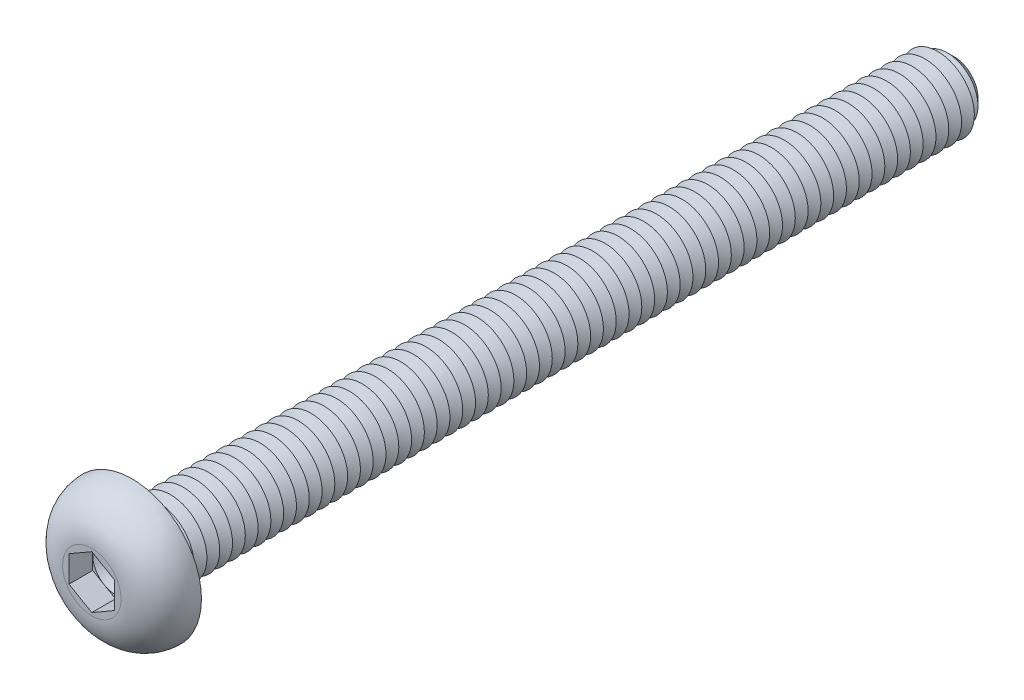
ISO-10303-21;
HEADER;
FILE_DESCRIPTION(('STEP AP214'),'2;1');
FILE_NAME('part.step','',(''),(''),'','','');
FILE_SCHEMA(('AUTOMOTIVE_DESIGN { 1 0 10303 214 1 1 1 1 }'));
ENDSEC;
DATA;
#1=APPLICATION_CONTEXT('core data for automotive mechanical design processes');
#2=APPLICATION_PROTOCOL_DEFINITION('international standard','automotive_design',2000,#1);
#3=PRODUCT_CONTEXT('',#1,'mechanical');
#4=PRODUCT('Part','Part','',(#3));
#5=PRODUCT_RELATED_PRODUCT_CATEGORY('part','',(#4));
#6=PRODUCT_DEFINITION_FORMATION('','',#4);
#7=PRODUCT_DEFINITION_CONTEXT('part definition',#1,'design');
#8=PRODUCT_DEFINITION('design','',#6,#7);
#9=PRODUCT_DEFINITION_SHAPE('','',#8);
#10=(LENGTH_UNIT() NAMED_UNIT(*) SI_UNIT(.MILLI.,.METRE.));
#11=(NAMED_UNIT(*) PLANE_ANGLE_UNIT() SI_UNIT($,.RADIAN.));
#12=(NAMED_UNIT(*) SI_UNIT($,.STERADIAN.) SOLID_ANGLE_UNIT());
#13=UNCERTAINTY_MEASURE_WITH_UNIT(LENGTH_MEASURE(1.E-05),#10,'distance_accuracy_value','');
#14=(GEOMETRIC_REPRESENTATION_CONTEXT(3) GLOBAL_UNCERTAINTY_ASSIGNED_CONTEXT((#13)) GLOBAL_UNIT_ASSIGNED_CONTEXT((#10,
#11,#12)) REPRESENTATION_CONTEXT('',''));
#15=CARTESIAN_POINT('',(0.,0.,0.));
#16=DIRECTION('',(0.,0.,1.));
#17=DIRECTION('',(1.,0.,0.));
#18=AXIS2_PLACEMENT_3D('',#15,#16,#17);
#19=CARTESIAN_POINT('',(0.,0.,0.900000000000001));
#20=DIRECTION('',(0.,0.,1.));
#21=DIRECTION('',(1.,0.,0.));
#22=AXIS2_PLACEMENT_3D('',#19,#20,#21);
#23=PLANE('',#22);
#24=CARTESIAN_POINT('',(0.,0.,0.900000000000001));
#25=DIRECTION('',(0.,0.,1.));
#26=DIRECTION('',(1.,0.,0.));
#27=AXIS2_PLACEMENT_3D('',#24,#25,#26);
#28=CIRCLE('',#27,1.25);
#29=CARTESIAN_POINT('',(1.25,0.,0.900000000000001));
#30=VERTEX_POINT('',#29);
#31=CARTESIAN_POINT('',(0.625,1.08253175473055,0.900000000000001));
#32=VERTEX_POINT('',#31);
#33=EDGE_CURVE('E117',#30,#32,#28,.T.);
#34=ORIENTED_EDGE('',*,*,#33,.F.);
#35=DIRECTION('',(0.,1.,0.));
#36=VECTOR('',#35,1.);
#37=CARTESIAN_POINT('',(1.25,-0.721687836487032,0.900000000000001));
#38=LINE('',#37,#36);
#39=CARTESIAN_POINT('',(1.25,0.721687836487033,0.900000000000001));
#40=VERTEX_POINT('',#39);
#41=EDGE_CURVE('E140',#30,#40,#38,.T.);
#42=ORIENTED_EDGE('',*,*,#41,.T.);
#43=DIRECTION('',(-0.866025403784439,0.5,0.));
#44=VECTOR('',#43,1.);
#45=CARTESIAN_POINT('',(1.25,0.721687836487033,0.900000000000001));
#46=LINE('',#45,#44);
#47=EDGE_CURVE('E135',#40,#32,#46,.T.);
#48=ORIENTED_EDGE('',*,*,#47,.T.);
#49=EDGE_LOOP('',(#34,#42,#48));
#50=FACE_BOUND('',#49,.T.);
#51=ADVANCED_FACE('F39',(#50),#23,.T.);
#52=CARTESIAN_POINT('',(0.,0.,0.900000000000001));
#53=DIRECTION('',(0.,0.,1.));
#54=DIRECTION('',(1.,0.,0.));
#55=AXIS2_PLACEMENT_3D('',#52,#53,#54);
#56=CIRCLE('',#55,1.25);
#57=CARTESIAN_POINT('',(-0.625,1.08253175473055,0.900000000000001));
#58=VERTEX_POINT('',#57);
#59=EDGE_CURVE('E11',#32,#58,#56,.T.);
#60=ORIENTED_EDGE('',*,*,#59,.F.);
#61=CARTESIAN_POINT('',(0.,1.44337567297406,0.900000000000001));
#62=VERTEX_POINT('',#61);
#63=EDGE_CURVE('E130',#32,#62,#46,.T.);
#64=ORIENTED_EDGE('',*,*,#63,.T.);
#65=DIRECTION('',(-0.866025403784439,-0.5,0.));
#66=VECTOR('',#65,1.);
#67=CARTESIAN_POINT('',(0.,1.44337567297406,0.900000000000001));
#68=LINE('',#67,#66);
#69=EDGE_CURVE('E132',#62,#58,#68,.T.);
#70=ORIENTED_EDGE('',*,*,#69,.T.);
#71=EDGE_LOOP('',(#60,#64,#70));
#72=FACE_BOUND('',#71,.T.);
#73=ADVANCED_FACE('F129',(#72),#23,.T.);
#74=CARTESIAN_POINT('',(-1.25,0.,0.900000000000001));
#75=VERTEX_POINT('',#74);
#76=EDGE_CURVE('E49',#58,#75,#56,.T.);
#77=ORIENTED_EDGE('',*,*,#76,.F.);
#78=CARTESIAN_POINT('',(-1.25,0.721687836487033,0.900000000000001));
#79=VERTEX_POINT('',#78);
#80=EDGE_CURVE('E143',#58,#79,#68,.T.);
#81=ORIENTED_EDGE('',*,*,#80,.T.);
#82=DIRECTION('',(0.,-1.,0.));
#83=VECTOR('',#82,1.);
#84=CARTESIAN_POINT('',(-1.25,0.721687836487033,0.900000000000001));
#85=LINE('',#84,#83);
#86=EDGE_CURVE('E154',#79,#75,#85,.T.);
#87=ORIENTED_EDGE('',*,*,#86,.T.);
#88=EDGE_LOOP('',(#77,#81,#87));
#89=FACE_BOUND('',#88,.T.);
#90=ADVANCED_FACE('F258',(#89),#23,.T.);
#91=CARTESIAN_POINT('',(-0.625,-1.08253175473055,0.900000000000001));
#92=VERTEX_POINT('',#91);
#93=EDGE_CURVE('E239',#75,#92,#56,.T.);
#94=ORIENTED_EDGE('',*,*,#93,.F.);
#95=CARTESIAN_POINT('',(-1.25,-0.721687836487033,0.900000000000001));
#96=VERTEX_POINT('',#95);
#97=EDGE_CURVE('E153',#75,#96,#85,.T.);
#98=ORIENTED_EDGE('',*,*,#97,.T.);
#99=DIRECTION('',(0.866025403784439,-0.5,0.));
#100=VECTOR('',#99,1.);
#101=CARTESIAN_POINT('',(-1.25,-0.721687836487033,0.900000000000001));
#102=LINE('',#101,#100);
#103=EDGE_CURVE('E159',#96,#92,#102,.T.);
#104=ORIENTED_EDGE('',*,*,#103,.T.);
#105=EDGE_LOOP('',(#94,#98,#104));
#106=FACE_BOUND('',#105,.T.);
#107=ADVANCED_FACE('F251',(#106),#23,.T.);
#108=CARTESIAN_POINT('',(0.625,-1.08253175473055,0.900000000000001));
#109=VERTEX_POINT('',#108);
#110=EDGE_CURVE('E56',#92,#109,#56,.T.);
#111=ORIENTED_EDGE('',*,*,#110,.F.);
#112=CARTESIAN_POINT('',(0.,-1.44337567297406,0.900000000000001));
#113=VERTEX_POINT('',#112);
#114=EDGE_CURVE('E158',#92,#113,#102,.T.);
#115=ORIENTED_EDGE('',*,*,#114,.T.);
#116=DIRECTION('',(0.866025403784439,0.5,0.));
#117=VECTOR('',#116,1.);
#118=CARTESIAN_POINT('',(0.,-1.44337567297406,0.900000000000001));
#119=LINE('',#118,#117);
#120=EDGE_CURVE('E163',#113,#109,#119,.T.);
#121=ORIENTED_EDGE('',*,*,#120,.T.);
#122=EDGE_LOOP('',(#111,#115,#121));
#123=FACE_BOUND('',#122,.T.);
#124=ADVANCED_FACE('F777',(#123),#23,.T.);
#125=CARTESIAN_POINT('',(0.,0.,-45.));
#126=DIRECTION('',(0.,0.,1.));
#127=DIRECTION('',(1.,0.,0.));
#128=AXIS2_PLACEMENT_3D('',#125,#126,#127);
#129=CYLINDRICAL_SURFACE('',#128,2.);
#130=CARTESIAN_POINT('',(0.,0.,-0.300000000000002));
#131=DIRECTION('',(0.,0.,1.));
#132=DIRECTION('',(1.,0.,0.));
#133=AXIS2_PLACEMENT_3D('',#130,#131,#132);
#134=CIRCLE('',#133,2.);
#135=CARTESIAN_POINT('',(2.,0.,-0.300000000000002));
#136=VERTEX_POINT('',#135);
#137=EDGE_CURVE('E221',#136,#136,#134,.F.);
#138=CARTESIAN_POINT('',(0.,0.,-0.699999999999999));
#139=DIRECTION('',(0.,0.,1.));
#140=DIRECTION('',(1.,0.,0.));
#141=AXIS2_PLACEMENT_3D('',#138,#139,#140);
#142=CIRCLE('',#141,2.);
#143=CARTESIAN_POINT('',(2.,0.,-0.699999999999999));
#144=VERTEX_POINT('',#143);
#145=EDGE_CURVE('E149',#144,#144,#142,.T.);
#146=CARTESIAN_POINT('',(2.,0.,-0.300000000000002));
#147=CARTESIAN_POINT('',(2.,0.,-0.304166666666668));
#148=CARTESIAN_POINT('',(2.,0.,-0.308333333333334));
#149=CARTESIAN_POINT('',(2.,0.,-0.316666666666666));
#150=CARTESIAN_POINT('',(2.,0.,-0.320833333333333));
#151=CARTESIAN_POINT('',(2.,0.,-0.329166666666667));
#152=CARTESIAN_POINT('',(2.,0.,-0.333333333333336));
#153=CARTESIAN_POINT('',(2.,0.,-0.341666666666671));
#154=CARTESIAN_POINT('',(2.,0.,-0.345833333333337));
#155=CARTESIAN_POINT('',(2.,0.,-0.354166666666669));
#156=CARTESIAN_POINT('',(2.,0.,-0.358333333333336));
#157=CARTESIAN_POINT('',(2.,0.,-0.366666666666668));
#158=CARTESIAN_POINT('',(2.,0.,-0.370833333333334));
#159=CARTESIAN_POINT('',(2.,0.,-0.379166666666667));
#160=CARTESIAN_POINT('',(2.,0.,-0.383333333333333));
#161=CARTESIAN_POINT('',(2.,0.,-0.391666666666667));
#162=CARTESIAN_POINT('',(2.,0.,-0.395833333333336));
#163=CARTESIAN_POINT('',(2.,0.,-0.404166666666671));
#164=CARTESIAN_POINT('',(2.,0.,-0.408333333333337));
#165=CARTESIAN_POINT('',(2.,0.,-0.416666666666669));
#166=CARTESIAN_POINT('',(2.,0.,-0.420833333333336));
#167=CARTESIAN_POINT('',(2.,0.,-0.429166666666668));
#168=CARTESIAN_POINT('',(2.,0.,-0.433333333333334));
#169=CARTESIAN_POINT('',(2.,0.,-0.441666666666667));
#170=CARTESIAN_POINT('',(2.,0.,-0.445833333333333));
#171=CARTESIAN_POINT('',(2.,0.,-0.454166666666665));
#172=CARTESIAN_POINT('',(2.,0.,-0.458333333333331));
#173=CARTESIAN_POINT('',(2.,0.,-0.466666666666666));
#174=CARTESIAN_POINT('',(2.,0.,-0.470833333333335));
#175=CARTESIAN_POINT('',(2.,0.,-0.479166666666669));
#176=CARTESIAN_POINT('',(2.,0.,-0.483333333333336));
#177=CARTESIAN_POINT('',(2.,0.,-0.491666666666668));
#178=CARTESIAN_POINT('',(2.,0.,-0.495833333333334));
#179=CARTESIAN_POINT('',(2.,0.,-0.504166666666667));
#180=CARTESIAN_POINT('',(2.,0.,-0.508333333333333));
#181=CARTESIAN_POINT('',(2.,0.,-0.516666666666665));
#182=CARTESIAN_POINT('',(2.,0.,-0.520833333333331));
#183=CARTESIAN_POINT('',(2.,0.,-0.529166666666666));
#184=CARTESIAN_POINT('',(2.,0.,-0.533333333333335));
#185=CARTESIAN_POINT('',(2.,0.,-0.541666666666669));
#186=CARTESIAN_POINT('',(2.,0.,-0.545833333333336));
#187=CARTESIAN_POINT('',(2.,0.,-0.554166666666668));
#188=CARTESIAN_POINT('',(2.,0.,-0.558333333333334));
#189=CARTESIAN_POINT('',(2.,0.,-0.566666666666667));
#190=CARTESIAN_POINT('',(2.,0.,-0.570833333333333));
#191=CARTESIAN_POINT('',(2.,0.,-0.579166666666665));
#192=CARTESIAN_POINT('',(2.,0.,-0.583333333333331));
#193=CARTESIAN_POINT('',(2.,0.,-0.591666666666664));
#194=CARTESIAN_POINT('',(2.,0.,-0.59583333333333));
#195=CARTESIAN_POINT('',(2.,0.,-0.604166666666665));
#196=CARTESIAN_POINT('',(2.,0.,-0.608333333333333));
#197=CARTESIAN_POINT('',(2.,0.,-0.616666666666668));
#198=CARTESIAN_POINT('',(2.,0.,-0.620833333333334));
#199=CARTESIAN_POINT('',(2.,0.,-0.629166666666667));
#200=CARTESIAN_POINT('',(2.,0.,-0.633333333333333));
#201=CARTESIAN_POINT('',(2.,0.,-0.641666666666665));
#202=CARTESIAN_POINT('',(2.,0.,-0.645833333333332));
#203=CARTESIAN_POINT('',(2.,0.,-0.654166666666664));
#204=CARTESIAN_POINT('',(2.,0.,-0.65833333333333));
#205=CARTESIAN_POINT('',(2.,0.,-0.666666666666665));
#206=CARTESIAN_POINT('',(2.,0.,-0.670833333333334));
#207=CARTESIAN_POINT('',(2.,0.,-0.679166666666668));
#208=CARTESIAN_POINT('',(2.,0.,-0.683333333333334));
#209=CARTESIAN_POINT('',(2.,0.,-0.691666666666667));
#210=CARTESIAN_POINT('',(2.,0.,-0.695833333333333));
#211=CARTESIAN_POINT('',(2.,0.,-0.699999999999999));
#212=B_SPLINE_CURVE_WITH_KNOTS('',3,(#146,#147,#148,#149,#150,#151,#152,#153,#154,#155,#156,
#157,#158,#159,#160,#161,#162,#163,#164,#165,#166,#167,#168,#169,#170,#171,#172,#173,#174,#175,
#176,#177,#178,#179,#180,#181,#182,#183,#184,#185,#186,#187,#188,#189,#190,#191,#192,#193,#194,
#195,#196,#197,#198,#199,#200,#201,#202,#203,#204,#205,#206,#207,#208,#209,#210,#211),
.UNSPECIFIED.,.F.,.F.,(4,2,2,2,2,2,2,2,2,2,2,2,2,2,2,2,2,2,2,2,2,2,2,2,2,2,2,2,2,2,2,2,4),(0.,
0.0124999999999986,0.0249999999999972,0.0375000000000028,0.0500000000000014,0.0625000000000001,
0.0749999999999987,0.0874999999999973,0.100000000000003,0.112500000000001,0.125,
0.137499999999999,0.149999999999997,0.162499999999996,0.175000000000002,0.1875,
0.199999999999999,0.212499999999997,0.224999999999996,0.237500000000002,0.25,0.262499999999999,
0.274999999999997,0.287499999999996,0.299999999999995,0.3125,0.324999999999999,
0.337499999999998,0.349999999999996,0.362499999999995,0.375,0.387499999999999,
0.399999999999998),.UNSPECIFIED.);
#213=EDGE_CURVE('BSEAM783',#136,#144,#212,.T.);
#214=ORIENTED_EDGE('',*,*,#137,.T.);
#215=ORIENTED_EDGE('',*,*,#145,.T.);
#216=ORIENTED_EDGE('',*,*,#213,.T.);
#217=ORIENTED_EDGE('',*,*,#213,.F.);
#218=EDGE_LOOP('',(#214,#216,#215,#217));
#219=FACE_BOUND('',#218,.T.);
#220=ADVANCED_FACE('F783',(#219),#129,.T.);
#221=CARTESIAN_POINT('',(0.,3.8,0.));
#222=DIRECTION('',(0.,0.,1.));
#223=DIRECTION('',(1.,0.,0.));
#224=AXIS2_PLACEMENT_3D('',#221,#222,#223);
#225=PLANE('',#224);
#226=CARTESIAN_POINT('',(0.,0.,0.));
#227=DIRECTION('',(0.,0.,1.));
#228=DIRECTION('',(1.,0.,0.));
#229=AXIS2_PLACEMENT_3D('',#226,#227,#228);
#230=CIRCLE('',#229,2.3);
#231=CARTESIAN_POINT('',(2.3,0.,0.));
#232=VERTEX_POINT('',#231);
#233=EDGE_CURVE('E230',#232,#232,#230,.T.);
#234=ORIENTED_EDGE('',*,*,#233,.T.);
#235=EDGE_LOOP('',(#234));
#236=FACE_BOUND('',#235,.T.);
#237=CARTESIAN_POINT('',(0.,0.,0.));
#238=DIRECTION('',(0.,0.,1.));
#239=DIRECTION('',(1.,0.,0.));
#240=AXIS2_PLACEMENT_3D('',#237,#238,#239);
#241=CIRCLE('',#240,3.8);
#242=CARTESIAN_POINT('',(3.8,0.,0.));
#243=VERTEX_POINT('',#242);
#244=EDGE_CURVE('E195',#243,#243,#241,.T.);
#245=ORIENTED_EDGE('',*,*,#244,.F.);
#246=EDGE_LOOP('',(#245));
#247=FACE_BOUND('',#246,.T.);
#248=ADVANCED_FACE('F788',(#236,#247),#225,.F.);
#249=CARTESIAN_POINT('',(0.,0.,2.2));
#250=DIRECTION('',(0.,0.,-1.));
#251=DIRECTION('',(-1.,0.,0.));
#252=AXIS2_PLACEMENT_3D('',#249,#250,#251);
#253=PLANE('',#252);
#254=DIRECTION('',(-0.866025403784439,-0.5,0.));
#255=VECTOR('',#254,1.);
#256=CARTESIAN_POINT('',(0.,1.44337567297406,2.2));
#257=LINE('',#256,#255);
#258=CARTESIAN_POINT('',(0.,1.44337567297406,2.2));
#259=VERTEX_POINT('',#258);
#260=CARTESIAN_POINT('',(-1.25,0.721687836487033,2.2));
#261=VERTEX_POINT('',#260);
#262=EDGE_CURVE('E173',#259,#261,#257,.T.);
#263=ORIENTED_EDGE('',*,*,#262,.F.);
#264=DIRECTION('',(-0.866025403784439,0.5,0.));
#265=VECTOR('',#264,1.);
#266=CARTESIAN_POINT('',(1.25,0.721687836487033,2.2));
#267=LINE('',#266,#265);
#268=CARTESIAN_POINT('',(1.25,0.721687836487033,2.2));
#269=VERTEX_POINT('',#268);
#270=EDGE_CURVE('E64',#269,#259,#267,.T.);
#271=ORIENTED_EDGE('',*,*,#270,.F.);
#272=DIRECTION('',(0.,1.,0.));
#273=VECTOR('',#272,1.);
#274=CARTESIAN_POINT('',(1.25,-0.721687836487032,2.2));
#275=LINE('',#274,#273);
#276=CARTESIAN_POINT('',(1.25,-0.721687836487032,2.2));
#277=VERTEX_POINT('',#276);
#278=EDGE_CURVE('E138',#277,#269,#275,.T.);
#279=ORIENTED_EDGE('',*,*,#278,.F.);
#280=DIRECTION('',(0.866025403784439,0.5,0.));
#281=VECTOR('',#280,1.);
#282=CARTESIAN_POINT('',(0.,-1.44337567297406,2.2));
#283=LINE('',#282,#281);
#284=CARTESIAN_POINT('',(0.,-1.44337567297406,2.2));
#285=VERTEX_POINT('',#284);
#286=EDGE_CURVE('E185',#285,#277,#283,.T.);
#287=ORIENTED_EDGE('',*,*,#286,.F.);
#288=DIRECTION('',(0.866025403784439,-0.5,0.));
#289=VECTOR('',#288,1.);
#290=CARTESIAN_POINT('',(-1.25,-0.721687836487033,2.2));
#291=LINE('',#290,#289);
#292=CARTESIAN_POINT('',(-1.25,-0.721687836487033,2.2));
#293=VERTEX_POINT('',#292);
#294=EDGE_CURVE('E181',#293,#285,#291,.T.);
#295=ORIENTED_EDGE('',*,*,#294,.F.);
#296=DIRECTION('',(0.,-1.,0.));
#297=VECTOR('',#296,1.);
#298=CARTESIAN_POINT('',(-1.25,0.721687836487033,2.2));
#299=LINE('',#298,#297);
#300=EDGE_CURVE('E177',#261,#293,#299,.T.);
#301=ORIENTED_EDGE('',*,*,#300,.F.);
#302=EDGE_LOOP('',(#263,#271,#279,#287,#295,#301));
#303=FACE_BOUND('',#302,.T.);
#304=CARTESIAN_POINT('',(0.,0.,2.2));
#305=DIRECTION('',(0.,0.,1.));
#306=DIRECTION('',(1.,0.,0.));
#307=AXIS2_PLACEMENT_3D('',#304,#305,#306);
#308=CIRCLE('',#307,1.6);
#309=CARTESIAN_POINT('',(1.6,0.,2.2));
#310=VERTEX_POINT('',#309);
#311=EDGE_CURVE('E213',#310,#310,#308,.T.);
#312=ORIENTED_EDGE('',*,*,#311,.T.);
#313=EDGE_LOOP('',(#312));
#314=FACE_BOUND('',#313,.T.);
#315=ADVANCED_FACE('F267',(#303,#314),#253,.F.);
#316=CARTESIAN_POINT('',(0.,0.,0.));
#317=DIRECTION('',(0.,0.,1.));
#318=DIRECTION('',(1.,0.,0.));
#319=AXIS2_PLACEMENT_3D('',#316,#317,#318);
#320=DEGENERATE_TOROIDAL_SURFACE('',#319,1.6,2.2,.T.);
#321=ORIENTED_EDGE('',*,*,#311,.F.);
#322=EDGE_LOOP('',(#321));
#323=FACE_BOUND('',#322,.T.);
#324=ORIENTED_EDGE('',*,*,#244,.T.);
#325=EDGE_LOOP('',(#324));
#326=FACE_BOUND('',#325,.T.);
#327=ADVANCED_FACE('F1782',(#323,#326),#320,.T.);
#328=CARTESIAN_POINT('',(1.25,0.721687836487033,0.900000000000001));
#329=DIRECTION('',(0.5,0.866025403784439,0.));
#330=DIRECTION('',(-0.866025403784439,0.5,0.));
#331=AXIS2_PLACEMENT_3D('',#328,#329,#330);
#332=PLANE('',#331);
#333=ORIENTED_EDGE('',*,*,#270,.T.);
#334=DIRECTION('',(0.,0.,1.));
#335=VECTOR('',#334,1.);
#336=CARTESIAN_POINT('',(0.,1.44337567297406,0.900000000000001));
#337=LINE('',#336,#335);
#338=EDGE_CURVE('E136',#62,#259,#337,.T.);
#339=ORIENTED_EDGE('',*,*,#338,.F.);
#340=ORIENTED_EDGE('',*,*,#63,.F.);
#341=ORIENTED_EDGE('',*,*,#47,.F.);
#342=DIRECTION('',(0.,0.,1.));
#343=VECTOR('',#342,1.);
#344=CARTESIAN_POINT('',(1.25,0.721687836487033,0.900000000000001));
#345=LINE('',#344,#343);
#346=EDGE_CURVE('E192',#40,#269,#345,.T.);
#347=ORIENTED_EDGE('',*,*,#346,.T.);
#348=EDGE_LOOP('',(#333,#339,#340,#341,#347));
#349=FACE_BOUND('',#348,.T.);
#350=ADVANCED_FACE('F134',(#349),#332,.F.);
#351=CARTESIAN_POINT('',(1.25,-0.721687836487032,0.900000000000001));
#352=DIRECTION('',(1.,0.,0.));
#353=DIRECTION('',(0.,1.,0.));
#354=AXIS2_PLACEMENT_3D('',#351,#352,#353);
#355=PLANE('',#354);
#356=ORIENTED_EDGE('',*,*,#278,.T.);
#357=ORIENTED_EDGE('',*,*,#346,.F.);
#358=ORIENTED_EDGE('',*,*,#41,.F.);
#359=CARTESIAN_POINT('',(1.25,-0.721687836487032,0.900000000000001));
#360=VERTEX_POINT('',#359);
#361=EDGE_CURVE('E167',#360,#30,#38,.T.);
#362=ORIENTED_EDGE('',*,*,#361,.F.);
#363=DIRECTION('',(0.,0.,1.));
#364=VECTOR('',#363,1.);
#365=CARTESIAN_POINT('',(1.25,-0.721687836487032,0.900000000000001));
#366=LINE('',#365,#364);
#367=EDGE_CURVE('E196',#360,#277,#366,.T.);
#368=ORIENTED_EDGE('',*,*,#367,.T.);
#369=EDGE_LOOP('',(#356,#357,#358,#362,#368));
#370=FACE_BOUND('',#369,.T.);
#371=ADVANCED_FACE('F797',(#370),#355,.F.);
#372=CARTESIAN_POINT('',(0.,-1.44337567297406,0.900000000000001));
#373=DIRECTION('',(0.5,-0.866025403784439,0.));
#374=DIRECTION('',(0.866025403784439,0.5,0.));
#375=AXIS2_PLACEMENT_3D('',#372,#373,#374);
#376=PLANE('',#375);
#377=ORIENTED_EDGE('',*,*,#286,.T.);
#378=ORIENTED_EDGE('',*,*,#367,.F.);
#379=EDGE_CURVE('E162',#109,#360,#119,.T.);
#380=ORIENTED_EDGE('',*,*,#379,.F.);
#381=ORIENTED_EDGE('',*,*,#120,.F.);
#382=DIRECTION('',(0.,0.,1.));
#383=VECTOR('',#382,1.);
#384=CARTESIAN_POINT('',(0.,-1.44337567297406,0.900000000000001));
#385=LINE('',#384,#383);
#386=EDGE_CURVE('E199',#113,#285,#385,.T.);
#387=ORIENTED_EDGE('',*,*,#386,.T.);
#388=EDGE_LOOP('',(#377,#378,#380,#381,#387));
#389=FACE_BOUND('',#388,.T.);
#390=ADVANCED_FACE('F792',(#389),#376,.F.);
#391=CARTESIAN_POINT('',(-1.25,-0.721687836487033,0.900000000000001));
#392=DIRECTION('',(-0.5,-0.866025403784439,0.));
#393=DIRECTION('',(0.866025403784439,-0.5,0.));
#394=AXIS2_PLACEMENT_3D('',#391,#392,#393);
#395=PLANE('',#394);
#396=ORIENTED_EDGE('',*,*,#294,.T.);
#397=ORIENTED_EDGE('',*,*,#386,.F.);
#398=ORIENTED_EDGE('',*,*,#114,.F.);
#399=ORIENTED_EDGE('',*,*,#103,.F.);
#400=DIRECTION('',(0.,0.,1.));
#401=VECTOR('',#400,1.);
#402=CARTESIAN_POINT('',(-1.25,-0.721687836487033,0.900000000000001));
#403=LINE('',#402,#401);
#404=EDGE_CURVE('E202',#96,#293,#403,.T.);
#405=ORIENTED_EDGE('',*,*,#404,.T.);
#406=EDGE_LOOP('',(#396,#397,#398,#399,#405));
#407=FACE_BOUND('',#406,.T.);
#408=ADVANCED_FACE('F272',(#407),#395,.F.);
#409=CARTESIAN_POINT('',(-1.25,0.721687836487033,0.900000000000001));
#410=DIRECTION('',(-1.,0.,0.));
#411=DIRECTION('',(0.,0.,1.));
#412=AXIS2_PLACEMENT_3D('',#409,#410,#411);
#413=PLANE('',#412);
#414=ORIENTED_EDGE('',*,*,#300,.T.);
#415=ORIENTED_EDGE('',*,*,#404,.F.);
#416=ORIENTED_EDGE('',*,*,#97,.F.);
#417=ORIENTED_EDGE('',*,*,#86,.F.);
#418=DIRECTION('',(0.,0.,1.));
#419=VECTOR('',#418,1.);
#420=CARTESIAN_POINT('',(-1.25,0.721687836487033,0.900000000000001));
#421=LINE('',#420,#419);
#422=EDGE_CURVE('E205',#79,#261,#421,.T.);
#423=ORIENTED_EDGE('',*,*,#422,.T.);
#424=EDGE_LOOP('',(#414,#415,#416,#417,#423));
#425=FACE_BOUND('',#424,.T.);
#426=ADVANCED_FACE('F256',(#425),#413,.F.);
#427=CARTESIAN_POINT('',(0.,1.44337567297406,0.900000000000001));
#428=DIRECTION('',(-0.5,0.866025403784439,0.));
#429=DIRECTION('',(-0.866025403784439,-0.5,0.));
#430=AXIS2_PLACEMENT_3D('',#427,#428,#429);
#431=PLANE('',#430);
#432=ORIENTED_EDGE('',*,*,#262,.T.);
#433=ORIENTED_EDGE('',*,*,#422,.F.);
#434=ORIENTED_EDGE('',*,*,#80,.F.);
#435=ORIENTED_EDGE('',*,*,#69,.F.);
#436=ORIENTED_EDGE('',*,*,#338,.T.);
#437=EDGE_LOOP('',(#432,#433,#434,#435,#436));
#438=FACE_BOUND('',#437,.T.);
#439=ADVANCED_FACE('F261',(#438),#431,.F.);
#440=EDGE_CURVE('E43',#109,#30,#56,.T.);
#441=ORIENTED_EDGE('',*,*,#440,.F.);
#442=ORIENTED_EDGE('',*,*,#379,.T.);
#443=ORIENTED_EDGE('',*,*,#361,.T.);
#444=EDGE_LOOP('',(#441,#442,#443));
#445=FACE_BOUND('',#444,.T.);
#446=ADVANCED_FACE('F766',(#445),#23,.T.);
#447=CARTESIAN_POINT('',(0.,0.,-0.699999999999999));
#448=DIRECTION('',(0.,0.,1.));
#449=DIRECTION('',(1.,0.,0.));
#450=AXIS2_PLACEMENT_3D('',#447,#448,#449);
#451=CONICAL_SURFACE('',#450,2.,1.04719755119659);
#452=CARTESIAN_POINT('',(0.,0.,-1.05));
#453=DIRECTION('',(0.,0.,1.));
#454=DIRECTION('',(1.,0.,0.));
#455=AXIS2_PLACEMENT_3D('',#452,#453,#454);
#456=CIRCLE('',#455,1.3937822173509);
#457=CARTESIAN_POINT('',(1.3937822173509,0.,-1.05));
#458=VERTEX_POINT('',#457);
#459=EDGE_CURVE('E315',#458,#458,#456,.T.);
#460=ORIENTED_EDGE('',*,*,#459,.T.);
#461=EDGE_LOOP('',(#460));
#462=FACE_BOUND('',#461,.T.);
#463=ORIENTED_EDGE('',*,*,#145,.F.);
#464=EDGE_LOOP('',(#463));
#465=FACE_BOUND('',#464,.T.);
#466=ADVANCED_FACE('F751',(#462,#465),#451,.T.);
#467=CARTESIAN_POINT('',(0.,0.,-1.05));
#468=DIRECTION('',(0.,0.,-1.));
#469=DIRECTION('',(-1.,0.,0.));
#470=AXIS2_PLACEMENT_3D('',#467,#468,#469);
#471=CONICAL_SURFACE('',#470,1.3937822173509,1.0471975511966);
#472=CARTESIAN_POINT('',(0.,0.,-1.4));
#473=DIRECTION('',(0.,0.,1.));
#474=DIRECTION('',(1.,0.,0.));
#475=AXIS2_PLACEMENT_3D('',#472,#473,#474);
#476=CIRCLE('',#475,2.);
#477=CARTESIAN_POINT('',(2.,0.,-1.4));
#478=VERTEX_POINT('',#477);
#479=EDGE_CURVE('E745',#478,#478,#476,.T.);
#480=ORIENTED_EDGE('',*,*,#479,.T.);
#481=EDGE_LOOP('',(#480));
#482=FACE_BOUND('',#481,.T.);
#483=ORIENTED_EDGE('',*,*,#459,.F.);
#484=EDGE_LOOP('',(#483));
#485=FACE_BOUND('',#484,.T.);
#486=ADVANCED_FACE('F754',(#482,#485),#471,.T.);
#487=CARTESIAN_POINT('',(0.,0.,-1.4));
#488=DIRECTION('',(0.,0.,1.));
#489=DIRECTION('',(1.,0.,0.));
#490=AXIS2_PLACEMENT_3D('',#487,#488,#489);
#491=CONICAL_SURFACE('',#490,2.,1.04719755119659);
#492=CARTESIAN_POINT('',(0.,0.,-1.75));
#493=DIRECTION('',(0.,0.,1.));
#494=DIRECTION('',(1.,0.,0.));
#495=AXIS2_PLACEMENT_3D('',#492,#493,#494);
#496=CIRCLE('',#495,1.3937822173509);
#497=CARTESIAN_POINT('',(1.3937822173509,0.,-1.75));
#498=VERTEX_POINT('',#497);
#499=EDGE_CURVE('E353',#498,#498,#496,.T.);
#500=ORIENTED_EDGE('',*,*,#499,.T.);
#501=EDGE_LOOP('',(#500));
#502=FACE_BOUND('',#501,.T.);
#503=ORIENTED_EDGE('',*,*,#479,.F.);
#504=EDGE_LOOP('',(#503));
#505=FACE_BOUND('',#504,.T.);
#506=ADVANCED_FACE('F756',(#502,#505),#491,.T.);
#507=CARTESIAN_POINT('',(0.,0.,-1.75));
#508=DIRECTION('',(0.,0.,-1.));
#509=DIRECTION('',(-1.,0.,0.));
#510=AXIS2_PLACEMENT_3D('',#507,#508,#509);
#511=CONICAL_SURFACE('',#510,1.3937822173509,1.0471975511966);
#512=CARTESIAN_POINT('',(0.,0.,-2.1));
#513=DIRECTION('',(0.,0.,1.));
#514=DIRECTION('',(1.,0.,0.));
#515=AXIS2_PLACEMENT_3D('',#512,#513,#514);
#516=CIRCLE('',#515,2.);
#517=CARTESIAN_POINT('',(2.,0.,-2.1));
#518=VERTEX_POINT('',#517);
#519=EDGE_CURVE('E350',#518,#518,#516,.T.);
#520=ORIENTED_EDGE('',*,*,#519,.T.);
#521=EDGE_LOOP('',(#520));
#522=FACE_BOUND('',#521,.T.);
#523=ORIENTED_EDGE('',*,*,#499,.F.);
#524=EDGE_LOOP('',(#523));
#525=FACE_BOUND('',#524,.T.);
#526=ADVANCED_FACE('F763',(#522,#525),#511,.T.);
#527=CARTESIAN_POINT('',(0.,0.,-2.1));
#528=DIRECTION('',(0.,0.,1.));
#529=DIRECTION('',(1.,0.,0.));
#530=AXIS2_PLACEMENT_3D('',#527,#528,#529);
#531=CONICAL_SURFACE('',#530,2.,1.04719755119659);
#532=CARTESIAN_POINT('',(0.,0.,-2.45));
#533=DIRECTION('',(0.,0.,1.));
#534=DIRECTION('',(1.,0.,0.));
#535=AXIS2_PLACEMENT_3D('',#532,#533,#534);
#536=CIRCLE('',#535,1.3937822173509);
#537=CARTESIAN_POINT('',(1.3937822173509,0.,-2.45));
#538=VERTEX_POINT('',#537);
#539=EDGE_CURVE('E354',#538,#538,#536,.T.);
#540=ORIENTED_EDGE('',*,*,#539,.T.);
#541=EDGE_LOOP('',(#540));
#542=FACE_BOUND('',#541,.T.);
#543=ORIENTED_EDGE('',*,*,#519,.F.);
#544=EDGE_LOOP('',(#543));
#545=FACE_BOUND('',#544,.T.);
#546=ADVANCED_FACE('F1315',(#542,#545),#531,.T.);
#547=CARTESIAN_POINT('',(0.,0.,-2.45));
#548=DIRECTION('',(0.,0.,-1.));
#549=DIRECTION('',(-1.,0.,0.));
#550=AXIS2_PLACEMENT_3D('',#547,#548,#549);
#551=CONICAL_SURFACE('',#550,1.3937822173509,1.0471975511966);
#552=CARTESIAN_POINT('',(0.,0.,-2.8));
#553=DIRECTION('',(0.,0.,1.));
#554=DIRECTION('',(1.,0.,0.));
#555=AXIS2_PLACEMENT_3D('',#552,#553,#554);
#556=CIRCLE('',#555,2.);
#557=CARTESIAN_POINT('',(2.,0.,-2.8));
#558=VERTEX_POINT('',#557);
#559=EDGE_CURVE('E735',#558,#558,#556,.T.);
#560=ORIENTED_EDGE('',*,*,#559,.T.);
#561=EDGE_LOOP('',(#560));
#562=FACE_BOUND('',#561,.T.);
#563=ORIENTED_EDGE('',*,*,#539,.F.);
#564=EDGE_LOOP('',(#563));
#565=FACE_BOUND('',#564,.T.);
#566=ADVANCED_FACE('F1311',(#562,#565),#551,.T.);
#567=CARTESIAN_POINT('',(0.,0.,-2.8));
#568=DIRECTION('',(0.,0.,1.));
#569=DIRECTION('',(1.,0.,0.));
#570=AXIS2_PLACEMENT_3D('',#567,#568,#569);
#571=CONICAL_SURFACE('',#570,2.,1.04719755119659);
#572=CARTESIAN_POINT('',(0.,0.,-3.15));
#573=DIRECTION('',(0.,0.,1.));
#574=DIRECTION('',(1.,0.,0.));
#575=AXIS2_PLACEMENT_3D('',#572,#573,#574);
#576=CIRCLE('',#575,1.3937822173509);
#577=CARTESIAN_POINT('',(1.3937822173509,0.,-3.15));
#578=VERTEX_POINT('',#577);
#579=EDGE_CURVE('E731',#578,#578,#576,.T.);
#580=ORIENTED_EDGE('',*,*,#579,.T.);
#581=EDGE_LOOP('',(#580));
#582=FACE_BOUND('',#581,.T.);
#583=ORIENTED_EDGE('',*,*,#559,.F.);
#584=EDGE_LOOP('',(#583));
#585=FACE_BOUND('',#584,.T.);
#586=ADVANCED_FACE('F1307',(#582,#585),#571,.T.);
#587=CARTESIAN_POINT('',(0.,0.,-3.15));
#588=DIRECTION('',(0.,0.,-1.));
#589=DIRECTION('',(-1.,0.,0.));
#590=AXIS2_PLACEMENT_3D('',#587,#588,#589);
#591=CONICAL_SURFACE('',#590,1.3937822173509,1.0471975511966);
#592=CARTESIAN_POINT('',(0.,0.,-3.5));
#593=DIRECTION('',(0.,0.,1.));
#594=DIRECTION('',(1.,0.,0.));
#595=AXIS2_PLACEMENT_3D('',#592,#593,#594);
#596=CIRCLE('',#595,2.);
#597=CARTESIAN_POINT('',(2.,0.,-3.5));
#598=VERTEX_POINT('',#597);
#599=EDGE_CURVE('E728',#598,#598,#596,.T.);
#600=ORIENTED_EDGE('',*,*,#599,.T.);
#601=EDGE_LOOP('',(#600));
#602=FACE_BOUND('',#601,.T.);
#603=ORIENTED_EDGE('',*,*,#579,.F.);
#604=EDGE_LOOP('',(#603));
#605=FACE_BOUND('',#604,.T.);
#606=ADVANCED_FACE('F1303',(#602,#605),#591,.T.);
#607=CARTESIAN_POINT('',(0.,0.,-3.5));
#608=DIRECTION('',(0.,0.,1.));
#609=DIRECTION('',(1.,0.,0.));
#610=AXIS2_PLACEMENT_3D('',#607,#608,#609);
#611=CONICAL_SURFACE('',#610,2.,1.04719755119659);
#612=CARTESIAN_POINT('',(0.,0.,-3.85));
#613=DIRECTION('',(0.,0.,1.));
#614=DIRECTION('',(1.,0.,0.));
#615=AXIS2_PLACEMENT_3D('',#612,#613,#614);
#616=CIRCLE('',#615,1.3937822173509);
#617=CARTESIAN_POINT('',(1.3937822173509,0.,-3.85));
#618=VERTEX_POINT('',#617);
#619=EDGE_CURVE('E359',#618,#618,#616,.T.);
#620=ORIENTED_EDGE('',*,*,#619,.T.);
#621=EDGE_LOOP('',(#620));
#622=FACE_BOUND('',#621,.T.);
#623=ORIENTED_EDGE('',*,*,#599,.F.);
#624=EDGE_LOOP('',(#623));
#625=FACE_BOUND('',#624,.T.);
#626=ADVANCED_FACE('F1299',(#622,#625),#611,.T.);
#627=CARTESIAN_POINT('',(0.,0.,-3.85));
#628=DIRECTION('',(0.,0.,-1.));
#629=DIRECTION('',(-1.,0.,0.));
#630=AXIS2_PLACEMENT_3D('',#627,#628,#629);
#631=CONICAL_SURFACE('',#630,1.3937822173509,1.0471975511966);
#632=CARTESIAN_POINT('',(0.,0.,-4.2));
#633=DIRECTION('',(0.,0.,1.));
#634=DIRECTION('',(1.,0.,0.));
#635=AXIS2_PLACEMENT_3D('',#632,#633,#634);
#636=CIRCLE('',#635,2.);
#637=CARTESIAN_POINT('',(2.,0.,-4.2));
#638=VERTEX_POINT('',#637);
#639=EDGE_CURVE('E356',#638,#638,#636,.T.);
#640=ORIENTED_EDGE('',*,*,#639,.T.);
#641=EDGE_LOOP('',(#640));
#642=FACE_BOUND('',#641,.T.);
#643=ORIENTED_EDGE('',*,*,#619,.F.);
#644=EDGE_LOOP('',(#643));
#645=FACE_BOUND('',#644,.T.);
#646=ADVANCED_FACE('F1295',(#642,#645),#631,.T.);
#647=CARTESIAN_POINT('',(0.,0.,-4.2));
#648=DIRECTION('',(0.,0.,1.));
#649=DIRECTION('',(1.,0.,0.));
#650=AXIS2_PLACEMENT_3D('',#647,#648,#649);
#651=CONICAL_SURFACE('',#650,2.,1.04719755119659);
#652=CARTESIAN_POINT('',(0.,0.,-4.55));
#653=DIRECTION('',(0.,0.,1.));
#654=DIRECTION('',(1.,0.,0.));
#655=AXIS2_PLACEMENT_3D('',#652,#653,#654);
#656=CIRCLE('',#655,1.3937822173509);
#657=CARTESIAN_POINT('',(1.3937822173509,0.,-4.55));
#658=VERTEX_POINT('',#657);
#659=EDGE_CURVE('E319',#658,#658,#656,.T.);
#660=ORIENTED_EDGE('',*,*,#659,.T.);
#661=EDGE_LOOP('',(#660));
#662=FACE_BOUND('',#661,.T.);
#663=ORIENTED_EDGE('',*,*,#639,.F.);
#664=EDGE_LOOP('',(#663));
#665=FACE_BOUND('',#664,.T.);
#666=ADVANCED_FACE('F1291',(#662,#665),#651,.T.);
#667=CARTESIAN_POINT('',(0.,0.,-4.55));
#668=DIRECTION('',(0.,0.,-1.));
#669=DIRECTION('',(-1.,0.,0.));
#670=AXIS2_PLACEMENT_3D('',#667,#668,#669);
#671=CONICAL_SURFACE('',#670,1.3937822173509,1.0471975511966);
#672=CARTESIAN_POINT('',(0.,0.,-4.9));
#673=DIRECTION('',(0.,0.,1.));
#674=DIRECTION('',(1.,0.,0.));
#675=AXIS2_PLACEMENT_3D('',#672,#673,#674);
#676=CIRCLE('',#675,2.);
#677=CARTESIAN_POINT('',(2.,0.,-4.9));
#678=VERTEX_POINT('',#677);
#679=EDGE_CURVE('E316',#678,#678,#676,.T.);
#680=ORIENTED_EDGE('',*,*,#679,.T.);
#681=EDGE_LOOP('',(#680));
#682=FACE_BOUND('',#681,.T.);
#683=ORIENTED_EDGE('',*,*,#659,.F.);
#684=EDGE_LOOP('',(#683));
#685=FACE_BOUND('',#684,.T.);
#686=ADVANCED_FACE('F1287',(#682,#685),#671,.T.);
#687=CARTESIAN_POINT('',(0.,0.,-4.9));
#688=DIRECTION('',(0.,0.,1.));
#689=DIRECTION('',(1.,0.,0.));
#690=AXIS2_PLACEMENT_3D('',#687,#688,#689);
#691=CONICAL_SURFACE('',#690,2.,1.04719755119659);
#692=CARTESIAN_POINT('',(0.,0.,-5.25));
#693=DIRECTION('',(0.,0.,1.));
#694=DIRECTION('',(1.,0.,0.));
#695=AXIS2_PLACEMENT_3D('',#692,#693,#694);
#696=CIRCLE('',#695,1.3937822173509);
#697=CARTESIAN_POINT('',(1.3937822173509,0.,-5.25));
#698=VERTEX_POINT('',#697);
#699=EDGE_CURVE('E320',#698,#698,#696,.T.);
#700=ORIENTED_EDGE('',*,*,#699,.T.);
#701=EDGE_LOOP('',(#700));
#702=FACE_BOUND('',#701,.T.);
#703=ORIENTED_EDGE('',*,*,#679,.F.);
#704=EDGE_LOOP('',(#703));
#705=FACE_BOUND('',#704,.T.);
#706=ADVANCED_FACE('F1283',(#702,#705),#691,.T.);
#707=CARTESIAN_POINT('',(0.,0.,-5.25));
#708=DIRECTION('',(0.,0.,-1.));
#709=DIRECTION('',(-1.,0.,0.));
#710=AXIS2_PLACEMENT_3D('',#707,#708,#709);
#711=CONICAL_SURFACE('',#710,1.3937822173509,1.0471975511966);
#712=CARTESIAN_POINT('',(0.,0.,-5.6));
#713=DIRECTION('',(0.,0.,1.));
#714=DIRECTION('',(1.,0.,0.));
#715=AXIS2_PLACEMENT_3D('',#712,#713,#714);
#716=CIRCLE('',#715,2.);
#717=CARTESIAN_POINT('',(2.,0.,-5.6));
#718=VERTEX_POINT('',#717);
#719=EDGE_CURVE('E715',#718,#718,#716,.T.);
#720=ORIENTED_EDGE('',*,*,#719,.T.);
#721=EDGE_LOOP('',(#720));
#722=FACE_BOUND('',#721,.T.);
#723=ORIENTED_EDGE('',*,*,#699,.F.);
#724=EDGE_LOOP('',(#723));
#725=FACE_BOUND('',#724,.T.);
#726=ADVANCED_FACE('F1279',(#722,#725),#711,.T.);
#727=CARTESIAN_POINT('',(0.,0.,-5.6));
#728=DIRECTION('',(0.,0.,1.));
#729=DIRECTION('',(1.,0.,0.));
#730=AXIS2_PLACEMENT_3D('',#727,#728,#729);
#731=CONICAL_SURFACE('',#730,2.,1.04719755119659);
#732=CARTESIAN_POINT('',(0.,0.,-5.95));
#733=DIRECTION('',(0.,0.,1.));
#734=DIRECTION('',(1.,0.,0.));
#735=AXIS2_PLACEMENT_3D('',#732,#733,#734);
#736=CIRCLE('',#735,1.3937822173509);
#737=CARTESIAN_POINT('',(1.3937822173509,0.,-5.95));
#738=VERTEX_POINT('',#737);
#739=EDGE_CURVE('E711',#738,#738,#736,.T.);
#740=ORIENTED_EDGE('',*,*,#739,.T.);
#741=EDGE_LOOP('',(#740));
#742=FACE_BOUND('',#741,.T.);
#743=ORIENTED_EDGE('',*,*,#719,.F.);
#744=EDGE_LOOP('',(#743));
#745=FACE_BOUND('',#744,.T.);
#746=ADVANCED_FACE('F1275',(#742,#745),#731,.T.);
#747=CARTESIAN_POINT('',(0.,0.,-5.95));
#748=DIRECTION('',(0.,0.,-1.));
#749=DIRECTION('',(-1.,0.,0.));
#750=AXIS2_PLACEMENT_3D('',#747,#748,#749);
#751=CONICAL_SURFACE('',#750,1.3937822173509,1.0471975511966);
#752=CARTESIAN_POINT('',(0.,0.,-6.3));
#753=DIRECTION('',(0.,0.,1.));
#754=DIRECTION('',(1.,0.,0.));
#755=AXIS2_PLACEMENT_3D('',#752,#753,#754);
#756=CIRCLE('',#755,2.);
#757=CARTESIAN_POINT('',(2.,0.,-6.3));
#758=VERTEX_POINT('',#757);
#759=EDGE_CURVE('E707',#758,#758,#756,.T.);
#760=ORIENTED_EDGE('',*,*,#759,.T.);
#761=EDGE_LOOP('',(#760));
#762=FACE_BOUND('',#761,.T.);
#763=ORIENTED_EDGE('',*,*,#739,.F.);
#764=EDGE_LOOP('',(#763));
#765=FACE_BOUND('',#764,.T.);
#766=ADVANCED_FACE('F1271',(#762,#765),#751,.T.);
#767=CARTESIAN_POINT('',(0.,0.,-6.3));
#768=DIRECTION('',(0.,0.,1.));
#769=DIRECTION('',(1.,0.,0.));
#770=AXIS2_PLACEMENT_3D('',#767,#768,#769);
#771=CONICAL_SURFACE('',#770,2.,1.04719755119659);
#772=CARTESIAN_POINT('',(0.,0.,-6.65));
#773=DIRECTION('',(0.,0.,1.));
#774=DIRECTION('',(1.,0.,0.));
#775=AXIS2_PLACEMENT_3D('',#772,#773,#774);
#776=CIRCLE('',#775,1.3937822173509);
#777=CARTESIAN_POINT('',(1.3937822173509,0.,-6.65));
#778=VERTEX_POINT('',#777);
#779=EDGE_CURVE('E364',#778,#778,#776,.T.);
#780=ORIENTED_EDGE('',*,*,#779,.T.);
#781=EDGE_LOOP('',(#780));
#782=FACE_BOUND('',#781,.T.);
#783=ORIENTED_EDGE('',*,*,#759,.F.);
#784=EDGE_LOOP('',(#783));
#785=FACE_BOUND('',#784,.T.);
#786=ADVANCED_FACE('F1267',(#782,#785),#771,.T.);
#787=CARTESIAN_POINT('',(0.,0.,-6.65));
#788=DIRECTION('',(0.,0.,-1.));
#789=DIRECTION('',(-1.,0.,0.));
#790=AXIS2_PLACEMENT_3D('',#787,#788,#789);
#791=CONICAL_SURFACE('',#790,1.3937822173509,1.0471975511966);
#792=CARTESIAN_POINT('',(0.,0.,-7.));
#793=DIRECTION('',(0.,0.,1.));
#794=DIRECTION('',(1.,0.,0.));
#795=AXIS2_PLACEMENT_3D('',#792,#793,#794);
#796=CIRCLE('',#795,2.);
#797=CARTESIAN_POINT('',(2.,0.,-7.));
#798=VERTEX_POINT('',#797);
#799=EDGE_CURVE('E361',#798,#798,#796,.T.);
#800=ORIENTED_EDGE('',*,*,#799,.T.);
#801=EDGE_LOOP('',(#800));
#802=FACE_BOUND('',#801,.T.);
#803=ORIENTED_EDGE('',*,*,#779,.F.);
#804=EDGE_LOOP('',(#803));
#805=FACE_BOUND('',#804,.T.);
#806=ADVANCED_FACE('F1263',(#802,#805),#791,.T.);
#807=CARTESIAN_POINT('',(0.,0.,-7.));
#808=DIRECTION('',(0.,0.,1.));
#809=DIRECTION('',(1.,0.,0.));
#810=AXIS2_PLACEMENT_3D('',#807,#808,#809);
#811=CONICAL_SURFACE('',#810,2.,1.04719755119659);
#812=CARTESIAN_POINT('',(0.,0.,-7.35));
#813=DIRECTION('',(0.,0.,1.));
#814=DIRECTION('',(1.,0.,0.));
#815=AXIS2_PLACEMENT_3D('',#812,#813,#814);
#816=CIRCLE('',#815,1.3937822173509);
#817=CARTESIAN_POINT('',(1.3937822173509,0.,-7.35));
#818=VERTEX_POINT('',#817);
#819=EDGE_CURVE('E365',#818,#818,#816,.T.);
#820=ORIENTED_EDGE('',*,*,#819,.T.);
#821=EDGE_LOOP('',(#820));
#822=FACE_BOUND('',#821,.T.);
#823=ORIENTED_EDGE('',*,*,#799,.F.);
#824=EDGE_LOOP('',(#823));
#825=FACE_BOUND('',#824,.T.);
#826=ADVANCED_FACE('F1259',(#822,#825),#811,.T.);
#827=CARTESIAN_POINT('',(0.,0.,-7.35));
#828=DIRECTION('',(0.,0.,-1.));
#829=DIRECTION('',(-1.,0.,0.));
#830=AXIS2_PLACEMENT_3D('',#827,#828,#829);
#831=CONICAL_SURFACE('',#830,1.3937822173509,1.0471975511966);
#832=CARTESIAN_POINT('',(0.,0.,-7.7));
#833=DIRECTION('',(0.,0.,1.));
#834=DIRECTION('',(1.,0.,0.));
#835=AXIS2_PLACEMENT_3D('',#832,#833,#834);
#836=CIRCLE('',#835,2.);
#837=CARTESIAN_POINT('',(2.,0.,-7.7));
#838=VERTEX_POINT('',#837);
#839=EDGE_CURVE('E325',#838,#838,#836,.T.);
#840=ORIENTED_EDGE('',*,*,#839,.T.);
#841=EDGE_LOOP('',(#840));
#842=FACE_BOUND('',#841,.T.);
#843=ORIENTED_EDGE('',*,*,#819,.F.);
#844=EDGE_LOOP('',(#843));
#845=FACE_BOUND('',#844,.T.);
#846=ADVANCED_FACE('F1255',(#842,#845),#831,.T.);
#847=CARTESIAN_POINT('',(0.,0.,-7.7));
#848=DIRECTION('',(0.,0.,1.));
#849=DIRECTION('',(1.,0.,0.));
#850=AXIS2_PLACEMENT_3D('',#847,#848,#849);
#851=CONICAL_SURFACE('',#850,2.,1.04719755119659);
#852=CARTESIAN_POINT('',(0.,0.,-8.05));
#853=DIRECTION('',(0.,0.,1.));
#854=DIRECTION('',(1.,0.,0.));
#855=AXIS2_PLACEMENT_3D('',#852,#853,#854);
#856=CIRCLE('',#855,1.3937822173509);
#857=CARTESIAN_POINT('',(1.3937822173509,0.,-8.05));
#858=VERTEX_POINT('',#857);
#859=EDGE_CURVE('E322',#858,#858,#856,.T.);
#860=ORIENTED_EDGE('',*,*,#859,.T.);
#861=EDGE_LOOP('',(#860));
#862=FACE_BOUND('',#861,.T.);
#863=ORIENTED_EDGE('',*,*,#839,.F.);
#864=EDGE_LOOP('',(#863));
#865=FACE_BOUND('',#864,.T.);
#866=ADVANCED_FACE('F1251',(#862,#865),#851,.T.);
#867=CARTESIAN_POINT('',(0.,0.,-8.05));
#868=DIRECTION('',(0.,0.,-1.));
#869=DIRECTION('',(-1.,0.,0.));
#870=AXIS2_PLACEMENT_3D('',#867,#868,#869);
#871=CONICAL_SURFACE('',#870,1.3937822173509,1.0471975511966);
#872=CARTESIAN_POINT('',(0.,0.,-8.4));
#873=DIRECTION('',(0.,0.,1.));
#874=DIRECTION('',(1.,0.,0.));
#875=AXIS2_PLACEMENT_3D('',#872,#873,#874);
#876=CIRCLE('',#875,2.);
#877=CARTESIAN_POINT('',(2.,0.,-8.4));
#878=VERTEX_POINT('',#877);
#879=EDGE_CURVE('E326',#878,#878,#876,.T.);
#880=ORIENTED_EDGE('',*,*,#879,.T.);
#881=EDGE_LOOP('',(#880));
#882=FACE_BOUND('',#881,.T.);
#883=ORIENTED_EDGE('',*,*,#859,.F.);
#884=EDGE_LOOP('',(#883));
#885=FACE_BOUND('',#884,.T.);
#886=ADVANCED_FACE('F1247',(#882,#885),#871,.T.);
#887=CARTESIAN_POINT('',(0.,0.,-8.4));
#888=DIRECTION('',(0.,0.,1.));
#889=DIRECTION('',(1.,0.,0.));
#890=AXIS2_PLACEMENT_3D('',#887,#888,#889);
#891=CONICAL_SURFACE('',#890,2.,1.04719755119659);
#892=CARTESIAN_POINT('',(0.,0.,-8.75));
#893=DIRECTION('',(0.,0.,1.));
#894=DIRECTION('',(1.,0.,0.));
#895=AXIS2_PLACEMENT_3D('',#892,#893,#894);
#896=CIRCLE('',#895,1.3937822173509);
#897=CARTESIAN_POINT('',(1.3937822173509,0.,-8.75));
#898=VERTEX_POINT('',#897);
#899=EDGE_CURVE('E330',#898,#898,#896,.T.);
#900=ORIENTED_EDGE('',*,*,#899,.T.);
#901=EDGE_LOOP('',(#900));
#902=FACE_BOUND('',#901,.T.);
#903=ORIENTED_EDGE('',*,*,#879,.F.);
#904=EDGE_LOOP('',(#903));
#905=FACE_BOUND('',#904,.T.);
#906=ADVANCED_FACE('F1243',(#902,#905),#891,.T.);
#907=CARTESIAN_POINT('',(0.,0.,-8.75));
#908=DIRECTION('',(0.,0.,-1.));
#909=DIRECTION('',(-1.,0.,0.));
#910=AXIS2_PLACEMENT_3D('',#907,#908,#909);
#911=CONICAL_SURFACE('',#910,1.3937822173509,1.0471975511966);
#912=CARTESIAN_POINT('',(0.,0.,-9.1));
#913=DIRECTION('',(0.,0.,1.));
#914=DIRECTION('',(1.,0.,0.));
#915=AXIS2_PLACEMENT_3D('',#912,#913,#914);
#916=CIRCLE('',#915,2.);
#917=CARTESIAN_POINT('',(2.,0.,-9.1));
#918=VERTEX_POINT('',#917);
#919=EDGE_CURVE('E369',#918,#918,#916,.T.);
#920=ORIENTED_EDGE('',*,*,#919,.T.);
#921=EDGE_LOOP('',(#920));
#922=FACE_BOUND('',#921,.T.);
#923=ORIENTED_EDGE('',*,*,#899,.F.);
#924=EDGE_LOOP('',(#923));
#925=FACE_BOUND('',#924,.T.);
#926=ADVANCED_FACE('F1239',(#922,#925),#911,.T.);
#927=CARTESIAN_POINT('',(0.,0.,-9.1));
#928=DIRECTION('',(0.,0.,1.));
#929=DIRECTION('',(1.,0.,0.));
#930=AXIS2_PLACEMENT_3D('',#927,#928,#929);
#931=CONICAL_SURFACE('',#930,2.,1.04719755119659);
#932=CARTESIAN_POINT('',(0.,0.,-9.45));
#933=DIRECTION('',(0.,0.,1.));
#934=DIRECTION('',(1.,0.,0.));
#935=AXIS2_PLACEMENT_3D('',#932,#933,#934);
#936=CIRCLE('',#935,1.3937822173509);
#937=CARTESIAN_POINT('',(1.3937822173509,0.,-9.45));
#938=VERTEX_POINT('',#937);
#939=EDGE_CURVE('E694',#938,#938,#936,.T.);
#940=ORIENTED_EDGE('',*,*,#939,.T.);
#941=EDGE_LOOP('',(#940));
#942=FACE_BOUND('',#941,.T.);
#943=ORIENTED_EDGE('',*,*,#919,.F.);
#944=EDGE_LOOP('',(#943));
#945=FACE_BOUND('',#944,.T.);
#946=ADVANCED_FACE('F1235',(#942,#945),#931,.T.);
#947=CARTESIAN_POINT('',(0.,0.,-9.45));
#948=DIRECTION('',(0.,0.,-1.));
#949=DIRECTION('',(-1.,0.,0.));
#950=AXIS2_PLACEMENT_3D('',#947,#948,#949);
#951=CONICAL_SURFACE('',#950,1.3937822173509,1.0471975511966);
#952=CARTESIAN_POINT('',(0.,0.,-9.8));
#953=DIRECTION('',(0.,0.,1.));
#954=DIRECTION('',(1.,0.,0.));
#955=AXIS2_PLACEMENT_3D('',#952,#953,#954);
#956=CIRCLE('',#955,2.);
#957=CARTESIAN_POINT('',(2.,0.,-9.8));
#958=VERTEX_POINT('',#957);
#959=EDGE_CURVE('E690',#958,#958,#956,.T.);
#960=ORIENTED_EDGE('',*,*,#959,.T.);
#961=EDGE_LOOP('',(#960));
#962=FACE_BOUND('',#961,.T.);
#963=ORIENTED_EDGE('',*,*,#939,.F.);
#964=EDGE_LOOP('',(#963));
#965=FACE_BOUND('',#964,.T.);
#966=ADVANCED_FACE('F1231',(#962,#965),#951,.T.);
#967=CARTESIAN_POINT('',(0.,0.,-9.8));
#968=DIRECTION('',(0.,0.,1.));
#969=DIRECTION('',(1.,0.,0.));
#970=AXIS2_PLACEMENT_3D('',#967,#968,#969);
#971=CONICAL_SURFACE('',#970,2.,1.04719755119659);
#972=CARTESIAN_POINT('',(0.,0.,-10.15));
#973=DIRECTION('',(0.,0.,1.));
#974=DIRECTION('',(1.,0.,0.));
#975=AXIS2_PLACEMENT_3D('',#972,#973,#974);
#976=CIRCLE('',#975,1.3937822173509);
#977=CARTESIAN_POINT('',(1.3937822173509,0.,-10.15));
#978=VERTEX_POINT('',#977);
#979=EDGE_CURVE('E686',#978,#978,#976,.T.);
#980=ORIENTED_EDGE('',*,*,#979,.T.);
#981=EDGE_LOOP('',(#980));
#982=FACE_BOUND('',#981,.T.);
#983=ORIENTED_EDGE('',*,*,#959,.F.);
#984=EDGE_LOOP('',(#983));
#985=FACE_BOUND('',#984,.T.);
#986=ADVANCED_FACE('F1227',(#982,#985),#971,.T.);
#987=CARTESIAN_POINT('',(0.,0.,-10.15));
#988=DIRECTION('',(0.,0.,-1.));
#989=DIRECTION('',(-1.,0.,0.));
#990=AXIS2_PLACEMENT_3D('',#987,#988,#989);
#991=CONICAL_SURFACE('',#990,1.3937822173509,1.0471975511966);
#992=CARTESIAN_POINT('',(0.,0.,-10.5));
#993=DIRECTION('',(0.,0.,1.));
#994=DIRECTION('',(1.,0.,0.));
#995=AXIS2_PLACEMENT_3D('',#992,#993,#994);
#996=CIRCLE('',#995,2.);
#997=CARTESIAN_POINT('',(2.,0.,-10.5));
#998=VERTEX_POINT('',#997);
#999=EDGE_CURVE('E682',#998,#998,#996,.T.);
#1000=ORIENTED_EDGE('',*,*,#999,.T.);
#1001=EDGE_LOOP('',(#1000));
#1002=FACE_BOUND('',#1001,.T.);
#1003=ORIENTED_EDGE('',*,*,#979,.F.);
#1004=EDGE_LOOP('',(#1003));
#1005=FACE_BOUND('',#1004,.T.);
#1006=ADVANCED_FACE('F1223',(#1002,#1005),#991,.T.);
#1007=CARTESIAN_POINT('',(0.,0.,-10.5));
#1008=DIRECTION('',(0.,0.,1.));
#1009=DIRECTION('',(1.,0.,0.));
#1010=AXIS2_PLACEMENT_3D('',#1007,#1008,#1009);
#1011=CONICAL_SURFACE('',#1010,2.,1.04719755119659);
#1012=CARTESIAN_POINT('',(0.,0.,-10.85));
#1013=DIRECTION('',(0.,0.,1.));
#1014=DIRECTION('',(1.,0.,0.));
#1015=AXIS2_PLACEMENT_3D('',#1012,#1013,#1014);
#1016=CIRCLE('',#1015,1.3937822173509);
#1017=CARTESIAN_POINT('',(1.3937822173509,0.,-10.85));
#1018=VERTEX_POINT('',#1017);
#1019=EDGE_CURVE('E678',#1018,#1018,#1016,.T.);
#1020=ORIENTED_EDGE('',*,*,#1019,.T.);
#1021=EDGE_LOOP('',(#1020));
#1022=FACE_BOUND('',#1021,.T.);
#1023=ORIENTED_EDGE('',*,*,#999,.F.);
#1024=EDGE_LOOP('',(#1023));
#1025=FACE_BOUND('',#1024,.T.);
#1026=ADVANCED_FACE('F1219',(#1022,#1025),#1011,.T.);
#1027=CARTESIAN_POINT('',(0.,0.,-10.85));
#1028=DIRECTION('',(0.,0.,-1.));
#1029=DIRECTION('',(-1.,0.,0.));
#1030=AXIS2_PLACEMENT_3D('',#1027,#1028,#1029);
#1031=CONICAL_SURFACE('',#1030,1.3937822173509,1.0471975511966);
#1032=CARTESIAN_POINT('',(0.,0.,-11.2));
#1033=DIRECTION('',(0.,0.,1.));
#1034=DIRECTION('',(1.,0.,0.));
#1035=AXIS2_PLACEMENT_3D('',#1032,#1033,#1034);
#1036=CIRCLE('',#1035,2.);
#1037=CARTESIAN_POINT('',(2.,0.,-11.2));
#1038=VERTEX_POINT('',#1037);
#1039=EDGE_CURVE('E280',#1038,#1038,#1036,.T.);
#1040=ORIENTED_EDGE('',*,*,#1039,.T.);
#1041=EDGE_LOOP('',(#1040));
#1042=FACE_BOUND('',#1041,.T.);
#1043=ORIENTED_EDGE('',*,*,#1019,.F.);
#1044=EDGE_LOOP('',(#1043));
#1045=FACE_BOUND('',#1044,.T.);
#1046=ADVANCED_FACE('F1215',(#1042,#1045),#1031,.T.);
#1047=CARTESIAN_POINT('',(0.,0.,-11.2));
#1048=DIRECTION('',(0.,0.,1.));
#1049=DIRECTION('',(1.,0.,0.));
#1050=AXIS2_PLACEMENT_3D('',#1047,#1048,#1049);
#1051=CONICAL_SURFACE('',#1050,2.,1.04719755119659);
#1052=CARTESIAN_POINT('',(0.,0.,-11.55));
#1053=DIRECTION('',(0.,0.,1.));
#1054=DIRECTION('',(1.,0.,0.));
#1055=AXIS2_PLACEMENT_3D('',#1052,#1053,#1054);
#1056=CIRCLE('',#1055,1.3937822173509);
#1057=CARTESIAN_POINT('',(1.3937822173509,0.,-11.55));
#1058=VERTEX_POINT('',#1057);
#1059=EDGE_CURVE('E277',#1058,#1058,#1056,.T.);
#1060=ORIENTED_EDGE('',*,*,#1059,.T.);
#1061=EDGE_LOOP('',(#1060));
#1062=FACE_BOUND('',#1061,.T.);
#1063=ORIENTED_EDGE('',*,*,#1039,.F.);
#1064=EDGE_LOOP('',(#1063));
#1065=FACE_BOUND('',#1064,.T.);
#1066=ADVANCED_FACE('F1211',(#1062,#1065),#1051,.T.);
#1067=CARTESIAN_POINT('',(0.,0.,-11.55));
#1068=DIRECTION('',(0.,0.,-1.));
#1069=DIRECTION('',(-1.,0.,0.));
#1070=AXIS2_PLACEMENT_3D('',#1067,#1068,#1069);
#1071=CONICAL_SURFACE('',#1070,1.3937822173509,1.0471975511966);
#1072=CARTESIAN_POINT('',(0.,0.,-11.9));
#1073=DIRECTION('',(0.,0.,1.));
#1074=DIRECTION('',(1.,0.,0.));
#1075=AXIS2_PLACEMENT_3D('',#1072,#1073,#1074);
#1076=CIRCLE('',#1075,2.);
#1077=CARTESIAN_POINT('',(2.,0.,-11.9));
#1078=VERTEX_POINT('',#1077);
#1079=EDGE_CURVE('E281',#1078,#1078,#1076,.T.);
#1080=ORIENTED_EDGE('',*,*,#1079,.T.);
#1081=EDGE_LOOP('',(#1080));
#1082=FACE_BOUND('',#1081,.T.);
#1083=ORIENTED_EDGE('',*,*,#1059,.F.);
#1084=EDGE_LOOP('',(#1083));
#1085=FACE_BOUND('',#1084,.T.);
#1086=ADVANCED_FACE('F1207',(#1082,#1085),#1071,.T.);
#1087=CARTESIAN_POINT('',(0.,0.,-11.9));
#1088=DIRECTION('',(0.,0.,1.));
#1089=DIRECTION('',(1.,0.,0.));
#1090=AXIS2_PLACEMENT_3D('',#1087,#1088,#1089);
#1091=CONICAL_SURFACE('',#1090,2.,1.04719755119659);
#1092=CARTESIAN_POINT('',(0.,0.,-12.25));
#1093=DIRECTION('',(0.,0.,1.));
#1094=DIRECTION('',(1.,0.,0.));
#1095=AXIS2_PLACEMENT_3D('',#1092,#1093,#1094);
#1096=CIRCLE('',#1095,1.3937822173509);
#1097=CARTESIAN_POINT('',(1.3937822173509,0.,-12.25));
#1098=VERTEX_POINT('',#1097);
#1099=EDGE_CURVE('E668',#1098,#1098,#1096,.T.);
#1100=ORIENTED_EDGE('',*,*,#1099,.T.);
#1101=EDGE_LOOP('',(#1100));
#1102=FACE_BOUND('',#1101,.T.);
#1103=ORIENTED_EDGE('',*,*,#1079,.F.);
#1104=EDGE_LOOP('',(#1103));
#1105=FACE_BOUND('',#1104,.T.);
#1106=ADVANCED_FACE('F1203',(#1102,#1105),#1091,.T.);
#1107=CARTESIAN_POINT('',(0.,0.,-12.25));
#1108=DIRECTION('',(0.,0.,-1.));
#1109=DIRECTION('',(-1.,0.,0.));
#1110=AXIS2_PLACEMENT_3D('',#1107,#1108,#1109);
#1111=CONICAL_SURFACE('',#1110,1.3937822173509,1.0471975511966);
#1112=CARTESIAN_POINT('',(0.,0.,-12.6));
#1113=DIRECTION('',(0.,0.,1.));
#1114=DIRECTION('',(1.,0.,0.));
#1115=AXIS2_PLACEMENT_3D('',#1112,#1113,#1114);
#1116=CIRCLE('',#1115,2.);
#1117=CARTESIAN_POINT('',(2.,0.,-12.6));
#1118=VERTEX_POINT('',#1117);
#1119=EDGE_CURVE('E664',#1118,#1118,#1116,.T.);
#1120=ORIENTED_EDGE('',*,*,#1119,.T.);
#1121=EDGE_LOOP('',(#1120));
#1122=FACE_BOUND('',#1121,.T.);
#1123=ORIENTED_EDGE('',*,*,#1099,.F.);
#1124=EDGE_LOOP('',(#1123));
#1125=FACE_BOUND('',#1124,.T.);
#1126=ADVANCED_FACE('F1199',(#1122,#1125),#1111,.T.);
#1127=CARTESIAN_POINT('',(0.,0.,-12.6));
#1128=DIRECTION('',(0.,0.,1.));
#1129=DIRECTION('',(1.,0.,0.));
#1130=AXIS2_PLACEMENT_3D('',#1127,#1128,#1129);
#1131=CONICAL_SURFACE('',#1130,2.,1.04719755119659);
#1132=CARTESIAN_POINT('',(0.,0.,-12.95));
#1133=DIRECTION('',(0.,0.,1.));
#1134=DIRECTION('',(1.,0.,0.));
#1135=AXIS2_PLACEMENT_3D('',#1132,#1133,#1134);
#1136=CIRCLE('',#1135,1.3937822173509);
#1137=CARTESIAN_POINT('',(1.3937822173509,0.,-12.95));
#1138=VERTEX_POINT('',#1137);
#1139=EDGE_CURVE('E286',#1138,#1138,#1136,.T.);
#1140=ORIENTED_EDGE('',*,*,#1139,.T.);
#1141=EDGE_LOOP('',(#1140));
#1142=FACE_BOUND('',#1141,.T.);
#1143=ORIENTED_EDGE('',*,*,#1119,.F.);
#1144=EDGE_LOOP('',(#1143));
#1145=FACE_BOUND('',#1144,.T.);
#1146=ADVANCED_FACE('F1195',(#1142,#1145),#1131,.T.);
#1147=CARTESIAN_POINT('',(0.,0.,-12.95));
#1148=DIRECTION('',(0.,0.,-1.));
#1149=DIRECTION('',(-1.,0.,0.));
#1150=AXIS2_PLACEMENT_3D('',#1147,#1148,#1149);
#1151=CONICAL_SURFACE('',#1150,1.3937822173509,1.0471975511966);
#1152=CARTESIAN_POINT('',(0.,0.,-13.3));
#1153=DIRECTION('',(0.,0.,1.));
#1154=DIRECTION('',(1.,0.,0.));
#1155=AXIS2_PLACEMENT_3D('',#1152,#1153,#1154);
#1156=CIRCLE('',#1155,2.);
#1157=CARTESIAN_POINT('',(2.,0.,-13.3));
#1158=VERTEX_POINT('',#1157);
#1159=EDGE_CURVE('E283',#1158,#1158,#1156,.T.);
#1160=ORIENTED_EDGE('',*,*,#1159,.T.);
#1161=EDGE_LOOP('',(#1160));
#1162=FACE_BOUND('',#1161,.T.);
#1163=ORIENTED_EDGE('',*,*,#1139,.F.);
#1164=EDGE_LOOP('',(#1163));
#1165=FACE_BOUND('',#1164,.T.);
#1166=ADVANCED_FACE('F1191',(#1162,#1165),#1151,.T.);
#1167=CARTESIAN_POINT('',(0.,0.,-13.3));
#1168=DIRECTION('',(0.,0.,1.));
#1169=DIRECTION('',(1.,0.,0.));
#1170=AXIS2_PLACEMENT_3D('',#1167,#1168,#1169);
#1171=CONICAL_SURFACE('',#1170,2.,1.04719755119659);
#1172=CARTESIAN_POINT('',(0.,0.,-13.65));
#1173=DIRECTION('',(0.,0.,1.));
#1174=DIRECTION('',(1.,0.,0.));
#1175=AXIS2_PLACEMENT_3D('',#1172,#1173,#1174);
#1176=CIRCLE('',#1175,1.3937822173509);
#1177=CARTESIAN_POINT('',(1.3937822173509,0.,-13.65));
#1178=VERTEX_POINT('',#1177);
#1179=EDGE_CURVE('E287',#1178,#1178,#1176,.T.);
#1180=ORIENTED_EDGE('',*,*,#1179,.T.);
#1181=EDGE_LOOP('',(#1180));
#1182=FACE_BOUND('',#1181,.T.);
#1183=ORIENTED_EDGE('',*,*,#1159,.F.);
#1184=EDGE_LOOP('',(#1183));
#1185=FACE_BOUND('',#1184,.T.);
#1186=ADVANCED_FACE('F1187',(#1182,#1185),#1171,.T.);
#1187=CARTESIAN_POINT('',(0.,0.,-13.65));
#1188=DIRECTION('',(0.,0.,-1.));
#1189=DIRECTION('',(-1.,0.,0.));
#1190=AXIS2_PLACEMENT_3D('',#1187,#1188,#1189);
#1191=CONICAL_SURFACE('',#1190,1.3937822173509,1.0471975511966);
#1192=CARTESIAN_POINT('',(0.,0.,-14.));
#1193=DIRECTION('',(0.,0.,1.));
#1194=DIRECTION('',(1.,0.,0.));
#1195=AXIS2_PLACEMENT_3D('',#1192,#1193,#1194);
#1196=CIRCLE('',#1195,2.);
#1197=CARTESIAN_POINT('',(2.,0.,-14.));
#1198=VERTEX_POINT('',#1197);
#1199=EDGE_CURVE('E654',#1198,#1198,#1196,.T.);
#1200=ORIENTED_EDGE('',*,*,#1199,.T.);
#1201=EDGE_LOOP('',(#1200));
#1202=FACE_BOUND('',#1201,.T.);
#1203=ORIENTED_EDGE('',*,*,#1179,.F.);
#1204=EDGE_LOOP('',(#1203));
#1205=FACE_BOUND('',#1204,.T.);
#1206=ADVANCED_FACE('F1183',(#1202,#1205),#1191,.T.);
#1207=CARTESIAN_POINT('',(0.,0.,-14.));
#1208=DIRECTION('',(0.,0.,1.));
#1209=DIRECTION('',(1.,0.,0.));
#1210=AXIS2_PLACEMENT_3D('',#1207,#1208,#1209);
#1211=CONICAL_SURFACE('',#1210,2.,1.04719755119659);
#1212=CARTESIAN_POINT('',(0.,0.,-14.35));
#1213=DIRECTION('',(0.,0.,1.));
#1214=DIRECTION('',(1.,0.,0.));
#1215=AXIS2_PLACEMENT_3D('',#1212,#1213,#1214);
#1216=CIRCLE('',#1215,1.3937822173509);
#1217=CARTESIAN_POINT('',(1.3937822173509,0.,-14.35));
#1218=VERTEX_POINT('',#1217);
#1219=EDGE_CURVE('E374',#1218,#1218,#1216,.T.);
#1220=ORIENTED_EDGE('',*,*,#1219,.T.);
#1221=EDGE_LOOP('',(#1220));
#1222=FACE_BOUND('',#1221,.T.);
#1223=ORIENTED_EDGE('',*,*,#1199,.F.);
#1224=EDGE_LOOP('',(#1223));
#1225=FACE_BOUND('',#1224,.T.);
#1226=ADVANCED_FACE('F1179',(#1222,#1225),#1211,.T.);
#1227=CARTESIAN_POINT('',(0.,0.,-14.35));
#1228=DIRECTION('',(0.,0.,-1.));
#1229=DIRECTION('',(-1.,0.,0.));
#1230=AXIS2_PLACEMENT_3D('',#1227,#1228,#1229);
#1231=CONICAL_SURFACE('',#1230,1.3937822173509,1.0471975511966);
#1232=CARTESIAN_POINT('',(0.,0.,-14.7));
#1233=DIRECTION('',(0.,0.,1.));
#1234=DIRECTION('',(1.,0.,0.));
#1235=AXIS2_PLACEMENT_3D('',#1232,#1233,#1234);
#1236=CIRCLE('',#1235,2.);
#1237=CARTESIAN_POINT('',(2.,0.,-14.7));
#1238=VERTEX_POINT('',#1237);
#1239=EDGE_CURVE('E371',#1238,#1238,#1236,.T.);
#1240=ORIENTED_EDGE('',*,*,#1239,.T.);
#1241=EDGE_LOOP('',(#1240));
#1242=FACE_BOUND('',#1241,.T.);
#1243=ORIENTED_EDGE('',*,*,#1219,.F.);
#1244=EDGE_LOOP('',(#1243));
#1245=FACE_BOUND('',#1244,.T.);
#1246=ADVANCED_FACE('F1175',(#1242,#1245),#1231,.T.);
#1247=CARTESIAN_POINT('',(0.,0.,-14.7));
#1248=DIRECTION('',(0.,0.,1.));
#1249=DIRECTION('',(1.,0.,0.));
#1250=AXIS2_PLACEMENT_3D('',#1247,#1248,#1249);
#1251=CONICAL_SURFACE('',#1250,2.,1.04719755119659);
#1252=CARTESIAN_POINT('',(0.,0.,-15.05));
#1253=DIRECTION('',(0.,0.,1.));
#1254=DIRECTION('',(1.,0.,0.));
#1255=AXIS2_PLACEMENT_3D('',#1252,#1253,#1254);
#1256=CIRCLE('',#1255,1.3937822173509);
#1257=CARTESIAN_POINT('',(1.3937822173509,0.,-15.05));
#1258=VERTEX_POINT('',#1257);
#1259=EDGE_CURVE('E375',#1258,#1258,#1256,.T.);
#1260=ORIENTED_EDGE('',*,*,#1259,.T.);
#1261=EDGE_LOOP('',(#1260));
#1262=FACE_BOUND('',#1261,.T.);
#1263=ORIENTED_EDGE('',*,*,#1239,.F.);
#1264=EDGE_LOOP('',(#1263));
#1265=FACE_BOUND('',#1264,.T.);
#1266=ADVANCED_FACE('F1171',(#1262,#1265),#1251,.T.);
#1267=CARTESIAN_POINT('',(0.,0.,-15.05));
#1268=DIRECTION('',(0.,0.,-1.));
#1269=DIRECTION('',(-1.,0.,0.));
#1270=AXIS2_PLACEMENT_3D('',#1267,#1268,#1269);
#1271=CONICAL_SURFACE('',#1270,1.3937822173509,1.0471975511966);
#1272=CARTESIAN_POINT('',(0.,0.,-15.4));
#1273=DIRECTION('',(0.,0.,1.));
#1274=DIRECTION('',(1.,0.,0.));
#1275=AXIS2_PLACEMENT_3D('',#1272,#1273,#1274);
#1276=CIRCLE('',#1275,2.);
#1277=CARTESIAN_POINT('',(2.,0.,-15.4));
#1278=VERTEX_POINT('',#1277);
#1279=EDGE_CURVE('E644',#1278,#1278,#1276,.T.);
#1280=ORIENTED_EDGE('',*,*,#1279,.T.);
#1281=EDGE_LOOP('',(#1280));
#1282=FACE_BOUND('',#1281,.T.);
#1283=ORIENTED_EDGE('',*,*,#1259,.F.);
#1284=EDGE_LOOP('',(#1283));
#1285=FACE_BOUND('',#1284,.T.);
#1286=ADVANCED_FACE('F1167',(#1282,#1285),#1271,.T.);
#1287=CARTESIAN_POINT('',(0.,0.,-15.4));
#1288=DIRECTION('',(0.,0.,1.));
#1289=DIRECTION('',(1.,0.,0.));
#1290=AXIS2_PLACEMENT_3D('',#1287,#1288,#1289);
#1291=CONICAL_SURFACE('',#1290,2.,1.04719755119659);
#1292=CARTESIAN_POINT('',(0.,0.,-15.75));
#1293=DIRECTION('',(0.,0.,1.));
#1294=DIRECTION('',(1.,0.,0.));
#1295=AXIS2_PLACEMENT_3D('',#1292,#1293,#1294);
#1296=CIRCLE('',#1295,1.3937822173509);
#1297=CARTESIAN_POINT('',(1.3937822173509,0.,-15.75));
#1298=VERTEX_POINT('',#1297);
#1299=EDGE_CURVE('E380',#1298,#1298,#1296,.T.);
#1300=ORIENTED_EDGE('',*,*,#1299,.T.);
#1301=EDGE_LOOP('',(#1300));
#1302=FACE_BOUND('',#1301,.T.);
#1303=ORIENTED_EDGE('',*,*,#1279,.F.);
#1304=EDGE_LOOP('',(#1303));
#1305=FACE_BOUND('',#1304,.T.);
#1306=ADVANCED_FACE('F1163',(#1302,#1305),#1291,.T.);
#1307=CARTESIAN_POINT('',(0.,0.,-15.75));
#1308=DIRECTION('',(0.,0.,-1.));
#1309=DIRECTION('',(-1.,0.,0.));
#1310=AXIS2_PLACEMENT_3D('',#1307,#1308,#1309);
#1311=CONICAL_SURFACE('',#1310,1.3937822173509,1.0471975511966);
#1312=CARTESIAN_POINT('',(0.,0.,-16.1));
#1313=DIRECTION('',(0.,0.,1.));
#1314=DIRECTION('',(1.,0.,0.));
#1315=AXIS2_PLACEMENT_3D('',#1312,#1313,#1314);
#1316=CIRCLE('',#1315,2.);
#1317=CARTESIAN_POINT('',(2.,0.,-16.1));
#1318=VERTEX_POINT('',#1317);
#1319=EDGE_CURVE('E377',#1318,#1318,#1316,.T.);
#1320=ORIENTED_EDGE('',*,*,#1319,.T.);
#1321=EDGE_LOOP('',(#1320));
#1322=FACE_BOUND('',#1321,.T.);
#1323=ORIENTED_EDGE('',*,*,#1299,.F.);
#1324=EDGE_LOOP('',(#1323));
#1325=FACE_BOUND('',#1324,.T.);
#1326=ADVANCED_FACE('F1159',(#1322,#1325),#1311,.T.);
#1327=CARTESIAN_POINT('',(0.,0.,-16.1));
#1328=DIRECTION('',(0.,0.,1.));
#1329=DIRECTION('',(1.,0.,0.));
#1330=AXIS2_PLACEMENT_3D('',#1327,#1328,#1329);
#1331=CONICAL_SURFACE('',#1330,2.,1.04719755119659);
#1332=CARTESIAN_POINT('',(0.,0.,-16.45));
#1333=DIRECTION('',(0.,0.,1.));
#1334=DIRECTION('',(1.,0.,0.));
#1335=AXIS2_PLACEMENT_3D('',#1332,#1333,#1334);
#1336=CIRCLE('',#1335,1.3937822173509);
#1337=CARTESIAN_POINT('',(1.3937822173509,0.,-16.45));
#1338=VERTEX_POINT('',#1337);
#1339=EDGE_CURVE('E381',#1338,#1338,#1336,.T.);
#1340=ORIENTED_EDGE('',*,*,#1339,.T.);
#1341=EDGE_LOOP('',(#1340));
#1342=FACE_BOUND('',#1341,.T.);
#1343=ORIENTED_EDGE('',*,*,#1319,.F.);
#1344=EDGE_LOOP('',(#1343));
#1345=FACE_BOUND('',#1344,.T.);
#1346=ADVANCED_FACE('F1155',(#1342,#1345),#1331,.T.);
#1347=CARTESIAN_POINT('',(0.,0.,-16.45));
#1348=DIRECTION('',(0.,0.,-1.));
#1349=DIRECTION('',(-1.,0.,0.));
#1350=AXIS2_PLACEMENT_3D('',#1347,#1348,#1349);
#1351=CONICAL_SURFACE('',#1350,1.3937822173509,1.0471975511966);
#1352=CARTESIAN_POINT('',(0.,0.,-16.8));
#1353=DIRECTION('',(0.,0.,1.));
#1354=DIRECTION('',(1.,0.,0.));
#1355=AXIS2_PLACEMENT_3D('',#1352,#1353,#1354);
#1356=CIRCLE('',#1355,2.);
#1357=CARTESIAN_POINT('',(2.,0.,-16.8));
#1358=VERTEX_POINT('',#1357);
#1359=EDGE_CURVE('E634',#1358,#1358,#1356,.T.);
#1360=ORIENTED_EDGE('',*,*,#1359,.T.);
#1361=EDGE_LOOP('',(#1360));
#1362=FACE_BOUND('',#1361,.T.);
#1363=ORIENTED_EDGE('',*,*,#1339,.F.);
#1364=EDGE_LOOP('',(#1363));
#1365=FACE_BOUND('',#1364,.T.);
#1366=ADVANCED_FACE('F1151',(#1362,#1365),#1351,.T.);
#1367=CARTESIAN_POINT('',(0.,0.,-16.8));
#1368=DIRECTION('',(0.,0.,1.));
#1369=DIRECTION('',(1.,0.,0.));
#1370=AXIS2_PLACEMENT_3D('',#1367,#1368,#1369);
#1371=CONICAL_SURFACE('',#1370,2.,1.04719755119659);
#1372=CARTESIAN_POINT('',(0.,0.,-17.15));
#1373=DIRECTION('',(0.,0.,1.));
#1374=DIRECTION('',(1.,0.,0.));
#1375=AXIS2_PLACEMENT_3D('',#1372,#1373,#1374);
#1376=CIRCLE('',#1375,1.3937822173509);
#1377=CARTESIAN_POINT('',(1.3937822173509,0.,-17.15));
#1378=VERTEX_POINT('',#1377);
#1379=EDGE_CURVE('E630',#1378,#1378,#1376,.T.);
#1380=ORIENTED_EDGE('',*,*,#1379,.T.);
#1381=EDGE_LOOP('',(#1380));
#1382=FACE_BOUND('',#1381,.T.);
#1383=ORIENTED_EDGE('',*,*,#1359,.F.);
#1384=EDGE_LOOP('',(#1383));
#1385=FACE_BOUND('',#1384,.T.);
#1386=ADVANCED_FACE('F1147',(#1382,#1385),#1371,.T.);
#1387=CARTESIAN_POINT('',(0.,0.,-17.15));
#1388=DIRECTION('',(0.,0.,-1.));
#1389=DIRECTION('',(-1.,0.,0.));
#1390=AXIS2_PLACEMENT_3D('',#1387,#1388,#1389);
#1391=CONICAL_SURFACE('',#1390,1.3937822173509,1.0471975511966);
#1392=CARTESIAN_POINT('',(0.,0.,-17.5));
#1393=DIRECTION('',(0.,0.,1.));
#1394=DIRECTION('',(1.,0.,0.));
#1395=AXIS2_PLACEMENT_3D('',#1392,#1393,#1394);
#1396=CIRCLE('',#1395,2.);
#1397=CARTESIAN_POINT('',(2.,0.,-17.5));
#1398=VERTEX_POINT('',#1397);
#1399=EDGE_CURVE('E626',#1398,#1398,#1396,.T.);
#1400=ORIENTED_EDGE('',*,*,#1399,.T.);
#1401=EDGE_LOOP('',(#1400));
#1402=FACE_BOUND('',#1401,.T.);
#1403=ORIENTED_EDGE('',*,*,#1379,.F.);
#1404=EDGE_LOOP('',(#1403));
#1405=FACE_BOUND('',#1404,.T.);
#1406=ADVANCED_FACE('F1143',(#1402,#1405),#1391,.T.);
#1407=CARTESIAN_POINT('',(0.,0.,-17.5));
#1408=DIRECTION('',(0.,0.,1.));
#1409=DIRECTION('',(1.,0.,0.));
#1410=AXIS2_PLACEMENT_3D('',#1407,#1408,#1409);
#1411=CONICAL_SURFACE('',#1410,2.,1.04719755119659);
#1412=CARTESIAN_POINT('',(0.,0.,-17.85));
#1413=DIRECTION('',(0.,0.,1.));
#1414=DIRECTION('',(1.,0.,0.));
#1415=AXIS2_PLACEMENT_3D('',#1412,#1413,#1414);
#1416=CIRCLE('',#1415,1.3937822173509);
#1417=CARTESIAN_POINT('',(1.3937822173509,0.,-17.85));
#1418=VERTEX_POINT('',#1417);
#1419=EDGE_CURVE('E335',#1418,#1418,#1416,.T.);
#1420=ORIENTED_EDGE('',*,*,#1419,.T.);
#1421=EDGE_LOOP('',(#1420));
#1422=FACE_BOUND('',#1421,.T.);
#1423=ORIENTED_EDGE('',*,*,#1399,.F.);
#1424=EDGE_LOOP('',(#1423));
#1425=FACE_BOUND('',#1424,.T.);
#1426=ADVANCED_FACE('F1139',(#1422,#1425),#1411,.T.);
#1427=CARTESIAN_POINT('',(0.,0.,-17.85));
#1428=DIRECTION('',(0.,0.,-1.));
#1429=DIRECTION('',(-1.,0.,0.));
#1430=AXIS2_PLACEMENT_3D('',#1427,#1428,#1429);
#1431=CONICAL_SURFACE('',#1430,1.3937822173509,1.0471975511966);
#1432=CARTESIAN_POINT('',(0.,0.,-18.2));
#1433=DIRECTION('',(0.,0.,1.));
#1434=DIRECTION('',(1.,0.,0.));
#1435=AXIS2_PLACEMENT_3D('',#1432,#1433,#1434);
#1436=CIRCLE('',#1435,2.);
#1437=CARTESIAN_POINT('',(2.,0.,-18.2));
#1438=VERTEX_POINT('',#1437);
#1439=EDGE_CURVE('E332',#1438,#1438,#1436,.T.);
#1440=ORIENTED_EDGE('',*,*,#1439,.T.);
#1441=EDGE_LOOP('',(#1440));
#1442=FACE_BOUND('',#1441,.T.);
#1443=ORIENTED_EDGE('',*,*,#1419,.F.);
#1444=EDGE_LOOP('',(#1443));
#1445=FACE_BOUND('',#1444,.T.);
#1446=ADVANCED_FACE('F1135',(#1442,#1445),#1431,.T.);
#1447=CARTESIAN_POINT('',(0.,0.,-18.2));
#1448=DIRECTION('',(0.,0.,1.));
#1449=DIRECTION('',(1.,0.,0.));
#1450=AXIS2_PLACEMENT_3D('',#1447,#1448,#1449);
#1451=CONICAL_SURFACE('',#1450,2.,1.04719755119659);
#1452=CARTESIAN_POINT('',(0.,0.,-18.55));
#1453=DIRECTION('',(0.,0.,1.));
#1454=DIRECTION('',(1.,0.,0.));
#1455=AXIS2_PLACEMENT_3D('',#1452,#1453,#1454);
#1456=CIRCLE('',#1455,1.3937822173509);
#1457=CARTESIAN_POINT('',(1.3937822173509,0.,-18.55));
#1458=VERTEX_POINT('',#1457);
#1459=EDGE_CURVE('E336',#1458,#1458,#1456,.T.);
#1460=ORIENTED_EDGE('',*,*,#1459,.T.);
#1461=EDGE_LOOP('',(#1460));
#1462=FACE_BOUND('',#1461,.T.);
#1463=ORIENTED_EDGE('',*,*,#1439,.F.);
#1464=EDGE_LOOP('',(#1463));
#1465=FACE_BOUND('',#1464,.T.);
#1466=ADVANCED_FACE('F1131',(#1462,#1465),#1451,.T.);
#1467=CARTESIAN_POINT('',(0.,0.,-18.55));
#1468=DIRECTION('',(0.,0.,-1.));
#1469=DIRECTION('',(-1.,0.,0.));
#1470=AXIS2_PLACEMENT_3D('',#1467,#1468,#1469);
#1471=CONICAL_SURFACE('',#1470,1.3937822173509,1.0471975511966);
#1472=CARTESIAN_POINT('',(0.,0.,-18.9));
#1473=DIRECTION('',(0.,0.,1.));
#1474=DIRECTION('',(1.,0.,0.));
#1475=AXIS2_PLACEMENT_3D('',#1472,#1473,#1474);
#1476=CIRCLE('',#1475,2.);
#1477=CARTESIAN_POINT('',(2.,0.,-18.9));
#1478=VERTEX_POINT('',#1477);
#1479=EDGE_CURVE('E408',#1478,#1478,#1476,.T.);
#1480=ORIENTED_EDGE('',*,*,#1479,.T.);
#1481=EDGE_LOOP('',(#1480));
#1482=FACE_BOUND('',#1481,.T.);
#1483=ORIENTED_EDGE('',*,*,#1459,.F.);
#1484=EDGE_LOOP('',(#1483));
#1485=FACE_BOUND('',#1484,.T.);
#1486=ADVANCED_FACE('F1127',(#1482,#1485),#1471,.T.);
#1487=CARTESIAN_POINT('',(0.,0.,-18.9));
#1488=DIRECTION('',(0.,0.,1.));
#1489=DIRECTION('',(1.,0.,0.));
#1490=AXIS2_PLACEMENT_3D('',#1487,#1488,#1489);
#1491=CONICAL_SURFACE('',#1490,2.,1.04719755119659);
#1492=CARTESIAN_POINT('',(0.,0.,-19.25));
#1493=DIRECTION('',(0.,0.,1.));
#1494=DIRECTION('',(1.,0.,0.));
#1495=AXIS2_PLACEMENT_3D('',#1492,#1493,#1494);
#1496=CIRCLE('',#1495,1.3937822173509);
#1497=CARTESIAN_POINT('',(1.3937822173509,0.,-19.25));
#1498=VERTEX_POINT('',#1497);
#1499=EDGE_CURVE('E341',#1498,#1498,#1496,.T.);
#1500=ORIENTED_EDGE('',*,*,#1499,.T.);
#1501=EDGE_LOOP('',(#1500));
#1502=FACE_BOUND('',#1501,.T.);
#1503=ORIENTED_EDGE('',*,*,#1479,.F.);
#1504=EDGE_LOOP('',(#1503));
#1505=FACE_BOUND('',#1504,.T.);
#1506=ADVANCED_FACE('F1123',(#1502,#1505),#1491,.T.);
#1507=CARTESIAN_POINT('',(0.,0.,-19.25));
#1508=DIRECTION('',(0.,0.,-1.));
#1509=DIRECTION('',(-1.,0.,0.));
#1510=AXIS2_PLACEMENT_3D('',#1507,#1508,#1509);
#1511=CONICAL_SURFACE('',#1510,1.3937822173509,1.0471975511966);
#1512=CARTESIAN_POINT('',(0.,0.,-19.6));
#1513=DIRECTION('',(0.,0.,1.));
#1514=DIRECTION('',(1.,0.,0.));
#1515=AXIS2_PLACEMENT_3D('',#1512,#1513,#1514);
#1516=CIRCLE('',#1515,2.);
#1517=CARTESIAN_POINT('',(2.,0.,-19.6));
#1518=VERTEX_POINT('',#1517);
#1519=EDGE_CURVE('E338',#1518,#1518,#1516,.T.);
#1520=ORIENTED_EDGE('',*,*,#1519,.T.);
#1521=EDGE_LOOP('',(#1520));
#1522=FACE_BOUND('',#1521,.T.);
#1523=ORIENTED_EDGE('',*,*,#1499,.F.);
#1524=EDGE_LOOP('',(#1523));
#1525=FACE_BOUND('',#1524,.T.);
#1526=ADVANCED_FACE('F1119',(#1522,#1525),#1511,.T.);
#1527=CARTESIAN_POINT('',(0.,0.,-19.6));
#1528=DIRECTION('',(0.,0.,1.));
#1529=DIRECTION('',(1.,0.,0.));
#1530=AXIS2_PLACEMENT_3D('',#1527,#1528,#1529);
#1531=CONICAL_SURFACE('',#1530,2.,1.04719755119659);
#1532=CARTESIAN_POINT('',(0.,0.,-19.95));
#1533=DIRECTION('',(0.,0.,1.));
#1534=DIRECTION('',(1.,0.,0.));
#1535=AXIS2_PLACEMENT_3D('',#1532,#1533,#1534);
#1536=CIRCLE('',#1535,1.3937822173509);
#1537=CARTESIAN_POINT('',(1.3937822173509,0.,-19.95));
#1538=VERTEX_POINT('',#1537);
#1539=EDGE_CURVE('E342',#1538,#1538,#1536,.T.);
#1540=ORIENTED_EDGE('',*,*,#1539,.T.);
#1541=EDGE_LOOP('',(#1540));
#1542=FACE_BOUND('',#1541,.T.);
#1543=ORIENTED_EDGE('',*,*,#1519,.F.);
#1544=EDGE_LOOP('',(#1543));
#1545=FACE_BOUND('',#1544,.T.);
#1546=ADVANCED_FACE('F1115',(#1542,#1545),#1531,.T.);
#1547=CARTESIAN_POINT('',(0.,0.,-19.95));
#1548=DIRECTION('',(0.,0.,-1.));
#1549=DIRECTION('',(-1.,0.,0.));
#1550=AXIS2_PLACEMENT_3D('',#1547,#1548,#1549);
#1551=CONICAL_SURFACE('',#1550,1.3937822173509,1.0471975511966);
#1552=CARTESIAN_POINT('',(0.,0.,-20.3));
#1553=DIRECTION('',(0.,0.,1.));
#1554=DIRECTION('',(1.,0.,0.));
#1555=AXIS2_PLACEMENT_3D('',#1552,#1553,#1554);
#1556=CIRCLE('',#1555,2.);
#1557=CARTESIAN_POINT('',(2.,0.,-20.3));
#1558=VERTEX_POINT('',#1557);
#1559=EDGE_CURVE('E610',#1558,#1558,#1556,.T.);
#1560=ORIENTED_EDGE('',*,*,#1559,.T.);
#1561=EDGE_LOOP('',(#1560));
#1562=FACE_BOUND('',#1561,.T.);
#1563=ORIENTED_EDGE('',*,*,#1539,.F.);
#1564=EDGE_LOOP('',(#1563));
#1565=FACE_BOUND('',#1564,.T.);
#1566=ADVANCED_FACE('F1111',(#1562,#1565),#1551,.T.);
#1567=CARTESIAN_POINT('',(0.,0.,-20.3));
#1568=DIRECTION('',(0.,0.,1.));
#1569=DIRECTION('',(1.,0.,0.));
#1570=AXIS2_PLACEMENT_3D('',#1567,#1568,#1569);
#1571=CONICAL_SURFACE('',#1570,2.,1.04719755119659);
#1572=CARTESIAN_POINT('',(0.,0.,-20.65));
#1573=DIRECTION('',(0.,0.,1.));
#1574=DIRECTION('',(1.,0.,0.));
#1575=AXIS2_PLACEMENT_3D('',#1572,#1573,#1574);
#1576=CIRCLE('',#1575,1.3937822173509);
#1577=CARTESIAN_POINT('',(1.3937822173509,0.,-20.65));
#1578=VERTEX_POINT('',#1577);
#1579=EDGE_CURVE('E606',#1578,#1578,#1576,.T.);
#1580=ORIENTED_EDGE('',*,*,#1579,.T.);
#1581=EDGE_LOOP('',(#1580));
#1582=FACE_BOUND('',#1581,.T.);
#1583=ORIENTED_EDGE('',*,*,#1559,.F.);
#1584=EDGE_LOOP('',(#1583));
#1585=FACE_BOUND('',#1584,.T.);
#1586=ADVANCED_FACE('F1107',(#1582,#1585),#1571,.T.);
#1587=CARTESIAN_POINT('',(0.,0.,-20.65));
#1588=DIRECTION('',(0.,0.,-1.));
#1589=DIRECTION('',(-1.,0.,0.));
#1590=AXIS2_PLACEMENT_3D('',#1587,#1588,#1589);
#1591=CONICAL_SURFACE('',#1590,1.3937822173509,1.0471975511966);
#1592=CARTESIAN_POINT('',(0.,0.,-21.));
#1593=DIRECTION('',(0.,0.,1.));
#1594=DIRECTION('',(1.,0.,0.));
#1595=AXIS2_PLACEMENT_3D('',#1592,#1593,#1594);
#1596=CIRCLE('',#1595,2.);
#1597=CARTESIAN_POINT('',(2.,0.,-21.));
#1598=VERTEX_POINT('',#1597);
#1599=EDGE_CURVE('E602',#1598,#1598,#1596,.T.);
#1600=ORIENTED_EDGE('',*,*,#1599,.T.);
#1601=EDGE_LOOP('',(#1600));
#1602=FACE_BOUND('',#1601,.T.);
#1603=ORIENTED_EDGE('',*,*,#1579,.F.);
#1604=EDGE_LOOP('',(#1603));
#1605=FACE_BOUND('',#1604,.T.);
#1606=ADVANCED_FACE('F1103',(#1602,#1605),#1591,.T.);
#1607=CARTESIAN_POINT('',(0.,0.,-21.));
#1608=DIRECTION('',(0.,0.,1.));
#1609=DIRECTION('',(1.,0.,0.));
#1610=AXIS2_PLACEMENT_3D('',#1607,#1608,#1609);
#1611=CONICAL_SURFACE('',#1610,2.,1.04719755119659);
#1612=CARTESIAN_POINT('',(0.,0.,-21.35));
#1613=DIRECTION('',(0.,0.,1.));
#1614=DIRECTION('',(1.,0.,0.));
#1615=AXIS2_PLACEMENT_3D('',#1612,#1613,#1614);
#1616=CIRCLE('',#1615,1.3937822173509);
#1617=CARTESIAN_POINT('',(1.3937822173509,0.,-21.35));
#1618=VERTEX_POINT('',#1617);
#1619=EDGE_CURVE('E598',#1618,#1618,#1616,.T.);
#1620=ORIENTED_EDGE('',*,*,#1619,.T.);
#1621=EDGE_LOOP('',(#1620));
#1622=FACE_BOUND('',#1621,.T.);
#1623=ORIENTED_EDGE('',*,*,#1599,.F.);
#1624=EDGE_LOOP('',(#1623));
#1625=FACE_BOUND('',#1624,.T.);
#1626=ADVANCED_FACE('F1099',(#1622,#1625),#1611,.T.);
#1627=CARTESIAN_POINT('',(0.,0.,-21.35));
#1628=DIRECTION('',(0.,0.,-1.));
#1629=DIRECTION('',(-1.,0.,0.));
#1630=AXIS2_PLACEMENT_3D('',#1627,#1628,#1629);
#1631=CONICAL_SURFACE('',#1630,1.3937822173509,1.0471975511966);
#1632=CARTESIAN_POINT('',(0.,0.,-21.7));
#1633=DIRECTION('',(0.,0.,1.));
#1634=DIRECTION('',(1.,0.,0.));
#1635=AXIS2_PLACEMENT_3D('',#1632,#1633,#1634);
#1636=CIRCLE('',#1635,2.);
#1637=CARTESIAN_POINT('',(2.,0.,-21.7));
#1638=VERTEX_POINT('',#1637);
#1639=EDGE_CURVE('E292',#1638,#1638,#1636,.T.);
#1640=ORIENTED_EDGE('',*,*,#1639,.T.);
#1641=EDGE_LOOP('',(#1640));
#1642=FACE_BOUND('',#1641,.T.);
#1643=ORIENTED_EDGE('',*,*,#1619,.F.);
#1644=EDGE_LOOP('',(#1643));
#1645=FACE_BOUND('',#1644,.T.);
#1646=ADVANCED_FACE('F1095',(#1642,#1645),#1631,.T.);
#1647=CARTESIAN_POINT('',(0.,0.,-21.7));
#1648=DIRECTION('',(0.,0.,1.));
#1649=DIRECTION('',(1.,0.,0.));
#1650=AXIS2_PLACEMENT_3D('',#1647,#1648,#1649);
#1651=CONICAL_SURFACE('',#1650,2.,1.04719755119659);
#1652=CARTESIAN_POINT('',(0.,0.,-22.05));
#1653=DIRECTION('',(0.,0.,1.));
#1654=DIRECTION('',(1.,0.,0.));
#1655=AXIS2_PLACEMENT_3D('',#1652,#1653,#1654);
#1656=CIRCLE('',#1655,1.3937822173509);
#1657=CARTESIAN_POINT('',(1.3937822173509,0.,-22.05));
#1658=VERTEX_POINT('',#1657);
#1659=EDGE_CURVE('E289',#1658,#1658,#1656,.T.);
#1660=ORIENTED_EDGE('',*,*,#1659,.T.);
#1661=EDGE_LOOP('',(#1660));
#1662=FACE_BOUND('',#1661,.T.);
#1663=ORIENTED_EDGE('',*,*,#1639,.F.);
#1664=EDGE_LOOP('',(#1663));
#1665=FACE_BOUND('',#1664,.T.);
#1666=ADVANCED_FACE('F1091',(#1662,#1665),#1651,.T.);
#1667=CARTESIAN_POINT('',(0.,0.,-22.05));
#1668=DIRECTION('',(0.,0.,-1.));
#1669=DIRECTION('',(-1.,0.,0.));
#1670=AXIS2_PLACEMENT_3D('',#1667,#1668,#1669);
#1671=CONICAL_SURFACE('',#1670,1.3937822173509,1.0471975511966);
#1672=CARTESIAN_POINT('',(0.,0.,-22.4));
#1673=DIRECTION('',(0.,0.,1.));
#1674=DIRECTION('',(1.,0.,0.));
#1675=AXIS2_PLACEMENT_3D('',#1672,#1673,#1674);
#1676=CIRCLE('',#1675,2.);
#1677=CARTESIAN_POINT('',(2.,0.,-22.4));
#1678=VERTEX_POINT('',#1677);
#1679=EDGE_CURVE('E293',#1678,#1678,#1676,.T.);
#1680=ORIENTED_EDGE('',*,*,#1679,.T.);
#1681=EDGE_LOOP('',(#1680));
#1682=FACE_BOUND('',#1681,.T.);
#1683=ORIENTED_EDGE('',*,*,#1659,.F.);
#1684=EDGE_LOOP('',(#1683));
#1685=FACE_BOUND('',#1684,.T.);
#1686=ADVANCED_FACE('F1087',(#1682,#1685),#1671,.T.);
#1687=CARTESIAN_POINT('',(0.,0.,-22.4));
#1688=DIRECTION('',(0.,0.,1.));
#1689=DIRECTION('',(1.,0.,0.));
#1690=AXIS2_PLACEMENT_3D('',#1687,#1688,#1689);
#1691=CONICAL_SURFACE('',#1690,2.,1.04719755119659);
#1692=CARTESIAN_POINT('',(0.,0.,-22.75));
#1693=DIRECTION('',(0.,0.,1.));
#1694=DIRECTION('',(1.,0.,0.));
#1695=AXIS2_PLACEMENT_3D('',#1692,#1693,#1694);
#1696=CIRCLE('',#1695,1.3937822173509);
#1697=CARTESIAN_POINT('',(1.3937822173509,0.,-22.75));
#1698=VERTEX_POINT('',#1697);
#1699=EDGE_CURVE('E588',#1698,#1698,#1696,.T.);
#1700=ORIENTED_EDGE('',*,*,#1699,.T.);
#1701=EDGE_LOOP('',(#1700));
#1702=FACE_BOUND('',#1701,.T.);
#1703=ORIENTED_EDGE('',*,*,#1679,.F.);
#1704=EDGE_LOOP('',(#1703));
#1705=FACE_BOUND('',#1704,.T.);
#1706=ADVANCED_FACE('F1083',(#1702,#1705),#1691,.T.);
#1707=CARTESIAN_POINT('',(0.,0.,-22.75));
#1708=DIRECTION('',(0.,0.,-1.));
#1709=DIRECTION('',(-1.,0.,0.));
#1710=AXIS2_PLACEMENT_3D('',#1707,#1708,#1709);
#1711=CONICAL_SURFACE('',#1710,1.3937822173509,1.0471975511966);
#1712=CARTESIAN_POINT('',(0.,0.,-23.1));
#1713=DIRECTION('',(0.,0.,1.));
#1714=DIRECTION('',(1.,0.,0.));
#1715=AXIS2_PLACEMENT_3D('',#1712,#1713,#1714);
#1716=CIRCLE('',#1715,2.);
#1717=CARTESIAN_POINT('',(2.,0.,-23.1));
#1718=VERTEX_POINT('',#1717);
#1719=EDGE_CURVE('E584',#1718,#1718,#1716,.T.);
#1720=ORIENTED_EDGE('',*,*,#1719,.T.);
#1721=EDGE_LOOP('',(#1720));
#1722=FACE_BOUND('',#1721,.T.);
#1723=ORIENTED_EDGE('',*,*,#1699,.F.);
#1724=EDGE_LOOP('',(#1723));
#1725=FACE_BOUND('',#1724,.T.);
#1726=ADVANCED_FACE('F1079',(#1722,#1725),#1711,.T.);
#1727=CARTESIAN_POINT('',(0.,0.,-23.1));
#1728=DIRECTION('',(0.,0.,1.));
#1729=DIRECTION('',(1.,0.,0.));
#1730=AXIS2_PLACEMENT_3D('',#1727,#1728,#1729);
#1731=CONICAL_SURFACE('',#1730,2.,1.04719755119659);
#1732=CARTESIAN_POINT('',(0.,0.,-23.45));
#1733=DIRECTION('',(0.,0.,1.));
#1734=DIRECTION('',(1.,0.,0.));
#1735=AXIS2_PLACEMENT_3D('',#1732,#1733,#1734);
#1736=CIRCLE('',#1735,1.3937822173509);
#1737=CARTESIAN_POINT('',(1.3937822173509,0.,-23.45));
#1738=VERTEX_POINT('',#1737);
#1739=EDGE_CURVE('E580',#1738,#1738,#1736,.T.);
#1740=ORIENTED_EDGE('',*,*,#1739,.T.);
#1741=EDGE_LOOP('',(#1740));
#1742=FACE_BOUND('',#1741,.T.);
#1743=ORIENTED_EDGE('',*,*,#1719,.F.);
#1744=EDGE_LOOP('',(#1743));
#1745=FACE_BOUND('',#1744,.T.);
#1746=ADVANCED_FACE('F1075',(#1742,#1745),#1731,.T.);
#1747=CARTESIAN_POINT('',(0.,0.,-23.45));
#1748=DIRECTION('',(0.,0.,-1.));
#1749=DIRECTION('',(-1.,0.,0.));
#1750=AXIS2_PLACEMENT_3D('',#1747,#1748,#1749);
#1751=CONICAL_SURFACE('',#1750,1.3937822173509,1.0471975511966);
#1752=CARTESIAN_POINT('',(0.,0.,-23.8));
#1753=DIRECTION('',(0.,0.,1.));
#1754=DIRECTION('',(1.,0.,0.));
#1755=AXIS2_PLACEMENT_3D('',#1752,#1753,#1754);
#1756=CIRCLE('',#1755,2.);
#1757=CARTESIAN_POINT('',(2.,0.,-23.8));
#1758=VERTEX_POINT('',#1757);
#1759=EDGE_CURVE('E347',#1758,#1758,#1756,.T.);
#1760=ORIENTED_EDGE('',*,*,#1759,.T.);
#1761=EDGE_LOOP('',(#1760));
#1762=FACE_BOUND('',#1761,.T.);
#1763=ORIENTED_EDGE('',*,*,#1739,.F.);
#1764=EDGE_LOOP('',(#1763));
#1765=FACE_BOUND('',#1764,.T.);
#1766=ADVANCED_FACE('F1071',(#1762,#1765),#1751,.T.);
#1767=CARTESIAN_POINT('',(0.,0.,-23.8));
#1768=DIRECTION('',(0.,0.,1.));
#1769=DIRECTION('',(1.,0.,0.));
#1770=AXIS2_PLACEMENT_3D('',#1767,#1768,#1769);
#1771=CONICAL_SURFACE('',#1770,2.,1.04719755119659);
#1772=CARTESIAN_POINT('',(0.,0.,-24.15));
#1773=DIRECTION('',(0.,0.,1.));
#1774=DIRECTION('',(1.,0.,0.));
#1775=AXIS2_PLACEMENT_3D('',#1772,#1773,#1774);
#1776=CIRCLE('',#1775,1.3937822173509);
#1777=CARTESIAN_POINT('',(1.3937822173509,0.,-24.15));
#1778=VERTEX_POINT('',#1777);
#1779=EDGE_CURVE('E344',#1778,#1778,#1776,.T.);
#1780=ORIENTED_EDGE('',*,*,#1779,.T.);
#1781=EDGE_LOOP('',(#1780));
#1782=FACE_BOUND('',#1781,.T.);
#1783=ORIENTED_EDGE('',*,*,#1759,.F.);
#1784=EDGE_LOOP('',(#1783));
#1785=FACE_BOUND('',#1784,.T.);
#1786=ADVANCED_FACE('F1067',(#1782,#1785),#1771,.T.);
#1787=CARTESIAN_POINT('',(0.,0.,-24.15));
#1788=DIRECTION('',(0.,0.,-1.));
#1789=DIRECTION('',(-1.,0.,0.));
#1790=AXIS2_PLACEMENT_3D('',#1787,#1788,#1789);
#1791=CONICAL_SURFACE('',#1790,1.3937822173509,1.0471975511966);
#1792=CARTESIAN_POINT('',(0.,0.,-24.5));
#1793=DIRECTION('',(0.,0.,1.));
#1794=DIRECTION('',(1.,0.,0.));
#1795=AXIS2_PLACEMENT_3D('',#1792,#1793,#1794);
#1796=CIRCLE('',#1795,2.);
#1797=CARTESIAN_POINT('',(2.,0.,-24.5));
#1798=VERTEX_POINT('',#1797);
#1799=EDGE_CURVE('E348',#1798,#1798,#1796,.T.);
#1800=ORIENTED_EDGE('',*,*,#1799,.T.);
#1801=EDGE_LOOP('',(#1800));
#1802=FACE_BOUND('',#1801,.T.);
#1803=ORIENTED_EDGE('',*,*,#1779,.F.);
#1804=EDGE_LOOP('',(#1803));
#1805=FACE_BOUND('',#1804,.T.);
#1806=ADVANCED_FACE('F1063',(#1802,#1805),#1791,.T.);
#1807=CARTESIAN_POINT('',(0.,0.,-24.5));
#1808=DIRECTION('',(0.,0.,1.));
#1809=DIRECTION('',(1.,0.,0.));
#1810=AXIS2_PLACEMENT_3D('',#1807,#1808,#1809);
#1811=CONICAL_SURFACE('',#1810,2.,1.04719755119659);
#1812=CARTESIAN_POINT('',(0.,0.,-24.85));
#1813=DIRECTION('',(0.,0.,1.));
#1814=DIRECTION('',(1.,0.,0.));
#1815=AXIS2_PLACEMENT_3D('',#1812,#1813,#1814);
#1816=CIRCLE('',#1815,1.3937822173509);
#1817=CARTESIAN_POINT('',(1.3937822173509,0.,-24.85));
#1818=VERTEX_POINT('',#1817);
#1819=EDGE_CURVE('E410',#1818,#1818,#1816,.T.);
#1820=ORIENTED_EDGE('',*,*,#1819,.T.);
#1821=EDGE_LOOP('',(#1820));
#1822=FACE_BOUND('',#1821,.T.);
#1823=ORIENTED_EDGE('',*,*,#1799,.F.);
#1824=EDGE_LOOP('',(#1823));
#1825=FACE_BOUND('',#1824,.T.);
#1826=ADVANCED_FACE('F1059',(#1822,#1825),#1811,.T.);
#1827=CARTESIAN_POINT('',(0.,0.,-24.85));
#1828=DIRECTION('',(0.,0.,-1.));
#1829=DIRECTION('',(-1.,0.,0.));
#1830=AXIS2_PLACEMENT_3D('',#1827,#1828,#1829);
#1831=CONICAL_SURFACE('',#1830,1.3937822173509,1.0471975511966);
#1832=CARTESIAN_POINT('',(0.,0.,-25.2));
#1833=DIRECTION('',(0.,0.,1.));
#1834=DIRECTION('',(1.,0.,0.));
#1835=AXIS2_PLACEMENT_3D('',#1832,#1833,#1834);
#1836=CIRCLE('',#1835,2.);
#1837=CARTESIAN_POINT('',(2.,0.,-25.2));
#1838=VERTEX_POINT('',#1837);
#1839=EDGE_CURVE('E413',#1838,#1838,#1836,.T.);
#1840=ORIENTED_EDGE('',*,*,#1839,.T.);
#1841=EDGE_LOOP('',(#1840));
#1842=FACE_BOUND('',#1841,.T.);
#1843=ORIENTED_EDGE('',*,*,#1819,.F.);
#1844=EDGE_LOOP('',(#1843));
#1845=FACE_BOUND('',#1844,.T.);
#1846=ADVANCED_FACE('F1055',(#1842,#1845),#1831,.T.);
#1847=CARTESIAN_POINT('',(0.,0.,-25.2));
#1848=DIRECTION('',(0.,0.,1.));
#1849=DIRECTION('',(1.,0.,0.));
#1850=AXIS2_PLACEMENT_3D('',#1847,#1848,#1849);
#1851=CONICAL_SURFACE('',#1850,2.,1.04719755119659);
#1852=CARTESIAN_POINT('',(0.,0.,-25.55));
#1853=DIRECTION('',(0.,0.,1.));
#1854=DIRECTION('',(1.,0.,0.));
#1855=AXIS2_PLACEMENT_3D('',#1852,#1853,#1854);
#1856=CIRCLE('',#1855,1.3937822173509);
#1857=CARTESIAN_POINT('',(1.3937822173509,0.,-25.55));
#1858=VERTEX_POINT('',#1857);
#1859=EDGE_CURVE('E567',#1858,#1858,#1856,.T.);
#1860=ORIENTED_EDGE('',*,*,#1859,.T.);
#1861=EDGE_LOOP('',(#1860));
#1862=FACE_BOUND('',#1861,.T.);
#1863=ORIENTED_EDGE('',*,*,#1839,.F.);
#1864=EDGE_LOOP('',(#1863));
#1865=FACE_BOUND('',#1864,.T.);
#1866=ADVANCED_FACE('F1051',(#1862,#1865),#1851,.T.);
#1867=CARTESIAN_POINT('',(0.,0.,-25.55));
#1868=DIRECTION('',(0.,0.,-1.));
#1869=DIRECTION('',(-1.,0.,0.));
#1870=AXIS2_PLACEMENT_3D('',#1867,#1868,#1869);
#1871=CONICAL_SURFACE('',#1870,1.3937822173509,1.0471975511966);
#1872=CARTESIAN_POINT('',(0.,0.,-25.9));
#1873=DIRECTION('',(0.,0.,1.));
#1874=DIRECTION('',(1.,0.,0.));
#1875=AXIS2_PLACEMENT_3D('',#1872,#1873,#1874);
#1876=CIRCLE('',#1875,2.);
#1877=CARTESIAN_POINT('',(2.,0.,-25.9));
#1878=VERTEX_POINT('',#1877);
#1879=EDGE_CURVE('E563',#1878,#1878,#1876,.T.);
#1880=ORIENTED_EDGE('',*,*,#1879,.T.);
#1881=EDGE_LOOP('',(#1880));
#1882=FACE_BOUND('',#1881,.T.);
#1883=ORIENTED_EDGE('',*,*,#1859,.F.);
#1884=EDGE_LOOP('',(#1883));
#1885=FACE_BOUND('',#1884,.T.);
#1886=ADVANCED_FACE('F1047',(#1882,#1885),#1871,.T.);
#1887=CARTESIAN_POINT('',(0.,0.,-25.9));
#1888=DIRECTION('',(0.,0.,1.));
#1889=DIRECTION('',(1.,0.,0.));
#1890=AXIS2_PLACEMENT_3D('',#1887,#1888,#1889);
#1891=CONICAL_SURFACE('',#1890,2.,1.04719755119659);
#1892=CARTESIAN_POINT('',(0.,0.,-26.25));
#1893=DIRECTION('',(0.,0.,1.));
#1894=DIRECTION('',(1.,0.,0.));
#1895=AXIS2_PLACEMENT_3D('',#1892,#1893,#1894);
#1896=CIRCLE('',#1895,1.3937822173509);
#1897=CARTESIAN_POINT('',(1.3937822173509,0.,-26.25));
#1898=VERTEX_POINT('',#1897);
#1899=EDGE_CURVE('E559',#1898,#1898,#1896,.T.);
#1900=ORIENTED_EDGE('',*,*,#1899,.T.);
#1901=EDGE_LOOP('',(#1900));
#1902=FACE_BOUND('',#1901,.T.);
#1903=ORIENTED_EDGE('',*,*,#1879,.F.);
#1904=EDGE_LOOP('',(#1903));
#1905=FACE_BOUND('',#1904,.T.);
#1906=ADVANCED_FACE('F1043',(#1902,#1905),#1891,.T.);
#1907=CARTESIAN_POINT('',(0.,0.,-26.25));
#1908=DIRECTION('',(0.,0.,-1.));
#1909=DIRECTION('',(-1.,0.,0.));
#1910=AXIS2_PLACEMENT_3D('',#1907,#1908,#1909);
#1911=CONICAL_SURFACE('',#1910,1.3937822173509,1.0471975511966);
#1912=CARTESIAN_POINT('',(0.,0.,-26.6));
#1913=DIRECTION('',(0.,0.,1.));
#1914=DIRECTION('',(1.,0.,0.));
#1915=AXIS2_PLACEMENT_3D('',#1912,#1913,#1914);
#1916=CIRCLE('',#1915,2.);
#1917=CARTESIAN_POINT('',(2.,0.,-26.6));
#1918=VERTEX_POINT('',#1917);
#1919=EDGE_CURVE('E555',#1918,#1918,#1916,.T.);
#1920=ORIENTED_EDGE('',*,*,#1919,.T.);
#1921=EDGE_LOOP('',(#1920));
#1922=FACE_BOUND('',#1921,.T.);
#1923=ORIENTED_EDGE('',*,*,#1899,.F.);
#1924=EDGE_LOOP('',(#1923));
#1925=FACE_BOUND('',#1924,.T.);
#1926=ADVANCED_FACE('F1039',(#1922,#1925),#1911,.T.);
#1927=CARTESIAN_POINT('',(0.,0.,-26.6));
#1928=DIRECTION('',(0.,0.,1.));
#1929=DIRECTION('',(1.,0.,0.));
#1930=AXIS2_PLACEMENT_3D('',#1927,#1928,#1929);
#1931=CONICAL_SURFACE('',#1930,2.,1.04719755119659);
#1932=CARTESIAN_POINT('',(0.,0.,-26.95));
#1933=DIRECTION('',(0.,0.,1.));
#1934=DIRECTION('',(1.,0.,0.));
#1935=AXIS2_PLACEMENT_3D('',#1932,#1933,#1934);
#1936=CIRCLE('',#1935,1.3937822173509);
#1937=CARTESIAN_POINT('',(1.3937822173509,0.,-26.95));
#1938=VERTEX_POINT('',#1937);
#1939=EDGE_CURVE('E551',#1938,#1938,#1936,.T.);
#1940=ORIENTED_EDGE('',*,*,#1939,.T.);
#1941=EDGE_LOOP('',(#1940));
#1942=FACE_BOUND('',#1941,.T.);
#1943=ORIENTED_EDGE('',*,*,#1919,.F.);
#1944=EDGE_LOOP('',(#1943));
#1945=FACE_BOUND('',#1944,.T.);
#1946=ADVANCED_FACE('F1035',(#1942,#1945),#1931,.T.);
#1947=CARTESIAN_POINT('',(0.,0.,-26.95));
#1948=DIRECTION('',(0.,0.,-1.));
#1949=DIRECTION('',(-1.,0.,0.));
#1950=AXIS2_PLACEMENT_3D('',#1947,#1948,#1949);
#1951=CONICAL_SURFACE('',#1950,1.3937822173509,1.0471975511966);
#1952=CARTESIAN_POINT('',(0.,0.,-27.3));
#1953=DIRECTION('',(0.,0.,1.));
#1954=DIRECTION('',(1.,0.,0.));
#1955=AXIS2_PLACEMENT_3D('',#1952,#1953,#1954);
#1956=CIRCLE('',#1955,2.);
#1957=CARTESIAN_POINT('',(2.,0.,-27.3));
#1958=VERTEX_POINT('',#1957);
#1959=EDGE_CURVE('E547',#1958,#1958,#1956,.T.);
#1960=ORIENTED_EDGE('',*,*,#1959,.T.);
#1961=EDGE_LOOP('',(#1960));
#1962=FACE_BOUND('',#1961,.T.);
#1963=ORIENTED_EDGE('',*,*,#1939,.F.);
#1964=EDGE_LOOP('',(#1963));
#1965=FACE_BOUND('',#1964,.T.);
#1966=ADVANCED_FACE('F1031',(#1962,#1965),#1951,.T.);
#1967=CARTESIAN_POINT('',(0.,0.,-27.3));
#1968=DIRECTION('',(0.,0.,1.));
#1969=DIRECTION('',(1.,0.,0.));
#1970=AXIS2_PLACEMENT_3D('',#1967,#1968,#1969);
#1971=CONICAL_SURFACE('',#1970,2.,1.04719755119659);
#1972=CARTESIAN_POINT('',(0.,0.,-27.65));
#1973=DIRECTION('',(0.,0.,1.));
#1974=DIRECTION('',(1.,0.,0.));
#1975=AXIS2_PLACEMENT_3D('',#1972,#1973,#1974);
#1976=CIRCLE('',#1975,1.3937822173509);
#1977=CARTESIAN_POINT('',(1.3937822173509,0.,-27.65));
#1978=VERTEX_POINT('',#1977);
#1979=EDGE_CURVE('E386',#1978,#1978,#1976,.T.);
#1980=ORIENTED_EDGE('',*,*,#1979,.T.);
#1981=EDGE_LOOP('',(#1980));
#1982=FACE_BOUND('',#1981,.T.);
#1983=ORIENTED_EDGE('',*,*,#1959,.F.);
#1984=EDGE_LOOP('',(#1983));
#1985=FACE_BOUND('',#1984,.T.);
#1986=ADVANCED_FACE('F1027',(#1982,#1985),#1971,.T.);
#1987=CARTESIAN_POINT('',(0.,0.,-27.65));
#1988=DIRECTION('',(0.,0.,-1.));
#1989=DIRECTION('',(-1.,0.,0.));
#1990=AXIS2_PLACEMENT_3D('',#1987,#1988,#1989);
#1991=CONICAL_SURFACE('',#1990,1.3937822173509,1.0471975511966);
#1992=CARTESIAN_POINT('',(0.,0.,-28.));
#1993=DIRECTION('',(0.,0.,1.));
#1994=DIRECTION('',(1.,0.,0.));
#1995=AXIS2_PLACEMENT_3D('',#1992,#1993,#1994);
#1996=CIRCLE('',#1995,2.);
#1997=CARTESIAN_POINT('',(2.,0.,-28.));
#1998=VERTEX_POINT('',#1997);
#1999=EDGE_CURVE('E383',#1998,#1998,#1996,.T.);
#2000=ORIENTED_EDGE('',*,*,#1999,.T.);
#2001=EDGE_LOOP('',(#2000));
#2002=FACE_BOUND('',#2001,.T.);
#2003=ORIENTED_EDGE('',*,*,#1979,.F.);
#2004=EDGE_LOOP('',(#2003));
#2005=FACE_BOUND('',#2004,.T.);
#2006=ADVANCED_FACE('F1023',(#2002,#2005),#1991,.T.);
#2007=CARTESIAN_POINT('',(0.,0.,-28.));
#2008=DIRECTION('',(0.,0.,1.));
#2009=DIRECTION('',(1.,0.,0.));
#2010=AXIS2_PLACEMENT_3D('',#2007,#2008,#2009);
#2011=CONICAL_SURFACE('',#2010,2.,1.04719755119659);
#2012=CARTESIAN_POINT('',(0.,0.,-28.35));
#2013=DIRECTION('',(0.,0.,1.));
#2014=DIRECTION('',(1.,0.,0.));
#2015=AXIS2_PLACEMENT_3D('',#2012,#2013,#2014);
#2016=CIRCLE('',#2015,1.3937822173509);
#2017=CARTESIAN_POINT('',(1.3937822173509,0.,-28.35));
#2018=VERTEX_POINT('',#2017);
#2019=EDGE_CURVE('E387',#2018,#2018,#2016,.T.);
#2020=ORIENTED_EDGE('',*,*,#2019,.T.);
#2021=EDGE_LOOP('',(#2020));
#2022=FACE_BOUND('',#2021,.T.);
#2023=ORIENTED_EDGE('',*,*,#1999,.F.);
#2024=EDGE_LOOP('',(#2023));
#2025=FACE_BOUND('',#2024,.T.);
#2026=ADVANCED_FACE('F1019',(#2022,#2025),#2011,.T.);
#2027=CARTESIAN_POINT('',(0.,0.,-28.35));
#2028=DIRECTION('',(0.,0.,-1.));
#2029=DIRECTION('',(-1.,0.,0.));
#2030=AXIS2_PLACEMENT_3D('',#2027,#2028,#2029);
#2031=CONICAL_SURFACE('',#2030,1.3937822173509,1.0471975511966);
#2032=CARTESIAN_POINT('',(0.,0.,-28.7));
#2033=DIRECTION('',(0.,0.,1.));
#2034=DIRECTION('',(1.,0.,0.));
#2035=AXIS2_PLACEMENT_3D('',#2032,#2033,#2034);
#2036=CIRCLE('',#2035,2.);
#2037=CARTESIAN_POINT('',(2.,0.,-28.7));
#2038=VERTEX_POINT('',#2037);
#2039=EDGE_CURVE('E537',#2038,#2038,#2036,.T.);
#2040=ORIENTED_EDGE('',*,*,#2039,.T.);
#2041=EDGE_LOOP('',(#2040));
#2042=FACE_BOUND('',#2041,.T.);
#2043=ORIENTED_EDGE('',*,*,#2019,.F.);
#2044=EDGE_LOOP('',(#2043));
#2045=FACE_BOUND('',#2044,.T.);
#2046=ADVANCED_FACE('F1015',(#2042,#2045),#2031,.T.);
#2047=CARTESIAN_POINT('',(0.,0.,-28.7));
#2048=DIRECTION('',(0.,0.,1.));
#2049=DIRECTION('',(1.,0.,0.));
#2050=AXIS2_PLACEMENT_3D('',#2047,#2048,#2049);
#2051=CONICAL_SURFACE('',#2050,2.,1.04719755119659);
#2052=CARTESIAN_POINT('',(0.,0.,-29.05));
#2053=DIRECTION('',(0.,0.,1.));
#2054=DIRECTION('',(1.,0.,0.));
#2055=AXIS2_PLACEMENT_3D('',#2052,#2053,#2054);
#2056=CIRCLE('',#2055,1.3937822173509);
#2057=CARTESIAN_POINT('',(1.3937822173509,0.,-29.05));
#2058=VERTEX_POINT('',#2057);
#2059=EDGE_CURVE('E533',#2058,#2058,#2056,.T.);
#2060=ORIENTED_EDGE('',*,*,#2059,.T.);
#2061=EDGE_LOOP('',(#2060));
#2062=FACE_BOUND('',#2061,.T.);
#2063=ORIENTED_EDGE('',*,*,#2039,.F.);
#2064=EDGE_LOOP('',(#2063));
#2065=FACE_BOUND('',#2064,.T.);
#2066=ADVANCED_FACE('F1011',(#2062,#2065),#2051,.T.);
#2067=CARTESIAN_POINT('',(0.,0.,-29.05));
#2068=DIRECTION('',(0.,0.,-1.));
#2069=DIRECTION('',(-1.,0.,0.));
#2070=AXIS2_PLACEMENT_3D('',#2067,#2068,#2069);
#2071=CONICAL_SURFACE('',#2070,1.3937822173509,1.0471975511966);
#2072=CARTESIAN_POINT('',(0.,0.,-29.4));
#2073=DIRECTION('',(0.,0.,1.));
#2074=DIRECTION('',(1.,0.,0.));
#2075=AXIS2_PLACEMENT_3D('',#2072,#2073,#2074);
#2076=CIRCLE('',#2075,2.);
#2077=CARTESIAN_POINT('',(2.,0.,-29.4));
#2078=VERTEX_POINT('',#2077);
#2079=EDGE_CURVE('E298',#2078,#2078,#2076,.T.);
#2080=ORIENTED_EDGE('',*,*,#2079,.T.);
#2081=EDGE_LOOP('',(#2080));
#2082=FACE_BOUND('',#2081,.T.);
#2083=ORIENTED_EDGE('',*,*,#2059,.F.);
#2084=EDGE_LOOP('',(#2083));
#2085=FACE_BOUND('',#2084,.T.);
#2086=ADVANCED_FACE('F1007',(#2082,#2085),#2071,.T.);
#2087=CARTESIAN_POINT('',(0.,0.,-29.4));
#2088=DIRECTION('',(0.,0.,1.));
#2089=DIRECTION('',(1.,0.,0.));
#2090=AXIS2_PLACEMENT_3D('',#2087,#2088,#2089);
#2091=CONICAL_SURFACE('',#2090,2.,1.04719755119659);
#2092=CARTESIAN_POINT('',(0.,0.,-29.75));
#2093=DIRECTION('',(0.,0.,1.));
#2094=DIRECTION('',(1.,0.,0.));
#2095=AXIS2_PLACEMENT_3D('',#2092,#2093,#2094);
#2096=CIRCLE('',#2095,1.3937822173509);
#2097=CARTESIAN_POINT('',(1.3937822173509,0.,-29.75));
#2098=VERTEX_POINT('',#2097);
#2099=EDGE_CURVE('E295',#2098,#2098,#2096,.T.);
#2100=ORIENTED_EDGE('',*,*,#2099,.T.);
#2101=EDGE_LOOP('',(#2100));
#2102=FACE_BOUND('',#2101,.T.);
#2103=ORIENTED_EDGE('',*,*,#2079,.F.);
#2104=EDGE_LOOP('',(#2103));
#2105=FACE_BOUND('',#2104,.T.);
#2106=ADVANCED_FACE('F1003',(#2102,#2105),#2091,.T.);
#2107=CARTESIAN_POINT('',(0.,0.,-29.75));
#2108=DIRECTION('',(0.,0.,-1.));
#2109=DIRECTION('',(-1.,0.,0.));
#2110=AXIS2_PLACEMENT_3D('',#2107,#2108,#2109);
#2111=CONICAL_SURFACE('',#2110,1.3937822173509,1.0471975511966);
#2112=CARTESIAN_POINT('',(0.,0.,-30.1));
#2113=DIRECTION('',(0.,0.,1.));
#2114=DIRECTION('',(1.,0.,0.));
#2115=AXIS2_PLACEMENT_3D('',#2112,#2113,#2114);
#2116=CIRCLE('',#2115,2.);
#2117=CARTESIAN_POINT('',(2.,0.,-30.1));
#2118=VERTEX_POINT('',#2117);
#2119=EDGE_CURVE('E299',#2118,#2118,#2116,.T.);
#2120=ORIENTED_EDGE('',*,*,#2119,.T.);
#2121=EDGE_LOOP('',(#2120));
#2122=FACE_BOUND('',#2121,.T.);
#2123=ORIENTED_EDGE('',*,*,#2099,.F.);
#2124=EDGE_LOOP('',(#2123));
#2125=FACE_BOUND('',#2124,.T.);
#2126=ADVANCED_FACE('F999',(#2122,#2125),#2111,.T.);
#2127=CARTESIAN_POINT('',(0.,0.,-30.1));
#2128=DIRECTION('',(0.,0.,1.));
#2129=DIRECTION('',(1.,0.,0.));
#2130=AXIS2_PLACEMENT_3D('',#2127,#2128,#2129);
#2131=CONICAL_SURFACE('',#2130,2.,1.04719755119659);
#2132=CARTESIAN_POINT('',(0.,0.,-30.45));
#2133=DIRECTION('',(0.,0.,1.));
#2134=DIRECTION('',(1.,0.,0.));
#2135=AXIS2_PLACEMENT_3D('',#2132,#2133,#2134);
#2136=CIRCLE('',#2135,1.3937822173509);
#2137=CARTESIAN_POINT('',(1.3937822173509,0.,-30.45));
#2138=VERTEX_POINT('',#2137);
#2139=EDGE_CURVE('E417',#2138,#2138,#2136,.T.);
#2140=ORIENTED_EDGE('',*,*,#2139,.T.);
#2141=EDGE_LOOP('',(#2140));
#2142=FACE_BOUND('',#2141,.T.);
#2143=ORIENTED_EDGE('',*,*,#2119,.F.);
#2144=EDGE_LOOP('',(#2143));
#2145=FACE_BOUND('',#2144,.T.);
#2146=ADVANCED_FACE('F995',(#2142,#2145),#2131,.T.);
#2147=CARTESIAN_POINT('',(0.,0.,-30.45));
#2148=DIRECTION('',(0.,0.,-1.));
#2149=DIRECTION('',(-1.,0.,0.));
#2150=AXIS2_PLACEMENT_3D('',#2147,#2148,#2149);
#2151=CONICAL_SURFACE('',#2150,1.3937822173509,1.0471975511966);
#2152=CARTESIAN_POINT('',(0.,0.,-30.8));
#2153=DIRECTION('',(0.,0.,1.));
#2154=DIRECTION('',(1.,0.,0.));
#2155=AXIS2_PLACEMENT_3D('',#2152,#2153,#2154);
#2156=CIRCLE('',#2155,2.);
#2157=CARTESIAN_POINT('',(2.,0.,-30.8));
#2158=VERTEX_POINT('',#2157);
#2159=EDGE_CURVE('E523',#2158,#2158,#2156,.T.);
#2160=ORIENTED_EDGE('',*,*,#2159,.T.);
#2161=EDGE_LOOP('',(#2160));
#2162=FACE_BOUND('',#2161,.T.);
#2163=ORIENTED_EDGE('',*,*,#2139,.F.);
#2164=EDGE_LOOP('',(#2163));
#2165=FACE_BOUND('',#2164,.T.);
#2166=ADVANCED_FACE('F991',(#2162,#2165),#2151,.T.);
#2167=CARTESIAN_POINT('',(0.,0.,-30.8));
#2168=DIRECTION('',(0.,0.,1.));
#2169=DIRECTION('',(1.,0.,0.));
#2170=AXIS2_PLACEMENT_3D('',#2167,#2168,#2169);
#2171=CONICAL_SURFACE('',#2170,2.,1.04719755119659);
#2172=CARTESIAN_POINT('',(0.,0.,-31.15));
#2173=DIRECTION('',(0.,0.,1.));
#2174=DIRECTION('',(1.,0.,0.));
#2175=AXIS2_PLACEMENT_3D('',#2172,#2173,#2174);
#2176=CIRCLE('',#2175,1.3937822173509);
#2177=CARTESIAN_POINT('',(1.3937822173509,0.,-31.15));
#2178=VERTEX_POINT('',#2177);
#2179=EDGE_CURVE('E519',#2178,#2178,#2176,.T.);
#2180=ORIENTED_EDGE('',*,*,#2179,.T.);
#2181=EDGE_LOOP('',(#2180));
#2182=FACE_BOUND('',#2181,.T.);
#2183=ORIENTED_EDGE('',*,*,#2159,.F.);
#2184=EDGE_LOOP('',(#2183));
#2185=FACE_BOUND('',#2184,.T.);
#2186=ADVANCED_FACE('F987',(#2182,#2185),#2171,.T.);
#2187=CARTESIAN_POINT('',(0.,0.,-31.15));
#2188=DIRECTION('',(0.,0.,-1.));
#2189=DIRECTION('',(-1.,0.,0.));
#2190=AXIS2_PLACEMENT_3D('',#2187,#2188,#2189);
#2191=CONICAL_SURFACE('',#2190,1.3937822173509,1.0471975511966);
#2192=CARTESIAN_POINT('',(0.,0.,-31.5));
#2193=DIRECTION('',(0.,0.,1.));
#2194=DIRECTION('',(1.,0.,0.));
#2195=AXIS2_PLACEMENT_3D('',#2192,#2193,#2194);
#2196=CIRCLE('',#2195,2.);
#2197=CARTESIAN_POINT('',(2.,0.,-31.5));
#2198=VERTEX_POINT('',#2197);
#2199=EDGE_CURVE('E515',#2198,#2198,#2196,.T.);
#2200=ORIENTED_EDGE('',*,*,#2199,.T.);
#2201=EDGE_LOOP('',(#2200));
#2202=FACE_BOUND('',#2201,.T.);
#2203=ORIENTED_EDGE('',*,*,#2179,.F.);
#2204=EDGE_LOOP('',(#2203));
#2205=FACE_BOUND('',#2204,.T.);
#2206=ADVANCED_FACE('F983',(#2202,#2205),#2191,.T.);
#2207=CARTESIAN_POINT('',(0.,0.,-31.5));
#2208=DIRECTION('',(0.,0.,1.));
#2209=DIRECTION('',(1.,0.,0.));
#2210=AXIS2_PLACEMENT_3D('',#2207,#2208,#2209);
#2211=CONICAL_SURFACE('',#2210,2.,1.04719755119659);
#2212=CARTESIAN_POINT('',(0.,0.,-31.85));
#2213=DIRECTION('',(0.,0.,1.));
#2214=DIRECTION('',(1.,0.,0.));
#2215=AXIS2_PLACEMENT_3D('',#2212,#2213,#2214);
#2216=CIRCLE('',#2215,1.3937822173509);
#2217=CARTESIAN_POINT('',(1.3937822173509,0.,-31.85));
#2218=VERTEX_POINT('',#2217);
#2219=EDGE_CURVE('E511',#2218,#2218,#2216,.T.);
#2220=ORIENTED_EDGE('',*,*,#2219,.T.);
#2221=EDGE_LOOP('',(#2220));
#2222=FACE_BOUND('',#2221,.T.);
#2223=ORIENTED_EDGE('',*,*,#2199,.F.);
#2224=EDGE_LOOP('',(#2223));
#2225=FACE_BOUND('',#2224,.T.);
#2226=ADVANCED_FACE('F979',(#2222,#2225),#2211,.T.);
#2227=CARTESIAN_POINT('',(0.,0.,-31.85));
#2228=DIRECTION('',(0.,0.,-1.));
#2229=DIRECTION('',(-1.,0.,0.));
#2230=AXIS2_PLACEMENT_3D('',#2227,#2228,#2229);
#2231=CONICAL_SURFACE('',#2230,1.3937822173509,1.0471975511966);
#2232=CARTESIAN_POINT('',(0.,0.,-32.2));
#2233=DIRECTION('',(0.,0.,1.));
#2234=DIRECTION('',(1.,0.,0.));
#2235=AXIS2_PLACEMENT_3D('',#2232,#2233,#2234);
#2236=CIRCLE('',#2235,2.);
#2237=CARTESIAN_POINT('',(2.,0.,-32.2));
#2238=VERTEX_POINT('',#2237);
#2239=EDGE_CURVE('E507',#2238,#2238,#2236,.T.);
#2240=ORIENTED_EDGE('',*,*,#2239,.T.);
#2241=EDGE_LOOP('',(#2240));
#2242=FACE_BOUND('',#2241,.T.);
#2243=ORIENTED_EDGE('',*,*,#2219,.F.);
#2244=EDGE_LOOP('',(#2243));
#2245=FACE_BOUND('',#2244,.T.);
#2246=ADVANCED_FACE('F975',(#2242,#2245),#2231,.T.);
#2247=CARTESIAN_POINT('',(0.,0.,-32.2));
#2248=DIRECTION('',(0.,0.,1.));
#2249=DIRECTION('',(1.,0.,0.));
#2250=AXIS2_PLACEMENT_3D('',#2247,#2248,#2249);
#2251=CONICAL_SURFACE('',#2250,2.,1.04719755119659);
#2252=CARTESIAN_POINT('',(0.,0.,-32.55));
#2253=DIRECTION('',(0.,0.,1.));
#2254=DIRECTION('',(1.,0.,0.));
#2255=AXIS2_PLACEMENT_3D('',#2252,#2253,#2254);
#2256=CIRCLE('',#2255,1.3937822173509);
#2257=CARTESIAN_POINT('',(1.3937822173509,0.,-32.55));
#2258=VERTEX_POINT('',#2257);
#2259=EDGE_CURVE('E503',#2258,#2258,#2256,.T.);
#2260=ORIENTED_EDGE('',*,*,#2259,.T.);
#2261=EDGE_LOOP('',(#2260));
#2262=FACE_BOUND('',#2261,.T.);
#2263=ORIENTED_EDGE('',*,*,#2239,.F.);
#2264=EDGE_LOOP('',(#2263));
#2265=FACE_BOUND('',#2264,.T.);
#2266=ADVANCED_FACE('F971',(#2262,#2265),#2251,.T.);
#2267=CARTESIAN_POINT('',(0.,0.,-32.55));
#2268=DIRECTION('',(0.,0.,-1.));
#2269=DIRECTION('',(-1.,0.,0.));
#2270=AXIS2_PLACEMENT_3D('',#2267,#2268,#2269);
#2271=CONICAL_SURFACE('',#2270,1.3937822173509,1.0471975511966);
#2272=CARTESIAN_POINT('',(0.,0.,-32.9));
#2273=DIRECTION('',(0.,0.,1.));
#2274=DIRECTION('',(1.,0.,0.));
#2275=AXIS2_PLACEMENT_3D('',#2272,#2273,#2274);
#2276=CIRCLE('',#2275,2.);
#2277=CARTESIAN_POINT('',(2.,0.,-32.9));
#2278=VERTEX_POINT('',#2277);
#2279=EDGE_CURVE('E499',#2278,#2278,#2276,.T.);
#2280=ORIENTED_EDGE('',*,*,#2279,.T.);
#2281=EDGE_LOOP('',(#2280));
#2282=FACE_BOUND('',#2281,.T.);
#2283=ORIENTED_EDGE('',*,*,#2259,.F.);
#2284=EDGE_LOOP('',(#2283));
#2285=FACE_BOUND('',#2284,.T.);
#2286=ADVANCED_FACE('F967',(#2282,#2285),#2271,.T.);
#2287=CARTESIAN_POINT('',(0.,0.,-32.9));
#2288=DIRECTION('',(0.,0.,1.));
#2289=DIRECTION('',(1.,0.,0.));
#2290=AXIS2_PLACEMENT_3D('',#2287,#2288,#2289);
#2291=CONICAL_SURFACE('',#2290,2.,1.04719755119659);
#2292=CARTESIAN_POINT('',(0.,0.,-33.25));
#2293=DIRECTION('',(0.,0.,1.));
#2294=DIRECTION('',(1.,0.,0.));
#2295=AXIS2_PLACEMENT_3D('',#2292,#2293,#2294);
#2296=CIRCLE('',#2295,1.3937822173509);
#2297=CARTESIAN_POINT('',(1.3937822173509,0.,-33.25));
#2298=VERTEX_POINT('',#2297);
#2299=EDGE_CURVE('E495',#2298,#2298,#2296,.T.);
#2300=ORIENTED_EDGE('',*,*,#2299,.T.);
#2301=EDGE_LOOP('',(#2300));
#2302=FACE_BOUND('',#2301,.T.);
#2303=ORIENTED_EDGE('',*,*,#2279,.F.);
#2304=EDGE_LOOP('',(#2303));
#2305=FACE_BOUND('',#2304,.T.);
#2306=ADVANCED_FACE('F963',(#2302,#2305),#2291,.T.);
#2307=CARTESIAN_POINT('',(0.,0.,-33.25));
#2308=DIRECTION('',(0.,0.,-1.));
#2309=DIRECTION('',(-1.,0.,0.));
#2310=AXIS2_PLACEMENT_3D('',#2307,#2308,#2309);
#2311=CONICAL_SURFACE('',#2310,1.3937822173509,1.0471975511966);
#2312=CARTESIAN_POINT('',(0.,0.,-33.6));
#2313=DIRECTION('',(0.,0.,1.));
#2314=DIRECTION('',(1.,0.,0.));
#2315=AXIS2_PLACEMENT_3D('',#2312,#2313,#2314);
#2316=CIRCLE('',#2315,2.);
#2317=CARTESIAN_POINT('',(2.,0.,-33.6));
#2318=VERTEX_POINT('',#2317);
#2319=EDGE_CURVE('E491',#2318,#2318,#2316,.T.);
#2320=ORIENTED_EDGE('',*,*,#2319,.T.);
#2321=EDGE_LOOP('',(#2320));
#2322=FACE_BOUND('',#2321,.T.);
#2323=ORIENTED_EDGE('',*,*,#2299,.F.);
#2324=EDGE_LOOP('',(#2323));
#2325=FACE_BOUND('',#2324,.T.);
#2326=ADVANCED_FACE('F959',(#2322,#2325),#2311,.T.);
#2327=CARTESIAN_POINT('',(0.,0.,-33.6));
#2328=DIRECTION('',(0.,0.,1.));
#2329=DIRECTION('',(1.,0.,0.));
#2330=AXIS2_PLACEMENT_3D('',#2327,#2328,#2329);
#2331=CONICAL_SURFACE('',#2330,2.,1.04719755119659);
#2332=CARTESIAN_POINT('',(0.,0.,-33.95));
#2333=DIRECTION('',(0.,0.,1.));
#2334=DIRECTION('',(1.,0.,0.));
#2335=AXIS2_PLACEMENT_3D('',#2332,#2333,#2334);
#2336=CIRCLE('',#2335,1.3937822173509);
#2337=CARTESIAN_POINT('',(1.3937822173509,0.,-33.95));
#2338=VERTEX_POINT('',#2337);
#2339=EDGE_CURVE('E487',#2338,#2338,#2336,.T.);
#2340=ORIENTED_EDGE('',*,*,#2339,.T.);
#2341=EDGE_LOOP('',(#2340));
#2342=FACE_BOUND('',#2341,.T.);
#2343=ORIENTED_EDGE('',*,*,#2319,.F.);
#2344=EDGE_LOOP('',(#2343));
#2345=FACE_BOUND('',#2344,.T.);
#2346=ADVANCED_FACE('F955',(#2342,#2345),#2331,.T.);
#2347=CARTESIAN_POINT('',(0.,0.,-33.95));
#2348=DIRECTION('',(0.,0.,-1.));
#2349=DIRECTION('',(-1.,0.,0.));
#2350=AXIS2_PLACEMENT_3D('',#2347,#2348,#2349);
#2351=CONICAL_SURFACE('',#2350,1.3937822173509,1.0471975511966);
#2352=CARTESIAN_POINT('',(0.,0.,-34.3));
#2353=DIRECTION('',(0.,0.,1.));
#2354=DIRECTION('',(1.,0.,0.));
#2355=AXIS2_PLACEMENT_3D('',#2352,#2353,#2354);
#2356=CIRCLE('',#2355,2.);
#2357=CARTESIAN_POINT('',(2.,0.,-34.3));
#2358=VERTEX_POINT('',#2357);
#2359=EDGE_CURVE('E304',#2358,#2358,#2356,.T.);
#2360=ORIENTED_EDGE('',*,*,#2359,.T.);
#2361=EDGE_LOOP('',(#2360));
#2362=FACE_BOUND('',#2361,.T.);
#2363=ORIENTED_EDGE('',*,*,#2339,.F.);
#2364=EDGE_LOOP('',(#2363));
#2365=FACE_BOUND('',#2364,.T.);
#2366=ADVANCED_FACE('F951',(#2362,#2365),#2351,.T.);
#2367=CARTESIAN_POINT('',(0.,0.,-34.3));
#2368=DIRECTION('',(0.,0.,1.));
#2369=DIRECTION('',(1.,0.,0.));
#2370=AXIS2_PLACEMENT_3D('',#2367,#2368,#2369);
#2371=CONICAL_SURFACE('',#2370,2.,1.04719755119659);
#2372=CARTESIAN_POINT('',(0.,0.,-34.65));
#2373=DIRECTION('',(0.,0.,1.));
#2374=DIRECTION('',(1.,0.,0.));
#2375=AXIS2_PLACEMENT_3D('',#2372,#2373,#2374);
#2376=CIRCLE('',#2375,1.3937822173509);
#2377=CARTESIAN_POINT('',(1.3937822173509,0.,-34.65));
#2378=VERTEX_POINT('',#2377);
#2379=EDGE_CURVE('E301',#2378,#2378,#2376,.T.);
#2380=ORIENTED_EDGE('',*,*,#2379,.T.);
#2381=EDGE_LOOP('',(#2380));
#2382=FACE_BOUND('',#2381,.T.);
#2383=ORIENTED_EDGE('',*,*,#2359,.F.);
#2384=EDGE_LOOP('',(#2383));
#2385=FACE_BOUND('',#2384,.T.);
#2386=ADVANCED_FACE('F947',(#2382,#2385),#2371,.T.);
#2387=CARTESIAN_POINT('',(0.,0.,-34.65));
#2388=DIRECTION('',(0.,0.,-1.));
#2389=DIRECTION('',(-1.,0.,0.));
#2390=AXIS2_PLACEMENT_3D('',#2387,#2388,#2389);
#2391=CONICAL_SURFACE('',#2390,1.3937822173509,1.0471975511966);
#2392=CARTESIAN_POINT('',(0.,0.,-35.));
#2393=DIRECTION('',(0.,0.,1.));
#2394=DIRECTION('',(1.,0.,0.));
#2395=AXIS2_PLACEMENT_3D('',#2392,#2393,#2394);
#2396=CIRCLE('',#2395,2.);
#2397=CARTESIAN_POINT('',(2.,0.,-35.));
#2398=VERTEX_POINT('',#2397);
#2399=EDGE_CURVE('E305',#2398,#2398,#2396,.T.);
#2400=ORIENTED_EDGE('',*,*,#2399,.T.);
#2401=EDGE_LOOP('',(#2400));
#2402=FACE_BOUND('',#2401,.T.);
#2403=ORIENTED_EDGE('',*,*,#2379,.F.);
#2404=EDGE_LOOP('',(#2403));
#2405=FACE_BOUND('',#2404,.T.);
#2406=ADVANCED_FACE('F943',(#2402,#2405),#2391,.T.);
#2407=CARTESIAN_POINT('',(0.,0.,-35.));
#2408=DIRECTION('',(0.,0.,1.));
#2409=DIRECTION('',(1.,0.,0.));
#2410=AXIS2_PLACEMENT_3D('',#2407,#2408,#2409);
#2411=CONICAL_SURFACE('',#2410,2.,1.04719755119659);
#2412=CARTESIAN_POINT('',(0.,0.,-35.35));
#2413=DIRECTION('',(0.,0.,1.));
#2414=DIRECTION('',(1.,0.,0.));
#2415=AXIS2_PLACEMENT_3D('',#2412,#2413,#2414);
#2416=CIRCLE('',#2415,1.3937822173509);
#2417=CARTESIAN_POINT('',(1.3937822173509,0.,-35.35));
#2418=VERTEX_POINT('',#2417);
#2419=EDGE_CURVE('E478',#2418,#2418,#2416,.T.);
#2420=ORIENTED_EDGE('',*,*,#2419,.T.);
#2421=EDGE_LOOP('',(#2420));
#2422=FACE_BOUND('',#2421,.T.);
#2423=ORIENTED_EDGE('',*,*,#2399,.F.);
#2424=EDGE_LOOP('',(#2423));
#2425=FACE_BOUND('',#2424,.T.);
#2426=ADVANCED_FACE('F939',(#2422,#2425),#2411,.T.);
#2427=CARTESIAN_POINT('',(0.,0.,-35.35));
#2428=DIRECTION('',(0.,0.,-1.));
#2429=DIRECTION('',(-1.,0.,0.));
#2430=AXIS2_PLACEMENT_3D('',#2427,#2428,#2429);
#2431=CONICAL_SURFACE('',#2430,1.3937822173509,1.0471975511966);
#2432=CARTESIAN_POINT('',(0.,0.,-35.7));
#2433=DIRECTION('',(0.,0.,1.));
#2434=DIRECTION('',(1.,0.,0.));
#2435=AXIS2_PLACEMENT_3D('',#2432,#2433,#2434);
#2436=CIRCLE('',#2435,2.);
#2437=CARTESIAN_POINT('',(2.,0.,-35.7));
#2438=VERTEX_POINT('',#2437);
#2439=EDGE_CURVE('E309',#2438,#2438,#2436,.T.);
#2440=ORIENTED_EDGE('',*,*,#2439,.T.);
#2441=EDGE_LOOP('',(#2440));
#2442=FACE_BOUND('',#2441,.T.);
#2443=ORIENTED_EDGE('',*,*,#2419,.F.);
#2444=EDGE_LOOP('',(#2443));
#2445=FACE_BOUND('',#2444,.T.);
#2446=ADVANCED_FACE('F935',(#2442,#2445),#2431,.T.);
#2447=CARTESIAN_POINT('',(0.,0.,-35.7));
#2448=DIRECTION('',(0.,0.,1.));
#2449=DIRECTION('',(1.,0.,0.));
#2450=AXIS2_PLACEMENT_3D('',#2447,#2448,#2449);
#2451=CONICAL_SURFACE('',#2450,2.,1.04719755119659);
#2452=CARTESIAN_POINT('',(0.,0.,-36.05));
#2453=DIRECTION('',(0.,0.,1.));
#2454=DIRECTION('',(1.,0.,0.));
#2455=AXIS2_PLACEMENT_3D('',#2452,#2453,#2454);
#2456=CIRCLE('',#2455,1.3937822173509);
#2457=CARTESIAN_POINT('',(1.3937822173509,0.,-36.05));
#2458=VERTEX_POINT('',#2457);
#2459=EDGE_CURVE('E307',#2458,#2458,#2456,.T.);
#2460=ORIENTED_EDGE('',*,*,#2459,.T.);
#2461=EDGE_LOOP('',(#2460));
#2462=FACE_BOUND('',#2461,.T.);
#2463=ORIENTED_EDGE('',*,*,#2439,.F.);
#2464=EDGE_LOOP('',(#2463));
#2465=FACE_BOUND('',#2464,.T.);
#2466=ADVANCED_FACE('F931',(#2462,#2465),#2451,.T.);
#2467=CARTESIAN_POINT('',(0.,0.,-36.05));
#2468=DIRECTION('',(0.,0.,-1.));
#2469=DIRECTION('',(-1.,0.,0.));
#2470=AXIS2_PLACEMENT_3D('',#2467,#2468,#2469);
#2471=CONICAL_SURFACE('',#2470,1.3937822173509,1.0471975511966);
#2472=CARTESIAN_POINT('',(0.,0.,-36.4));
#2473=DIRECTION('',(0.,0.,1.));
#2474=DIRECTION('',(1.,0.,0.));
#2475=AXIS2_PLACEMENT_3D('',#2472,#2473,#2474);
#2476=CIRCLE('',#2475,2.);
#2477=CARTESIAN_POINT('',(2.,0.,-36.4));
#2478=VERTEX_POINT('',#2477);
#2479=EDGE_CURVE('E310',#2478,#2478,#2476,.T.);
#2480=ORIENTED_EDGE('',*,*,#2479,.T.);
#2481=EDGE_LOOP('',(#2480));
#2482=FACE_BOUND('',#2481,.T.);
#2483=ORIENTED_EDGE('',*,*,#2459,.F.);
#2484=EDGE_LOOP('',(#2483));
#2485=FACE_BOUND('',#2484,.T.);
#2486=ADVANCED_FACE('F927',(#2482,#2485),#2471,.T.);
#2487=CARTESIAN_POINT('',(0.,0.,-36.4));
#2488=DIRECTION('',(0.,0.,1.));
#2489=DIRECTION('',(1.,0.,0.));
#2490=AXIS2_PLACEMENT_3D('',#2487,#2488,#2489);
#2491=CONICAL_SURFACE('',#2490,2.,1.04719755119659);
#2492=CARTESIAN_POINT('',(0.,0.,-36.75));
#2493=DIRECTION('',(0.,0.,1.));
#2494=DIRECTION('',(1.,0.,0.));
#2495=AXIS2_PLACEMENT_3D('',#2492,#2493,#2494);
#2496=CIRCLE('',#2495,1.3937822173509);
#2497=CARTESIAN_POINT('',(1.3937822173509,0.,-36.75));
#2498=VERTEX_POINT('',#2497);
#2499=EDGE_CURVE('E391',#2498,#2498,#2496,.T.);
#2500=ORIENTED_EDGE('',*,*,#2499,.T.);
#2501=EDGE_LOOP('',(#2500));
#2502=FACE_BOUND('',#2501,.T.);
#2503=ORIENTED_EDGE('',*,*,#2479,.F.);
#2504=EDGE_LOOP('',(#2503));
#2505=FACE_BOUND('',#2504,.T.);
#2506=ADVANCED_FACE('F923',(#2502,#2505),#2491,.T.);
#2507=CARTESIAN_POINT('',(0.,0.,-36.75));
#2508=DIRECTION('',(0.,0.,-1.));
#2509=DIRECTION('',(-1.,0.,0.));
#2510=AXIS2_PLACEMENT_3D('',#2507,#2508,#2509);
#2511=CONICAL_SURFACE('',#2510,1.3937822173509,1.0471975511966);
#2512=CARTESIAN_POINT('',(0.,0.,-37.1));
#2513=DIRECTION('',(0.,0.,1.));
#2514=DIRECTION('',(1.,0.,0.));
#2515=AXIS2_PLACEMENT_3D('',#2512,#2513,#2514);
#2516=CIRCLE('',#2515,2.);
#2517=CARTESIAN_POINT('',(2.,0.,-37.1));
#2518=VERTEX_POINT('',#2517);
#2519=EDGE_CURVE('E419',#2518,#2518,#2516,.T.);
#2520=ORIENTED_EDGE('',*,*,#2519,.T.);
#2521=EDGE_LOOP('',(#2520));
#2522=FACE_BOUND('',#2521,.T.);
#2523=ORIENTED_EDGE('',*,*,#2499,.F.);
#2524=EDGE_LOOP('',(#2523));
#2525=FACE_BOUND('',#2524,.T.);
#2526=ADVANCED_FACE('F919',(#2522,#2525),#2511,.T.);
#2527=CARTESIAN_POINT('',(0.,0.,-37.1));
#2528=DIRECTION('',(0.,0.,1.));
#2529=DIRECTION('',(1.,0.,0.));
#2530=AXIS2_PLACEMENT_3D('',#2527,#2528,#2529);
#2531=CONICAL_SURFACE('',#2530,2.,1.04719755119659);
#2532=CARTESIAN_POINT('',(0.,0.,-37.45));
#2533=DIRECTION('',(0.,0.,1.));
#2534=DIRECTION('',(1.,0.,0.));
#2535=AXIS2_PLACEMENT_3D('',#2532,#2533,#2534);
#2536=CIRCLE('',#2535,1.3937822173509);
#2537=CARTESIAN_POINT('',(1.3937822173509,0.,-37.45));
#2538=VERTEX_POINT('',#2537);
#2539=EDGE_CURVE('E421',#2538,#2538,#2536,.T.);
#2540=ORIENTED_EDGE('',*,*,#2539,.T.);
#2541=EDGE_LOOP('',(#2540));
#2542=FACE_BOUND('',#2541,.T.);
#2543=ORIENTED_EDGE('',*,*,#2519,.F.);
#2544=EDGE_LOOP('',(#2543));
#2545=FACE_BOUND('',#2544,.T.);
#2546=ADVANCED_FACE('F915',(#2542,#2545),#2531,.T.);
#2547=CARTESIAN_POINT('',(0.,0.,-37.45));
#2548=DIRECTION('',(0.,0.,-1.));
#2549=DIRECTION('',(-1.,0.,0.));
#2550=AXIS2_PLACEMENT_3D('',#2547,#2548,#2549);
#2551=CONICAL_SURFACE('',#2550,1.3937822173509,1.0471975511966);
#2552=CARTESIAN_POINT('',(0.,0.,-37.8));
#2553=DIRECTION('',(0.,0.,1.));
#2554=DIRECTION('',(1.,0.,0.));
#2555=AXIS2_PLACEMENT_3D('',#2552,#2553,#2554);
#2556=CIRCLE('',#2555,2.);
#2557=CARTESIAN_POINT('',(2.,0.,-37.8));
#2558=VERTEX_POINT('',#2557);
#2559=EDGE_CURVE('E465',#2558,#2558,#2556,.T.);
#2560=ORIENTED_EDGE('',*,*,#2559,.T.);
#2561=EDGE_LOOP('',(#2560));
#2562=FACE_BOUND('',#2561,.T.);
#2563=ORIENTED_EDGE('',*,*,#2539,.F.);
#2564=EDGE_LOOP('',(#2563));
#2565=FACE_BOUND('',#2564,.T.);
#2566=ADVANCED_FACE('F911',(#2562,#2565),#2551,.T.);
#2567=CARTESIAN_POINT('',(0.,0.,-37.8));
#2568=DIRECTION('',(0.,0.,1.));
#2569=DIRECTION('',(1.,0.,0.));
#2570=AXIS2_PLACEMENT_3D('',#2567,#2568,#2569);
#2571=CONICAL_SURFACE('',#2570,2.,1.04719755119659);
#2572=CARTESIAN_POINT('',(0.,0.,-38.15));
#2573=DIRECTION('',(0.,0.,1.));
#2574=DIRECTION('',(1.,0.,0.));
#2575=AXIS2_PLACEMENT_3D('',#2572,#2573,#2574);
#2576=CIRCLE('',#2575,1.3937822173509);
#2577=CARTESIAN_POINT('',(1.3937822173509,0.,-38.15));
#2578=VERTEX_POINT('',#2577);
#2579=EDGE_CURVE('E461',#2578,#2578,#2576,.T.);
#2580=ORIENTED_EDGE('',*,*,#2579,.T.);
#2581=EDGE_LOOP('',(#2580));
#2582=FACE_BOUND('',#2581,.T.);
#2583=ORIENTED_EDGE('',*,*,#2559,.F.);
#2584=EDGE_LOOP('',(#2583));
#2585=FACE_BOUND('',#2584,.T.);
#2586=ADVANCED_FACE('F907',(#2582,#2585),#2571,.T.);
#2587=CARTESIAN_POINT('',(0.,0.,-38.15));
#2588=DIRECTION('',(0.,0.,-1.));
#2589=DIRECTION('',(-1.,0.,0.));
#2590=AXIS2_PLACEMENT_3D('',#2587,#2588,#2589);
#2591=CONICAL_SURFACE('',#2590,1.3937822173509,1.0471975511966);
#2592=CARTESIAN_POINT('',(0.,0.,-38.5));
#2593=DIRECTION('',(0.,0.,1.));
#2594=DIRECTION('',(1.,0.,0.));
#2595=AXIS2_PLACEMENT_3D('',#2592,#2593,#2594);
#2596=CIRCLE('',#2595,2.);
#2597=CARTESIAN_POINT('',(2.,0.,-38.5));
#2598=VERTEX_POINT('',#2597);
#2599=EDGE_CURVE('E457',#2598,#2598,#2596,.T.);
#2600=ORIENTED_EDGE('',*,*,#2599,.T.);
#2601=EDGE_LOOP('',(#2600));
#2602=FACE_BOUND('',#2601,.T.);
#2603=ORIENTED_EDGE('',*,*,#2579,.F.);
#2604=EDGE_LOOP('',(#2603));
#2605=FACE_BOUND('',#2604,.T.);
#2606=ADVANCED_FACE('F903',(#2602,#2605),#2591,.T.);
#2607=CARTESIAN_POINT('',(0.,0.,-38.5));
#2608=DIRECTION('',(0.,0.,1.));
#2609=DIRECTION('',(1.,0.,0.));
#2610=AXIS2_PLACEMENT_3D('',#2607,#2608,#2609);
#2611=CONICAL_SURFACE('',#2610,2.,1.04719755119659);
#2612=CARTESIAN_POINT('',(0.,0.,-38.85));
#2613=DIRECTION('',(0.,0.,1.));
#2614=DIRECTION('',(1.,0.,0.));
#2615=AXIS2_PLACEMENT_3D('',#2612,#2613,#2614);
#2616=CIRCLE('',#2615,1.3937822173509);
#2617=CARTESIAN_POINT('',(1.3937822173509,0.,-38.85));
#2618=VERTEX_POINT('',#2617);
#2619=EDGE_CURVE('E453',#2618,#2618,#2616,.T.);
#2620=ORIENTED_EDGE('',*,*,#2619,.T.);
#2621=EDGE_LOOP('',(#2620));
#2622=FACE_BOUND('',#2621,.T.);
#2623=ORIENTED_EDGE('',*,*,#2599,.F.);
#2624=EDGE_LOOP('',(#2623));
#2625=FACE_BOUND('',#2624,.T.);
#2626=ADVANCED_FACE('F899',(#2622,#2625),#2611,.T.);
#2627=CARTESIAN_POINT('',(0.,0.,-38.85));
#2628=DIRECTION('',(0.,0.,-1.));
#2629=DIRECTION('',(-1.,0.,0.));
#2630=AXIS2_PLACEMENT_3D('',#2627,#2628,#2629);
#2631=CONICAL_SURFACE('',#2630,1.3937822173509,1.0471975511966);
#2632=CARTESIAN_POINT('',(0.,0.,-39.2));
#2633=DIRECTION('',(0.,0.,1.));
#2634=DIRECTION('',(1.,0.,0.));
#2635=AXIS2_PLACEMENT_3D('',#2632,#2633,#2634);
#2636=CIRCLE('',#2635,2.);
#2637=CARTESIAN_POINT('',(2.,0.,-39.2));
#2638=VERTEX_POINT('',#2637);
#2639=EDGE_CURVE('E449',#2638,#2638,#2636,.T.);
#2640=ORIENTED_EDGE('',*,*,#2639,.T.);
#2641=EDGE_LOOP('',(#2640));
#2642=FACE_BOUND('',#2641,.T.);
#2643=ORIENTED_EDGE('',*,*,#2619,.F.);
#2644=EDGE_LOOP('',(#2643));
#2645=FACE_BOUND('',#2644,.T.);
#2646=ADVANCED_FACE('F895',(#2642,#2645),#2631,.T.);
#2647=CARTESIAN_POINT('',(0.,0.,-39.2));
#2648=DIRECTION('',(0.,0.,1.));
#2649=DIRECTION('',(1.,0.,0.));
#2650=AXIS2_PLACEMENT_3D('',#2647,#2648,#2649);
#2651=CONICAL_SURFACE('',#2650,2.,1.04719755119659);
#2652=CARTESIAN_POINT('',(0.,0.,-39.55));
#2653=DIRECTION('',(0.,0.,1.));
#2654=DIRECTION('',(1.,0.,0.));
#2655=AXIS2_PLACEMENT_3D('',#2652,#2653,#2654);
#2656=CIRCLE('',#2655,1.3937822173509);
#2657=CARTESIAN_POINT('',(1.3937822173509,0.,-39.55));
#2658=VERTEX_POINT('',#2657);
#2659=EDGE_CURVE('E445',#2658,#2658,#2656,.T.);
#2660=ORIENTED_EDGE('',*,*,#2659,.T.);
#2661=EDGE_LOOP('',(#2660));
#2662=FACE_BOUND('',#2661,.T.);
#2663=ORIENTED_EDGE('',*,*,#2639,.F.);
#2664=EDGE_LOOP('',(#2663));
#2665=FACE_BOUND('',#2664,.T.);
#2666=ADVANCED_FACE('F891',(#2662,#2665),#2651,.T.);
#2667=CARTESIAN_POINT('',(0.,0.,-39.55));
#2668=DIRECTION('',(0.,0.,-1.));
#2669=DIRECTION('',(-1.,0.,0.));
#2670=AXIS2_PLACEMENT_3D('',#2667,#2668,#2669);
#2671=CONICAL_SURFACE('',#2670,1.3937822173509,1.0471975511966);
#2672=CARTESIAN_POINT('',(0.,0.,-39.9));
#2673=DIRECTION('',(0.,0.,1.));
#2674=DIRECTION('',(1.,0.,0.));
#2675=AXIS2_PLACEMENT_3D('',#2672,#2673,#2674);
#2676=CIRCLE('',#2675,2.);
#2677=CARTESIAN_POINT('',(2.,0.,-39.9));
#2678=VERTEX_POINT('',#2677);
#2679=EDGE_CURVE('E441',#2678,#2678,#2676,.T.);
#2680=ORIENTED_EDGE('',*,*,#2679,.T.);
#2681=EDGE_LOOP('',(#2680));
#2682=FACE_BOUND('',#2681,.T.);
#2683=ORIENTED_EDGE('',*,*,#2659,.F.);
#2684=EDGE_LOOP('',(#2683));
#2685=FACE_BOUND('',#2684,.T.);
#2686=ADVANCED_FACE('F887',(#2682,#2685),#2671,.T.);
#2687=CARTESIAN_POINT('',(0.,0.,-39.9));
#2688=DIRECTION('',(0.,0.,1.));
#2689=DIRECTION('',(1.,0.,0.));
#2690=AXIS2_PLACEMENT_3D('',#2687,#2688,#2689);
#2691=CONICAL_SURFACE('',#2690,2.,1.04719755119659);
#2692=CARTESIAN_POINT('',(0.,0.,-40.25));
#2693=DIRECTION('',(0.,0.,1.));
#2694=DIRECTION('',(1.,0.,0.));
#2695=AXIS2_PLACEMENT_3D('',#2692,#2693,#2694);
#2696=CIRCLE('',#2695,1.3937822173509);
#2697=CARTESIAN_POINT('',(1.3937822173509,0.,-40.25));
#2698=VERTEX_POINT('',#2697);
#2699=EDGE_CURVE('E432',#2698,#2698,#2696,.T.);
#2700=ORIENTED_EDGE('',*,*,#2699,.T.);
#2701=EDGE_LOOP('',(#2700));
#2702=FACE_BOUND('',#2701,.T.);
#2703=ORIENTED_EDGE('',*,*,#2679,.F.);
#2704=EDGE_LOOP('',(#2703));
#2705=FACE_BOUND('',#2704,.T.);
#2706=ADVANCED_FACE('F883',(#2702,#2705),#2691,.T.);
#2707=CARTESIAN_POINT('',(0.,0.,-40.25));
#2708=DIRECTION('',(0.,0.,-1.));
#2709=DIRECTION('',(-1.,0.,0.));
#2710=AXIS2_PLACEMENT_3D('',#2707,#2708,#2709);
#2711=CONICAL_SURFACE('',#2710,1.3937822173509,1.0471975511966);
#2712=CARTESIAN_POINT('',(0.,0.,-40.6));
#2713=DIRECTION('',(0.,0.,1.));
#2714=DIRECTION('',(1.,0.,0.));
#2715=AXIS2_PLACEMENT_3D('',#2712,#2713,#2714);
#2716=CIRCLE('',#2715,2.);
#2717=CARTESIAN_POINT('',(2.,0.,-40.6));
#2718=VERTEX_POINT('',#2717);
#2719=EDGE_CURVE('E425',#2718,#2718,#2716,.T.);
#2720=ORIENTED_EDGE('',*,*,#2719,.T.);
#2721=EDGE_LOOP('',(#2720));
#2722=FACE_BOUND('',#2721,.T.);
#2723=ORIENTED_EDGE('',*,*,#2699,.F.);
#2724=EDGE_LOOP('',(#2723));
#2725=FACE_BOUND('',#2724,.T.);
#2726=ADVANCED_FACE('F880',(#2722,#2725),#2711,.T.);
#2727=CARTESIAN_POINT('',(0.,0.,-40.6));
#2728=DIRECTION('',(0.,0.,1.));
#2729=DIRECTION('',(1.,0.,0.));
#2730=AXIS2_PLACEMENT_3D('',#2727,#2728,#2729);
#2731=CONICAL_SURFACE('',#2730,2.,1.04719755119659);
#2732=CARTESIAN_POINT('',(0.,0.,-40.95));
#2733=DIRECTION('',(0.,0.,1.));
#2734=DIRECTION('',(1.,0.,0.));
#2735=AXIS2_PLACEMENT_3D('',#2732,#2733,#2734);
#2736=CIRCLE('',#2735,1.3937822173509);
#2737=CARTESIAN_POINT('',(1.3937822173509,0.,-40.95));
#2738=VERTEX_POINT('',#2737);
#2739=EDGE_CURVE('E423',#2738,#2738,#2736,.T.);
#2740=ORIENTED_EDGE('',*,*,#2739,.T.);
#2741=EDGE_LOOP('',(#2740));
#2742=FACE_BOUND('',#2741,.T.);
#2743=ORIENTED_EDGE('',*,*,#2719,.F.);
#2744=EDGE_LOOP('',(#2743));
#2745=FACE_BOUND('',#2744,.T.);
#2746=ADVANCED_FACE('F876',(#2742,#2745),#2731,.T.);
#2747=CARTESIAN_POINT('',(0.,0.,-40.95));
#2748=DIRECTION('',(0.,0.,-1.));
#2749=DIRECTION('',(-1.,0.,0.));
#2750=AXIS2_PLACEMENT_3D('',#2747,#2748,#2749);
#2751=CONICAL_SURFACE('',#2750,1.3937822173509,1.0471975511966);
#2752=CARTESIAN_POINT('',(0.,0.,-41.3));
#2753=DIRECTION('',(0.,0.,1.));
#2754=DIRECTION('',(1.,0.,0.));
#2755=AXIS2_PLACEMENT_3D('',#2752,#2753,#2754);
#2756=CIRCLE('',#2755,2.);
#2757=CARTESIAN_POINT('',(2.,0.,-41.3));
#2758=VERTEX_POINT('',#2757);
#2759=EDGE_CURVE('E426',#2758,#2758,#2756,.T.);
#2760=ORIENTED_EDGE('',*,*,#2759,.T.);
#2761=EDGE_LOOP('',(#2760));
#2762=FACE_BOUND('',#2761,.T.);
#2763=ORIENTED_EDGE('',*,*,#2739,.F.);
#2764=EDGE_LOOP('',(#2763));
#2765=FACE_BOUND('',#2764,.T.);
#2766=ADVANCED_FACE('F873',(#2762,#2765),#2751,.T.);
#2767=CARTESIAN_POINT('',(0.,0.,-41.3));
#2768=DIRECTION('',(0.,0.,1.));
#2769=DIRECTION('',(1.,0.,0.));
#2770=AXIS2_PLACEMENT_3D('',#2767,#2768,#2769);
#2771=CONICAL_SURFACE('',#2770,2.,1.04719755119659);
#2772=CARTESIAN_POINT('',(0.,0.,-41.65));
#2773=DIRECTION('',(0.,0.,1.));
#2774=DIRECTION('',(1.,0.,0.));
#2775=AXIS2_PLACEMENT_3D('',#2772,#2773,#2774);
#2776=CIRCLE('',#2775,1.3937822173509);
#2777=CARTESIAN_POINT('',(1.3937822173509,0.,-41.65));
#2778=VERTEX_POINT('',#2777);
#2779=EDGE_CURVE('E396',#2778,#2778,#2776,.T.);
#2780=ORIENTED_EDGE('',*,*,#2779,.T.);
#2781=EDGE_LOOP('',(#2780));
#2782=FACE_BOUND('',#2781,.T.);
#2783=ORIENTED_EDGE('',*,*,#2759,.F.);
#2784=EDGE_LOOP('',(#2783));
#2785=FACE_BOUND('',#2784,.T.);
#2786=ADVANCED_FACE('F869',(#2782,#2785),#2771,.T.);
#2787=CARTESIAN_POINT('',(0.,0.,-41.65));
#2788=DIRECTION('',(0.,0.,-1.));
#2789=DIRECTION('',(-1.,0.,0.));
#2790=AXIS2_PLACEMENT_3D('',#2787,#2788,#2789);
#2791=CONICAL_SURFACE('',#2790,1.3937822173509,1.0471975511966);
#2792=CARTESIAN_POINT('',(0.,0.,-42.));
#2793=DIRECTION('',(0.,0.,1.));
#2794=DIRECTION('',(1.,0.,0.));
#2795=AXIS2_PLACEMENT_3D('',#2792,#2793,#2794);
#2796=CIRCLE('',#2795,2.);
#2797=CARTESIAN_POINT('',(2.,0.,-42.));
#2798=VERTEX_POINT('',#2797);
#2799=EDGE_CURVE('E393',#2798,#2798,#2796,.T.);
#2800=ORIENTED_EDGE('',*,*,#2799,.T.);
#2801=EDGE_LOOP('',(#2800));
#2802=FACE_BOUND('',#2801,.T.);
#2803=ORIENTED_EDGE('',*,*,#2779,.F.);
#2804=EDGE_LOOP('',(#2803));
#2805=FACE_BOUND('',#2804,.T.);
#2806=ADVANCED_FACE('F865',(#2802,#2805),#2791,.T.);
#2807=CARTESIAN_POINT('',(0.,0.,-42.));
#2808=DIRECTION('',(0.,0.,1.));
#2809=DIRECTION('',(1.,0.,0.));
#2810=AXIS2_PLACEMENT_3D('',#2807,#2808,#2809);
#2811=CONICAL_SURFACE('',#2810,2.,1.04719755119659);
#2812=CARTESIAN_POINT('',(0.,0.,-42.35));
#2813=DIRECTION('',(0.,0.,1.));
#2814=DIRECTION('',(1.,0.,0.));
#2815=AXIS2_PLACEMENT_3D('',#2812,#2813,#2814);
#2816=CIRCLE('',#2815,1.3937822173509);
#2817=CARTESIAN_POINT('',(1.3937822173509,0.,-42.35));
#2818=VERTEX_POINT('',#2817);
#2819=EDGE_CURVE('E397',#2818,#2818,#2816,.T.);
#2820=ORIENTED_EDGE('',*,*,#2819,.T.);
#2821=EDGE_LOOP('',(#2820));
#2822=FACE_BOUND('',#2821,.T.);
#2823=ORIENTED_EDGE('',*,*,#2799,.F.);
#2824=EDGE_LOOP('',(#2823));
#2825=FACE_BOUND('',#2824,.T.);
#2826=ADVANCED_FACE('F861',(#2822,#2825),#2811,.T.);
#2827=CARTESIAN_POINT('',(0.,0.,-42.35));
#2828=DIRECTION('',(0.,0.,-1.));
#2829=DIRECTION('',(-1.,0.,0.));
#2830=AXIS2_PLACEMENT_3D('',#2827,#2828,#2829);
#2831=CONICAL_SURFACE('',#2830,1.3937822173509,1.0471975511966);
#2832=CARTESIAN_POINT('',(0.,0.,-42.7));
#2833=DIRECTION('',(0.,0.,1.));
#2834=DIRECTION('',(1.,0.,0.));
#2835=AXIS2_PLACEMENT_3D('',#2832,#2833,#2834);
#2836=CIRCLE('',#2835,2.);
#2837=CARTESIAN_POINT('',(2.,0.,-42.7));
#2838=VERTEX_POINT('',#2837);
#2839=EDGE_CURVE('E809',#2838,#2838,#2836,.T.);
#2840=ORIENTED_EDGE('',*,*,#2839,.T.);
#2841=EDGE_LOOP('',(#2840));
#2842=FACE_BOUND('',#2841,.T.);
#2843=ORIENTED_EDGE('',*,*,#2819,.F.);
#2844=EDGE_LOOP('',(#2843));
#2845=FACE_BOUND('',#2844,.T.);
#2846=ADVANCED_FACE('F857',(#2842,#2845),#2831,.T.);
#2847=CARTESIAN_POINT('',(0.,0.,-42.7));
#2848=DIRECTION('',(0.,0.,1.));
#2849=DIRECTION('',(1.,0.,0.));
#2850=AXIS2_PLACEMENT_3D('',#2847,#2848,#2849);
#2851=CONICAL_SURFACE('',#2850,2.,1.04719755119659);
#2852=CARTESIAN_POINT('',(0.,0.,-43.05));
#2853=DIRECTION('',(0.,0.,1.));
#2854=DIRECTION('',(1.,0.,0.));
#2855=AXIS2_PLACEMENT_3D('',#2852,#2853,#2854);
#2856=CIRCLE('',#2855,1.3937822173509);
#2857=CARTESIAN_POINT('',(1.3937822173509,0.,-43.05));
#2858=VERTEX_POINT('',#2857);
#2859=EDGE_CURVE('E813',#2858,#2858,#2856,.T.);
#2860=ORIENTED_EDGE('',*,*,#2859,.T.);
#2861=EDGE_LOOP('',(#2860));
#2862=FACE_BOUND('',#2861,.T.);
#2863=ORIENTED_EDGE('',*,*,#2839,.F.);
#2864=EDGE_LOOP('',(#2863));
#2865=FACE_BOUND('',#2864,.T.);
#2866=ADVANCED_FACE('F853',(#2862,#2865),#2851,.T.);
#2867=CARTESIAN_POINT('',(0.,0.,-43.05));
#2868=DIRECTION('',(0.,0.,-1.));
#2869=DIRECTION('',(-1.,0.,0.));
#2870=AXIS2_PLACEMENT_3D('',#2867,#2868,#2869);
#2871=CONICAL_SURFACE('',#2870,1.3937822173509,1.0471975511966);
#2872=CARTESIAN_POINT('',(0.,0.,-43.4));
#2873=DIRECTION('',(0.,0.,1.));
#2874=DIRECTION('',(1.,0.,0.));
#2875=AXIS2_PLACEMENT_3D('',#2872,#2873,#2874);
#2876=CIRCLE('',#2875,2.);
#2877=CARTESIAN_POINT('',(2.,0.,-43.4));
#2878=VERTEX_POINT('',#2877);
#2879=EDGE_CURVE('E400',#2878,#2878,#2876,.T.);
#2880=ORIENTED_EDGE('',*,*,#2879,.T.);
#2881=EDGE_LOOP('',(#2880));
#2882=FACE_BOUND('',#2881,.T.);
#2883=ORIENTED_EDGE('',*,*,#2859,.F.);
#2884=EDGE_LOOP('',(#2883));
#2885=FACE_BOUND('',#2884,.T.);
#2886=ADVANCED_FACE('F849',(#2882,#2885),#2871,.T.);
#2887=CARTESIAN_POINT('',(0.,0.,-43.4));
#2888=DIRECTION('',(0.,0.,1.));
#2889=DIRECTION('',(1.,0.,0.));
#2890=AXIS2_PLACEMENT_3D('',#2887,#2888,#2889);
#2891=CONICAL_SURFACE('',#2890,2.,1.04719755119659);
#2892=CARTESIAN_POINT('',(0.,0.,-43.75));
#2893=DIRECTION('',(0.,0.,1.));
#2894=DIRECTION('',(1.,0.,0.));
#2895=AXIS2_PLACEMENT_3D('',#2892,#2893,#2894);
#2896=CIRCLE('',#2895,1.3937822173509);
#2897=CARTESIAN_POINT('',(1.3937822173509,0.,-43.75));
#2898=VERTEX_POINT('',#2897);
#2899=EDGE_CURVE('E226',#2898,#2898,#2896,.T.);
#2900=ORIENTED_EDGE('',*,*,#2899,.T.);
#2901=EDGE_LOOP('',(#2900));
#2902=FACE_BOUND('',#2901,.T.);
#2903=ORIENTED_EDGE('',*,*,#2879,.F.);
#2904=EDGE_LOOP('',(#2903));
#2905=FACE_BOUND('',#2904,.T.);
#2906=ADVANCED_FACE('F845',(#2902,#2905),#2891,.T.);
#2907=CARTESIAN_POINT('',(0.,0.,-43.75));
#2908=DIRECTION('',(0.,0.,-1.));
#2909=DIRECTION('',(-1.,0.,0.));
#2910=AXIS2_PLACEMENT_3D('',#2907,#2908,#2909);
#2911=CONICAL_SURFACE('',#2910,1.3937822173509,1.0471975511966);
#2912=CARTESIAN_POINT('',(0.,0.,-44.1));
#2913=DIRECTION('',(0.,0.,1.));
#2914=DIRECTION('',(1.,0.,0.));
#2915=AXIS2_PLACEMENT_3D('',#2912,#2913,#2914);
#2916=CIRCLE('',#2915,2.);
#2917=CARTESIAN_POINT('',(2.,0.,-44.1));
#2918=VERTEX_POINT('',#2917);
#2919=EDGE_CURVE('E227',#2918,#2918,#2916,.T.);
#2920=ORIENTED_EDGE('',*,*,#2919,.T.);
#2921=EDGE_LOOP('',(#2920));
#2922=FACE_BOUND('',#2921,.T.);
#2923=ORIENTED_EDGE('',*,*,#2899,.F.);
#2924=EDGE_LOOP('',(#2923));
#2925=FACE_BOUND('',#2924,.T.);
#2926=ADVANCED_FACE('F839',(#2922,#2925),#2911,.T.);
#2927=CARTESIAN_POINT('',(0.,0.,-44.1));
#2928=DIRECTION('',(0.,0.,1.));
#2929=DIRECTION('',(1.,0.,0.));
#2930=AXIS2_PLACEMENT_3D('',#2927,#2928,#2929);
#2931=CONICAL_SURFACE('',#2930,2.,1.04719755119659);
#2932=CARTESIAN_POINT('',(0.,0.,-44.45));
#2933=DIRECTION('',(0.,0.,1.));
#2934=DIRECTION('',(1.,0.,0.));
#2935=AXIS2_PLACEMENT_3D('',#2932,#2933,#2934);
#2936=CIRCLE('',#2935,1.3937822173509);
#2937=CARTESIAN_POINT('',(1.3937822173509,0.,-44.45));
#2938=VERTEX_POINT('',#2937);
#2939=EDGE_CURVE('E124',#2938,#2938,#2936,.T.);
#2940=ORIENTED_EDGE('',*,*,#2939,.T.);
#2941=EDGE_LOOP('',(#2940));
#2942=FACE_BOUND('',#2941,.T.);
#2943=ORIENTED_EDGE('',*,*,#2919,.F.);
#2944=EDGE_LOOP('',(#2943));
#2945=FACE_BOUND('',#2944,.T.);
#2946=ADVANCED_FACE('F824',(#2942,#2945),#2931,.T.);
#2947=CARTESIAN_POINT('',(0.,0.,-44.45));
#2948=DIRECTION('',(0.,0.,-1.));
#2949=DIRECTION('',(-1.,0.,0.));
#2950=AXIS2_PLACEMENT_3D('',#2947,#2948,#2949);
#2951=CONICAL_SURFACE('',#2950,1.3937822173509,1.0471975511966);
#2952=CARTESIAN_POINT('',(0.,0.,-44.6169872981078));
#2953=DIRECTION('',(0.,0.,-1.));
#2954=DIRECTION('',(-1.,0.,0.));
#2955=AXIS2_PLACEMENT_3D('',#2952,#2953,#2954);
#2956=CIRCLE('',#2955,1.68301270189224);
#2957=CARTESIAN_POINT('',(-1.68301270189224,0.,-44.6169872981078));
#2958=VERTEX_POINT('',#2957);
#2959=EDGE_CURVE('E222',#2958,#2958,#2956,.T.);
#2960=ORIENTED_EDGE('',*,*,#2959,.F.);
#2961=EDGE_LOOP('',(#2960));
#2962=FACE_BOUND('',#2961,.T.);
#2963=ORIENTED_EDGE('',*,*,#2939,.F.);
#2964=EDGE_LOOP('',(#2963));
#2965=FACE_BOUND('',#2964,.T.);
#2966=ADVANCED_FACE('F827',(#2962,#2965),#2951,.T.);
#2967=CARTESIAN_POINT('',(0.,0.,-45.));
#2968=DIRECTION('',(0.,0.,-1.));
#2969=DIRECTION('',(-1.,0.,0.));
#2970=AXIS2_PLACEMENT_3D('',#2967,#2968,#2969);
#2971=PLANE('',#2970);
#2972=CARTESIAN_POINT('',(0.,0.,-45.));
#2973=DIRECTION('',(0.,0.,-1.));
#2974=DIRECTION('',(-1.,0.,0.));
#2975=AXIS2_PLACEMENT_3D('',#2972,#2973,#2974);
#2976=CIRCLE('',#2975,1.30000000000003);
#2977=CARTESIAN_POINT('',(-1.30000000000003,0.,-45.));
#2978=VERTEX_POINT('',#2977);
#2979=EDGE_CURVE('E217',#2978,#2978,#2976,.T.);
#2980=ORIENTED_EDGE('',*,*,#2979,.T.);
#2981=EDGE_LOOP('',(#2980));
#2982=FACE_BOUND('',#2981,.T.);
#2983=ADVANCED_FACE('F829',(#2982),#2971,.T.);
#2984=CARTESIAN_POINT('',(0.,0.,-45.));
#2985=DIRECTION('',(0.,0.,1.));
#2986=DIRECTION('',(1.,0.,0.));
#2987=AXIS2_PLACEMENT_3D('',#2984,#2985,#2986);
#2988=CONICAL_SURFACE('',#2987,1.30000000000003,0.785398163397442);
#2989=ORIENTED_EDGE('',*,*,#2979,.F.);
#2990=EDGE_LOOP('',(#2989));
#2991=FACE_BOUND('',#2990,.T.);
#2992=ORIENTED_EDGE('',*,*,#2959,.T.);
#2993=EDGE_LOOP('',(#2992));
#2994=FACE_BOUND('',#2993,.T.);
#2995=ADVANCED_FACE('F836',(#2991,#2994),#2988,.T.);
#2996=CARTESIAN_POINT('',(0.,0.,-0.300000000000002));
#2997=DIRECTION('',(0.,0.,1.));
#2998=DIRECTION('',(1.,0.,0.));
#2999=AXIS2_PLACEMENT_3D('',#2996,#2997,#2998);
#3000=TOROIDAL_SURFACE('',#2999,2.3,0.3);
#3001=ORIENTED_EDGE('',*,*,#233,.F.);
#3002=EDGE_LOOP('',(#3001));
#3003=FACE_BOUND('',#3002,.T.);
#3004=ORIENTED_EDGE('',*,*,#137,.F.);
#3005=EDGE_LOOP('',(#3004));
#3006=FACE_BOUND('',#3005,.T.);
#3007=ADVANCED_FACE('F41',(#3003,#3006),#3000,.F.);
#3008=CARTESIAN_POINT('',(0.,0.,0.900000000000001));
#3009=DIRECTION('',(0.,0.,1.));
#3010=DIRECTION('',(1.,0.,0.));
#3011=AXIS2_PLACEMENT_3D('',#3008,#3009,#3010);
#3012=CONICAL_SURFACE('',#3011,1.25,1.0471975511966);
#3013=CARTESIAN_POINT('',(0.,0.,0.178312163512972));
#3014=VERTEX_POINT('',#3013);
#3015=VERTEX_LOOP('',#3014);
#3016=FACE_BOUND('',#3015,.T.);
#3017=ORIENTED_EDGE('',*,*,#33,.T.);
#3018=ORIENTED_EDGE('',*,*,#59,.T.);
#3019=ORIENTED_EDGE('',*,*,#76,.T.);
#3020=ORIENTED_EDGE('',*,*,#93,.T.);
#3021=ORIENTED_EDGE('',*,*,#110,.T.);
#3022=ORIENTED_EDGE('',*,*,#440,.T.);
#3023=EDGE_LOOP('',(#3017,#3018,#3019,#3020,#3021,#3022));
#3024=FACE_BOUND('',#3023,.T.);
#3025=ADVANCED_FACE('F113',(#3016,#3024),#3012,.F.);
#3026=CLOSED_SHELL('',(#51,#73,#90,#107,#124,#220,#248,#315,#327,#350,#371,#390,#408,#426,#439,
#446,#466,#486,#506,#526,#546,#566,#586,#606,#626,#646,#666,#686,#706,#726,#746,#766,#786,#806,
#826,#846,#866,#886,#906,#926,#946,#966,#986,#1006,#1026,#1046,#1066,#1086,#1106,#1126,#1146,
#1166,#1186,#1206,#1226,#1246,#1266,#1286,#1306,#1326,#1346,#1366,#1386,#1406,#1426,#1446,#1466,
#1486,#1506,#1526,#1546,#1566,#1586,#1606,#1626,#1646,#1666,#1686,#1706,#1726,#1746,#1766,#1786,
#1806,#1826,#1846,#1866,#1886,#1906,#1926,#1946,#1966,#1986,#2006,#2026,#2046,#2066,#2086,#2106,
#2126,#2146,#2166,#2186,#2206,#2226,#2246,#2266,#2286,#2306,#2326,#2346,#2366,#2386,#2406,#2426,
#2446,#2466,#2486,#2506,#2526,#2546,#2566,#2586,#2606,#2626,#2646,#2666,#2686,#2706,#2726,#2746,
#2766,#2786,#2806,#2826,#2846,#2866,#2886,#2906,#2926,#2946,#2966,#2983,#2995,#3007,#3025));
#3027=MANIFOLD_SOLID_BREP('B2',#3026);
#3028=ADVANCED_BREP_SHAPE_REPRESENTATION('',(#18,#3027),#14);
#3029=SHAPE_DEFINITION_REPRESENTATION(#9,#3028);
ENDSEC;
END-ISO-10303-21;
